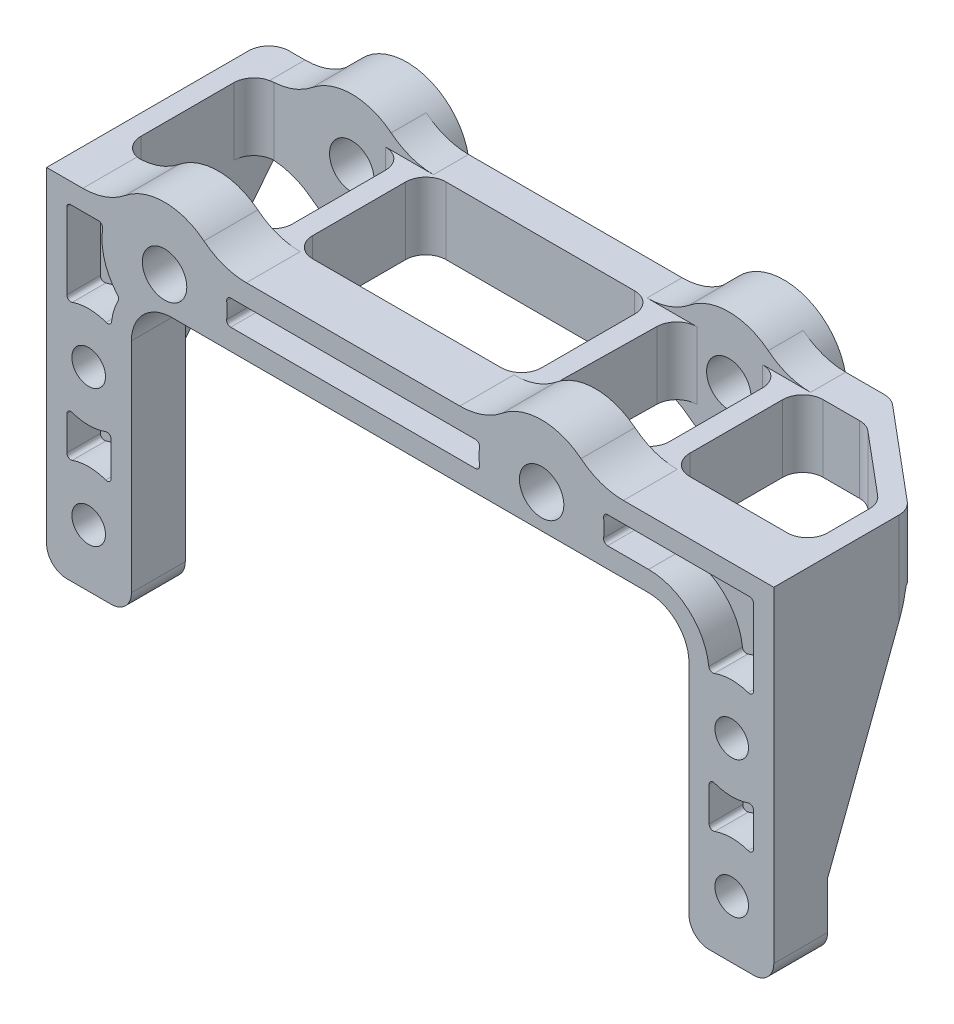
ISO-10303-21;
HEADER;
FILE_DESCRIPTION(('STEP AP214'),'2;1');
FILE_NAME('part.step','',(''),(''),'','','');
FILE_SCHEMA(('AUTOMOTIVE_DESIGN { 1 0 10303 214 1 1 1 1 }'));
ENDSEC;
DATA;
#1=APPLICATION_CONTEXT('core data for automotive mechanical design processes');
#2=APPLICATION_PROTOCOL_DEFINITION('international standard','automotive_design',2000,#1);
#3=PRODUCT_CONTEXT('',#1,'mechanical');
#4=PRODUCT('Part','Part','',(#3));
#5=PRODUCT_RELATED_PRODUCT_CATEGORY('part','',(#4));
#6=PRODUCT_DEFINITION_FORMATION('','',#4);
#7=PRODUCT_DEFINITION_CONTEXT('part definition',#1,'design');
#8=PRODUCT_DEFINITION('design','',#6,#7);
#9=PRODUCT_DEFINITION_SHAPE('','',#8);
#10=(LENGTH_UNIT() NAMED_UNIT(*) SI_UNIT(.MILLI.,.METRE.));
#11=(NAMED_UNIT(*) PLANE_ANGLE_UNIT() SI_UNIT($,.RADIAN.));
#12=(NAMED_UNIT(*) SI_UNIT($,.STERADIAN.) SOLID_ANGLE_UNIT());
#13=UNCERTAINTY_MEASURE_WITH_UNIT(LENGTH_MEASURE(1.E-05),#10,'distance_accuracy_value','');
#14=(GEOMETRIC_REPRESENTATION_CONTEXT(3) GLOBAL_UNCERTAINTY_ASSIGNED_CONTEXT((#13)) GLOBAL_UNIT_ASSIGNED_CONTEXT((#10,
#11,#12)) REPRESENTATION_CONTEXT('',''));
#15=CARTESIAN_POINT('',(0.,0.,0.));
#16=DIRECTION('',(0.,0.,1.));
#17=DIRECTION('',(1.,0.,0.));
#18=AXIS2_PLACEMENT_3D('',#15,#16,#17);
#19=CARTESIAN_POINT('',(-74.,11.35,-8.25));
#20=DIRECTION('',(0.,1.,0.));
#21=DIRECTION('',(0.,0.,1.));
#22=AXIS2_PLACEMENT_3D('',#19,#20,#21);
#23=PLANE('',#22);
#24=DIRECTION('',(0.,0.,1.));
#25=VECTOR('',#24,1.);
#26=CARTESIAN_POINT('',(-99.5,11.35,-8.25));
#27=LINE('',#26,#25);
#28=CARTESIAN_POINT('',(-99.5,11.35,-5.50000000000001));
#29=VERTEX_POINT('',#28);
#30=CARTESIAN_POINT('',(-99.5,11.35,-4.));
#31=VERTEX_POINT('',#30);
#32=EDGE_CURVE('E523',#29,#31,#27,.T.);
#33=ORIENTED_EDGE('',*,*,#32,.F.);
#34=CARTESIAN_POINT('',(-98.,11.35,-5.50000000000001));
#35=DIRECTION('',(0.,-1.,0.));
#36=DIRECTION('',(0.,0.,-1.));
#37=AXIS2_PLACEMENT_3D('',#34,#35,#36);
#38=CIRCLE('',#37,1.5);
#39=CARTESIAN_POINT('',(-98.,11.35,-4.));
#40=VERTEX_POINT('',#39);
#41=EDGE_CURVE('E2358',#29,#40,#38,.F.);
#42=ORIENTED_EDGE('',*,*,#41,.T.);
#43=DIRECTION('',(1.,0.,0.));
#44=VECTOR('',#43,1.);
#45=CARTESIAN_POINT('',(-74.,11.35,-4.));
#46=LINE('',#45,#44);
#47=EDGE_CURVE('E518',#31,#40,#46,.T.);
#48=ORIENTED_EDGE('',*,*,#47,.F.);
#49=EDGE_LOOP('',(#33,#42,#48));
#50=FACE_BOUND('',#49,.T.);
#51=ADVANCED_FACE('F17',(#50),#23,.F.);
#52=CARTESIAN_POINT('',(-74.,11.35,-8.25));
#53=DIRECTION('',(0.,1.,0.));
#54=DIRECTION('',(0.,0.,1.));
#55=AXIS2_PLACEMENT_3D('',#52,#53,#54);
#56=PLANE('',#55);
#57=DIRECTION('',(0.,0.,1.));
#58=VECTOR('',#57,1.);
#59=CARTESIAN_POINT('',(-48.5,11.35,-8.25));
#60=LINE('',#59,#58);
#61=CARTESIAN_POINT('',(-48.5,11.35,-4.));
#62=VERTEX_POINT('',#61);
#63=CARTESIAN_POINT('',(-48.5,11.35,-5.5));
#64=VERTEX_POINT('',#63);
#65=EDGE_CURVE('E494',#62,#64,#60,.F.);
#66=ORIENTED_EDGE('',*,*,#65,.F.);
#67=DIRECTION('',(1.,0.,0.));
#68=VECTOR('',#67,1.);
#69=CARTESIAN_POINT('',(-74.,11.35,-3.99999999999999));
#70=LINE('',#69,#68);
#71=CARTESIAN_POINT('',(-50.,11.35,-3.99999999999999));
#72=VERTEX_POINT('',#71);
#73=EDGE_CURVE('E513',#72,#62,#70,.T.);
#74=ORIENTED_EDGE('',*,*,#73,.F.);
#75=CARTESIAN_POINT('',(-50.,11.35,-5.5));
#76=DIRECTION('',(0.,-1.,0.));
#77=DIRECTION('',(0.,0.,-1.));
#78=AXIS2_PLACEMENT_3D('',#75,#76,#77);
#79=CIRCLE('',#78,1.5);
#80=EDGE_CURVE('E2355',#72,#64,#79,.F.);
#81=ORIENTED_EDGE('',*,*,#80,.T.);
#82=EDGE_LOOP('',(#66,#74,#81));
#83=FACE_BOUND('',#82,.T.);
#84=ADVANCED_FACE('F1107',(#83),#56,.F.);
#85=CARTESIAN_POINT('',(-64.24,13.85,-18.));
#86=DIRECTION('',(0.,0.,-1.));
#87=DIRECTION('',(-1.,0.,0.));
#88=AXIS2_PLACEMENT_3D('',#85,#86,#87);
#89=PLANE('',#88);
#90=CARTESIAN_POINT('',(-64.24,13.85,-18.));
#91=DIRECTION('',(0.,0.,-1.));
#92=DIRECTION('',(-1.,0.,0.));
#93=AXIS2_PLACEMENT_3D('',#90,#91,#92);
#94=CIRCLE('',#93,1.64999999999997);
#95=CARTESIAN_POINT('',(-65.89,13.85,-18.));
#96=VERTEX_POINT('',#95);
#97=EDGE_CURVE('E3412',#96,#96,#94,.F.);
#98=ORIENTED_EDGE('',*,*,#97,.T.);
#99=EDGE_LOOP('',(#98));
#100=FACE_BOUND('',#99,.T.);
#101=CARTESIAN_POINT('',(-64.24,13.85,-18.));
#102=DIRECTION('',(0.,0.,-1.));
#103=DIRECTION('',(-1.,0.,0.));
#104=AXIS2_PLACEMENT_3D('',#101,#102,#103);
#105=CIRCLE('',#104,4.64999999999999);
#106=CARTESIAN_POINT('',(-68.89,13.85,-18.));
#107=VERTEX_POINT('',#106);
#108=EDGE_CURVE('E1061',#107,#107,#105,.F.);
#109=ORIENTED_EDGE('',*,*,#108,.F.);
#110=EDGE_LOOP('',(#109));
#111=FACE_BOUND('',#110,.T.);
#112=ADVANCED_FACE('F1104',(#100,#111),#89,.T.);
#113=CARTESIAN_POINT('',(-92.24,13.85,-18.));
#114=DIRECTION('',(0.,0.,-1.));
#115=DIRECTION('',(-1.,0.,0.));
#116=AXIS2_PLACEMENT_3D('',#113,#114,#115);
#117=PLANE('',#116);
#118=CARTESIAN_POINT('',(-92.24,13.85,-18.));
#119=DIRECTION('',(0.,0.,1.));
#120=DIRECTION('',(1.,0.,0.));
#121=AXIS2_PLACEMENT_3D('',#118,#119,#120);
#122=CIRCLE('',#121,1.64999999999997);
#123=CARTESIAN_POINT('',(-90.5900000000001,13.85,-18.));
#124=VERTEX_POINT('',#123);
#125=EDGE_CURVE('E1051',#124,#124,#122,.T.);
#126=ORIENTED_EDGE('',*,*,#125,.T.);
#127=EDGE_LOOP('',(#126));
#128=FACE_BOUND('',#127,.T.);
#129=CARTESIAN_POINT('',(-92.24,13.85,-18.));
#130=DIRECTION('',(0.,0.,-1.));
#131=DIRECTION('',(-1.,0.,0.));
#132=AXIS2_PLACEMENT_3D('',#129,#130,#131);
#133=CIRCLE('',#132,4.64999999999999);
#134=CARTESIAN_POINT('',(-96.89,13.85,-18.));
#135=VERTEX_POINT('',#134);
#136=EDGE_CURVE('E1042',#135,#135,#133,.F.);
#137=ORIENTED_EDGE('',*,*,#136,.F.);
#138=EDGE_LOOP('',(#137));
#139=FACE_BOUND('',#138,.T.);
#140=ADVANCED_FACE('F1101',(#128,#139),#117,.T.);
#141=CARTESIAN_POINT('',(-64.24,13.85,-2.5));
#142=DIRECTION('',(0.,0.,1.));
#143=DIRECTION('',(1.,0.,0.));
#144=AXIS2_PLACEMENT_3D('',#141,#142,#143);
#145=CYLINDRICAL_SURFACE('',#144,4.64999999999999);
#146=CARTESIAN_POINT('',(-64.24,13.85,-2.5));
#147=DIRECTION('',(0.,0.,1.));
#148=DIRECTION('',(1.,0.,0.));
#149=AXIS2_PLACEMENT_3D('',#146,#147,#148);
#150=CIRCLE('',#149,4.64999999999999);
#151=CARTESIAN_POINT('',(-68.8515380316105,14.4468391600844,-2.5));
#152=VERTEX_POINT('',#151);
#153=CARTESIAN_POINT('',(-68.851088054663,13.2496942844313,-2.5));
#154=VERTEX_POINT('',#153);
#155=EDGE_CURVE('E493',#152,#154,#150,.T.);
#156=ORIENTED_EDGE('',*,*,#155,.T.);
#157=DIRECTION('',(0.,0.,1.));
#158=VECTOR('',#157,1.);
#159=CARTESIAN_POINT('',(-68.851088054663,13.2496942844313,-2.5));
#160=LINE('',#159,#158);
#161=CARTESIAN_POINT('',(-68.851088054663,13.2496942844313,0.));
#162=VERTEX_POINT('',#161);
#163=EDGE_CURVE('E492',#154,#162,#160,.T.);
#164=ORIENTED_EDGE('',*,*,#163,.T.);
#165=CARTESIAN_POINT('',(-64.24,13.85,0.));
#166=DIRECTION('',(0.,0.,1.));
#167=DIRECTION('',(1.,0.,0.));
#168=AXIS2_PLACEMENT_3D('',#165,#166,#167);
#169=CIRCLE('',#168,4.64999999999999);
#170=CARTESIAN_POINT('',(-68.8515380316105,14.4468391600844,0.));
#171=VERTEX_POINT('',#170);
#172=EDGE_CURVE('E20',#162,#171,#169,.F.);
#173=ORIENTED_EDGE('',*,*,#172,.T.);
#174=DIRECTION('',(0.,0.,1.));
#175=VECTOR('',#174,1.);
#176=CARTESIAN_POINT('',(-68.8515380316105,14.4468391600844,-2.5));
#177=LINE('',#176,#175);
#178=EDGE_CURVE('E491',#171,#152,#177,.F.);
#179=ORIENTED_EDGE('',*,*,#178,.T.);
#180=EDGE_LOOP('',(#156,#164,#173,#179));
#181=FACE_BOUND('',#180,.T.);
#182=ADVANCED_FACE('F490',(#181),#145,.T.);
#183=CARTESIAN_POINT('',(-64.24,13.85,-2.5));
#184=DIRECTION('',(0.,0.,1.));
#185=DIRECTION('',(1.,0.,0.));
#186=AXIS2_PLACEMENT_3D('',#183,#184,#185);
#187=CYLINDRICAL_SURFACE('',#186,4.64999999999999);
#188=CARTESIAN_POINT('',(-64.24,13.85,0.));
#189=DIRECTION('',(0.,0.,1.));
#190=DIRECTION('',(1.,0.,0.));
#191=AXIS2_PLACEMENT_3D('',#188,#189,#190);
#192=CIRCLE('',#191,4.64999999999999);
#193=CARTESIAN_POINT('',(-59.6367300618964,14.5075757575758,0.));
#194=VERTEX_POINT('',#193);
#195=CARTESIAN_POINT('',(-59.6367300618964,13.1924242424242,0.));
#196=VERTEX_POINT('',#195);
#197=EDGE_CURVE('E1591',#194,#196,#192,.F.);
#198=ORIENTED_EDGE('',*,*,#197,.T.);
#199=DIRECTION('',(0.,0.,1.));
#200=VECTOR('',#199,1.);
#201=CARTESIAN_POINT('',(-59.6367300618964,13.1924242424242,-2.5));
#202=LINE('',#201,#200);
#203=CARTESIAN_POINT('',(-59.6367300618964,13.1924242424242,-2.5));
#204=VERTEX_POINT('',#203);
#205=EDGE_CURVE('E1029',#196,#204,#202,.F.);
#206=ORIENTED_EDGE('',*,*,#205,.T.);
#207=CARTESIAN_POINT('',(-64.24,13.85,-2.5));
#208=DIRECTION('',(0.,0.,1.));
#209=DIRECTION('',(1.,0.,0.));
#210=AXIS2_PLACEMENT_3D('',#207,#208,#209);
#211=CIRCLE('',#210,4.64999999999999);
#212=CARTESIAN_POINT('',(-59.6367300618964,14.5075757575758,-2.5));
#213=VERTEX_POINT('',#212);
#214=EDGE_CURVE('E1589',#204,#213,#211,.T.);
#215=ORIENTED_EDGE('',*,*,#214,.T.);
#216=DIRECTION('',(0.,0.,1.));
#217=VECTOR('',#216,1.);
#218=CARTESIAN_POINT('',(-59.6367300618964,14.5075757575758,-2.5));
#219=LINE('',#218,#217);
#220=EDGE_CURVE('E499',#213,#194,#219,.T.);
#221=ORIENTED_EDGE('',*,*,#220,.T.);
#222=EDGE_LOOP('',(#198,#206,#215,#221));
#223=FACE_BOUND('',#222,.T.);
#224=ADVANCED_FACE('F1094',(#223),#187,.T.);
#225=CARTESIAN_POINT('',(-91.6999999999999,8.35000000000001,-2.5));
#226=DIRECTION('',(0.,0.,1.));
#227=DIRECTION('',(1.,0.,0.));
#228=AXIS2_PLACEMENT_3D('',#225,#226,#227);
#229=CYLINDRICAL_SURFACE('',#228,4.5);
#230=CARTESIAN_POINT('',(-91.6999999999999,8.35000000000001,-2.5));
#231=DIRECTION('',(0.,0.,1.));
#232=DIRECTION('',(1.,0.,0.));
#233=AXIS2_PLACEMENT_3D('',#230,#231,#232);
#234=CIRCLE('',#233,4.5);
#235=CARTESIAN_POINT('',(-95.6868356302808,10.4368976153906,-2.5));
#236=VERTEX_POINT('',#235);
#237=CARTESIAN_POINT('',(-96.1726117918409,8.84572548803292,-2.5));
#238=VERTEX_POINT('',#237);
#239=EDGE_CURVE('E2345',#236,#238,#234,.T.);
#240=ORIENTED_EDGE('',*,*,#239,.T.);
#241=DIRECTION('',(0.,0.,-1.));
#242=VECTOR('',#241,1.);
#243=CARTESIAN_POINT('',(-96.1726117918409,8.84572548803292,-2.5));
#244=LINE('',#243,#242);
#245=CARTESIAN_POINT('',(-96.1726117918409,8.84572548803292,0.));
#246=VERTEX_POINT('',#245);
#247=EDGE_CURVE('E1009',#238,#246,#244,.F.);
#248=ORIENTED_EDGE('',*,*,#247,.T.);
#249=CARTESIAN_POINT('',(-91.6999999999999,8.35000000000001,0.));
#250=DIRECTION('',(0.,0.,1.));
#251=DIRECTION('',(1.,0.,0.));
#252=AXIS2_PLACEMENT_3D('',#249,#250,#251);
#253=CIRCLE('',#252,4.5);
#254=CARTESIAN_POINT('',(-95.6868356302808,10.4368976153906,0.));
#255=VERTEX_POINT('',#254);
#256=EDGE_CURVE('E2204',#246,#255,#253,.F.);
#257=ORIENTED_EDGE('',*,*,#256,.T.);
#258=DIRECTION('',(0.,0.,-1.));
#259=VECTOR('',#258,1.);
#260=CARTESIAN_POINT('',(-95.6868356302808,10.4368976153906,-2.5));
#261=LINE('',#260,#259);
#262=EDGE_CURVE('E1012',#255,#236,#261,.T.);
#263=ORIENTED_EDGE('',*,*,#262,.T.);
#264=EDGE_LOOP('',(#240,#248,#257,#263));
#265=FACE_BOUND('',#264,.T.);
#266=ADVANCED_FACE('F1090',(#265),#229,.T.);
#267=CARTESIAN_POINT('',(-55.2923537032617,11.35,-15.));
#268=DIRECTION('',(0.,-1.,0.));
#269=DIRECTION('',(0.,0.,-1.));
#270=AXIS2_PLACEMENT_3D('',#267,#268,#269);
#271=CYLINDRICAL_SURFACE('',#270,1.5);
#272=CARTESIAN_POINT('',(-55.2923537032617,11.35,-15.));
#273=DIRECTION('',(0.,-1.,0.));
#274=DIRECTION('',(0.,0.,-1.));
#275=AXIS2_PLACEMENT_3D('',#272,#273,#274);
#276=CIRCLE('',#275,1.5);
#277=CARTESIAN_POINT('',(-54.3281722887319,11.35,-16.1490666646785));
#278=VERTEX_POINT('',#277);
#279=CARTESIAN_POINT('',(-55.2923537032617,11.35,-16.5));
#280=VERTEX_POINT('',#279);
#281=EDGE_CURVE('E2343',#278,#280,#276,.F.);
#282=ORIENTED_EDGE('',*,*,#281,.T.);
#283=DIRECTION('',(0.,1.,0.));
#284=VECTOR('',#283,1.);
#285=CARTESIAN_POINT('',(-55.2923537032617,11.35,-16.5));
#286=LINE('',#285,#284);
#287=CARTESIAN_POINT('',(-55.2923537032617,16.35,-16.5));
#288=VERTEX_POINT('',#287);
#289=EDGE_CURVE('E975',#288,#280,#286,.F.);
#290=ORIENTED_EDGE('',*,*,#289,.F.);
#291=CARTESIAN_POINT('',(-55.2923537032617,16.35,-15.));
#292=DIRECTION('',(0.,-1.,0.));
#293=DIRECTION('',(0.,0.,-1.));
#294=AXIS2_PLACEMENT_3D('',#291,#292,#293);
#295=CIRCLE('',#294,1.5);
#296=CARTESIAN_POINT('',(-54.3281722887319,16.35,-16.1490666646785));
#297=VERTEX_POINT('',#296);
#298=EDGE_CURVE('E2337',#288,#297,#295,.T.);
#299=ORIENTED_EDGE('',*,*,#298,.T.);
#300=DIRECTION('',(0.,1.,0.));
#301=VECTOR('',#300,1.);
#302=CARTESIAN_POINT('',(-54.3281722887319,11.35,-16.1490666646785));
#303=LINE('',#302,#301);
#304=EDGE_CURVE('E981',#278,#297,#303,.T.);
#305=ORIENTED_EDGE('',*,*,#304,.F.);
#306=EDGE_LOOP('',(#282,#290,#299,#305));
#307=FACE_BOUND('',#306,.T.);
#308=ADVANCED_FACE('F1086',(#307),#271,.T.);
#309=CARTESIAN_POINT('',(-54.5273801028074,11.35,-12.4));
#310=DIRECTION('',(0.,-1.,0.));
#311=DIRECTION('',(0.,0.,-1.));
#312=AXIS2_PLACEMENT_3D('',#309,#310,#311);
#313=CYLINDRICAL_SURFACE('',#312,1.5);
#314=DIRECTION('',(0.,1.,0.));
#315=VECTOR('',#314,1.);
#316=CARTESIAN_POINT('',(-53.5631986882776,11.35,-13.5490666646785));
#317=LINE('',#316,#315);
#318=CARTESIAN_POINT('',(-53.5631986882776,11.35,-13.5490666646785));
#319=VERTEX_POINT('',#318);
#320=CARTESIAN_POINT('',(-53.5631986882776,16.35,-13.5490666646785));
#321=VERTEX_POINT('',#320);
#322=EDGE_CURVE('E1402',#319,#321,#317,.T.);
#323=ORIENTED_EDGE('',*,*,#322,.T.);
#324=CARTESIAN_POINT('',(-54.5273801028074,16.35,-12.4));
#325=DIRECTION('',(0.,-1.,0.));
#326=DIRECTION('',(0.,0.,-1.));
#327=AXIS2_PLACEMENT_3D('',#324,#325,#326);
#328=CIRCLE('',#327,1.5);
#329=CARTESIAN_POINT('',(-54.5273801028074,16.35,-13.9));
#330=VERTEX_POINT('',#329);
#331=EDGE_CURVE('E2347',#330,#321,#328,.T.);
#332=ORIENTED_EDGE('',*,*,#331,.F.);
#333=DIRECTION('',(0.,1.,0.));
#334=VECTOR('',#333,1.);
#335=CARTESIAN_POINT('',(-54.5273801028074,11.35,-13.9));
#336=LINE('',#335,#334);
#337=CARTESIAN_POINT('',(-54.5273801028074,11.35,-13.9));
#338=VERTEX_POINT('',#337);
#339=EDGE_CURVE('E1411',#330,#338,#336,.F.);
#340=ORIENTED_EDGE('',*,*,#339,.T.);
#341=CARTESIAN_POINT('',(-54.5273801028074,11.35,-12.4));
#342=DIRECTION('',(0.,-1.,0.));
#343=DIRECTION('',(0.,0.,-1.));
#344=AXIS2_PLACEMENT_3D('',#341,#342,#343);
#345=CIRCLE('',#344,1.5);
#346=EDGE_CURVE('E3418',#319,#338,#345,.F.);
#347=ORIENTED_EDGE('',*,*,#346,.F.);
#348=EDGE_LOOP('',(#323,#332,#340,#347));
#349=FACE_BOUND('',#348,.T.);
#350=ADVANCED_FACE('F1082',(#349),#313,.F.);
#351=CARTESIAN_POINT('',(-50.,11.35,-8.601077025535));
#352=DIRECTION('',(0.,-1.,0.));
#353=DIRECTION('',(0.,0.,-1.));
#354=AXIS2_PLACEMENT_3D('',#351,#352,#353);
#355=CYLINDRICAL_SURFACE('',#354,1.5);
#356=DIRECTION('',(0.,1.,0.));
#357=VECTOR('',#356,1.);
#358=CARTESIAN_POINT('',(-48.5,11.35,-8.601077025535));
#359=LINE('',#358,#357);
#360=CARTESIAN_POINT('',(-48.5,11.35,-8.601077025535));
#361=VERTEX_POINT('',#360);
#362=CARTESIAN_POINT('',(-48.5,16.35,-8.601077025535));
#363=VERTEX_POINT('',#362);
#364=EDGE_CURVE('E1396',#361,#363,#359,.T.);
#365=ORIENTED_EDGE('',*,*,#364,.T.);
#366=CARTESIAN_POINT('',(-50.,16.35,-8.601077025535));
#367=DIRECTION('',(0.,-1.,0.));
#368=DIRECTION('',(0.,0.,-1.));
#369=AXIS2_PLACEMENT_3D('',#366,#367,#368);
#370=CIRCLE('',#369,1.5);
#371=CARTESIAN_POINT('',(-49.0358185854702,16.35,-9.75014369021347));
#372=VERTEX_POINT('',#371);
#373=EDGE_CURVE('E3408',#372,#363,#370,.T.);
#374=ORIENTED_EDGE('',*,*,#373,.F.);
#375=DIRECTION('',(0.,1.,0.));
#376=VECTOR('',#375,1.);
#377=CARTESIAN_POINT('',(-49.0358185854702,11.35,-9.75014369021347));
#378=LINE('',#377,#376);
#379=CARTESIAN_POINT('',(-49.0358185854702,11.35,-9.75014369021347));
#380=VERTEX_POINT('',#379);
#381=EDGE_CURVE('E1405',#372,#380,#378,.F.);
#382=ORIENTED_EDGE('',*,*,#381,.T.);
#383=CARTESIAN_POINT('',(-50.,11.35,-8.601077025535));
#384=DIRECTION('',(0.,-1.,0.));
#385=DIRECTION('',(0.,0.,-1.));
#386=AXIS2_PLACEMENT_3D('',#383,#384,#385);
#387=CIRCLE('',#386,1.5);
#388=EDGE_CURVE('E3410',#361,#380,#387,.F.);
#389=ORIENTED_EDGE('',*,*,#388,.F.);
#390=EDGE_LOOP('',(#365,#374,#382,#389));
#391=FACE_BOUND('',#390,.T.);
#392=ADVANCED_FACE('F1078',(#391),#355,.F.);
#393=CARTESIAN_POINT('',(-64.24,13.85,-16.5));
#394=DIRECTION('',(0.,0.,-1.));
#395=DIRECTION('',(-1.,0.,0.));
#396=AXIS2_PLACEMENT_3D('',#393,#394,#395);
#397=CYLINDRICAL_SURFACE('',#396,1.64999999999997);
#398=CARTESIAN_POINT('',(-64.24,13.85,-13.9));
#399=DIRECTION('',(0.,0.,-1.));
#400=DIRECTION('',(-1.,0.,0.));
#401=AXIS2_PLACEMENT_3D('',#398,#399,#400);
#402=CIRCLE('',#401,1.64999999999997);
#403=CARTESIAN_POINT('',(-65.89,13.85,-13.9));
#404=VERTEX_POINT('',#403);
#405=EDGE_CURVE('E968',#404,#404,#402,.F.);
#406=ORIENTED_EDGE('',*,*,#405,.T.);
#407=EDGE_LOOP('',(#406));
#408=FACE_BOUND('',#407,.T.);
#409=ORIENTED_EDGE('',*,*,#97,.F.);
#410=EDGE_LOOP('',(#409));
#411=FACE_BOUND('',#410,.T.);
#412=ADVANCED_FACE('F1074',(#408,#411),#397,.F.);
#413=CARTESIAN_POINT('',(-64.24,13.85,-0.747813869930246));
#414=DIRECTION('',(0.,0.,-1.));
#415=DIRECTION('',(-1.,0.,0.));
#416=AXIS2_PLACEMENT_3D('',#413,#414,#415);
#417=CYLINDRICAL_SURFACE('',#416,4.64999999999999);
#418=CARTESIAN_POINT('',(-64.24,13.85,-16.5));
#419=DIRECTION('',(0.,0.,-1.));
#420=DIRECTION('',(-1.,0.,0.));
#421=AXIS2_PLACEMENT_3D('',#418,#419,#420);
#422=CIRCLE('',#421,4.64999999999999);
#423=CARTESIAN_POINT('',(-61.3139824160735,10.2360103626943,-16.5));
#424=VERTEX_POINT('',#423);
#425=CARTESIAN_POINT('',(-61.3139824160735,17.4639896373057,-16.5));
#426=VERTEX_POINT('',#425);
#427=EDGE_CURVE('E976',#424,#426,#422,.F.);
#428=ORIENTED_EDGE('',*,*,#427,.F.);
#429=DIRECTION('',(0.,0.,-1.));
#430=VECTOR('',#429,1.);
#431=CARTESIAN_POINT('',(-61.3139824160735,10.2360103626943,-0.747813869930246));
#432=LINE('',#431,#430);
#433=CARTESIAN_POINT('',(-61.3139824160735,10.2360103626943,-13.9));
#434=VERTEX_POINT('',#433);
#435=EDGE_CURVE('E988',#424,#434,#432,.F.);
#436=ORIENTED_EDGE('',*,*,#435,.T.);
#437=CARTESIAN_POINT('',(-64.24,13.85,-13.9));
#438=DIRECTION('',(0.,0.,-1.));
#439=DIRECTION('',(-1.,0.,0.));
#440=AXIS2_PLACEMENT_3D('',#437,#438,#439);
#441=CIRCLE('',#440,4.64999999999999);
#442=CARTESIAN_POINT('',(-67.1660175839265,10.2360103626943,-13.9));
#443=VERTEX_POINT('',#442);
#444=EDGE_CURVE('E958',#434,#443,#441,.T.);
#445=ORIENTED_EDGE('',*,*,#444,.T.);
#446=DIRECTION('',(0.,0.,-1.));
#447=VECTOR('',#446,1.);
#448=CARTESIAN_POINT('',(-67.1660175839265,10.2360103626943,-0.747813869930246));
#449=LINE('',#448,#447);
#450=CARTESIAN_POINT('',(-67.1660175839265,10.2360103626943,-16.5));
#451=VERTEX_POINT('',#450);
#452=EDGE_CURVE('E1576',#443,#451,#449,.T.);
#453=ORIENTED_EDGE('',*,*,#452,.T.);
#454=CARTESIAN_POINT('',(-64.24,13.85,-16.5));
#455=DIRECTION('',(0.,0.,-1.));
#456=DIRECTION('',(-1.,0.,0.));
#457=AXIS2_PLACEMENT_3D('',#454,#455,#456);
#458=CIRCLE('',#457,4.64999999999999);
#459=CARTESIAN_POINT('',(-67.1660175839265,17.4639896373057,-16.5));
#460=VERTEX_POINT('',#459);
#461=EDGE_CURVE('E941',#460,#451,#458,.F.);
#462=ORIENTED_EDGE('',*,*,#461,.F.);
#463=DIRECTION('',(0.,0.,-1.));
#464=VECTOR('',#463,1.);
#465=CARTESIAN_POINT('',(-67.1660175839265,17.4639896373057,-0.747813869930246));
#466=LINE('',#465,#464);
#467=CARTESIAN_POINT('',(-67.1660175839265,17.4639896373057,-13.9));
#468=VERTEX_POINT('',#467);
#469=EDGE_CURVE('E954',#460,#468,#466,.F.);
#470=ORIENTED_EDGE('',*,*,#469,.T.);
#471=CARTESIAN_POINT('',(-64.24,13.85,-13.9));
#472=DIRECTION('',(0.,0.,-1.));
#473=DIRECTION('',(-1.,0.,0.));
#474=AXIS2_PLACEMENT_3D('',#471,#472,#473);
#475=CIRCLE('',#474,4.64999999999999);
#476=CARTESIAN_POINT('',(-61.3139824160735,17.4639896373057,-13.9));
#477=VERTEX_POINT('',#476);
#478=EDGE_CURVE('E966',#468,#477,#475,.T.);
#479=ORIENTED_EDGE('',*,*,#478,.T.);
#480=DIRECTION('',(0.,0.,-1.));
#481=VECTOR('',#480,1.);
#482=CARTESIAN_POINT('',(-61.3139824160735,17.4639896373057,-0.747813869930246));
#483=LINE('',#482,#481);
#484=EDGE_CURVE('E974',#477,#426,#483,.T.);
#485=ORIENTED_EDGE('',*,*,#484,.T.);
#486=EDGE_LOOP('',(#428,#436,#445,#453,#462,#470,#479,#485));
#487=FACE_BOUND('',#486,.T.);
#488=ORIENTED_EDGE('',*,*,#108,.T.);
#489=EDGE_LOOP('',(#488));
#490=FACE_BOUND('',#489,.T.);
#491=ADVANCED_FACE('F1069',(#487,#490),#417,.T.);
#492=CARTESIAN_POINT('',(-98.3122730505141,6.35000000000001,-0.747813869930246));
#493=DIRECTION('',(0.,0.,-1.));
#494=DIRECTION('',(-1.,0.,0.));
#495=AXIS2_PLACEMENT_3D('',#492,#493,#494);
#496=CYLINDRICAL_SURFACE('',#495,5.);
#497=CARTESIAN_POINT('',(-98.3122730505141,6.35000000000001,-13.9));
#498=DIRECTION('',(0.,0.,-1.));
#499=DIRECTION('',(-1.,0.,0.));
#500=AXIS2_PLACEMENT_3D('',#497,#498,#499);
#501=CIRCLE('',#500,5.);
#502=CARTESIAN_POINT('',(-95.1660175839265,10.2360103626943,-13.9));
#503=VERTEX_POINT('',#502);
#504=CARTESIAN_POINT('',(-98.,11.340239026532,-13.9));
#505=VERTEX_POINT('',#504);
#506=EDGE_CURVE('E928',#503,#505,#501,.F.);
#507=ORIENTED_EDGE('',*,*,#506,.T.);
#508=CARTESIAN_POINT('',(-98.3122730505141,11.35,-13.8671351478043));
#509=CARTESIAN_POINT('',(-98.2607515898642,11.3500175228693,-13.878080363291));
#510=CARTESIAN_POINT('',(-98.2089681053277,11.3492128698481,-13.8862917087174));
#511=CARTESIAN_POINT('',(-98.1048770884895,11.3459592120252,-13.8972466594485));
#512=CARTESIAN_POINT('',(-98.0525695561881,11.3435102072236,-13.899990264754));
#513=CARTESIAN_POINT('',(-98.,11.340239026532,-13.9));
#514=B_SPLINE_CURVE_WITH_KNOTS('',3,(#508,#509,#510,#511,#512,#513),.UNSPECIFIED.,.F.,.F.,(4,2,
4),(0.,0.157309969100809,0.314619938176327),.UNSPECIFIED.);
#515=CARTESIAN_POINT('',(-98.3122730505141,11.35,-13.8671351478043));
#516=VERTEX_POINT('',#515);
#517=EDGE_CURVE('E1055',#516,#505,#514,.T.);
#518=ORIENTED_EDGE('',*,*,#517,.F.);
#519=DIRECTION('',(0.,0.,-1.));
#520=VECTOR('',#519,1.);
#521=CARTESIAN_POINT('',(-98.3122730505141,11.35,16.4));
#522=LINE('',#521,#520);
#523=CARTESIAN_POINT('',(-98.3122730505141,11.35,-16.5));
#524=VERTEX_POINT('',#523);
#525=EDGE_CURVE('E1050',#524,#516,#522,.F.);
#526=ORIENTED_EDGE('',*,*,#525,.F.);
#527=CARTESIAN_POINT('',(-98.3122730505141,6.35000000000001,-16.5));
#528=DIRECTION('',(0.,0.,-1.));
#529=DIRECTION('',(-1.,0.,0.));
#530=AXIS2_PLACEMENT_3D('',#527,#528,#529);
#531=CIRCLE('',#530,5.);
#532=CARTESIAN_POINT('',(-95.1660175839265,10.2360103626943,-16.5));
#533=VERTEX_POINT('',#532);
#534=EDGE_CURVE('E1046',#533,#524,#531,.F.);
#535=ORIENTED_EDGE('',*,*,#534,.F.);
#536=DIRECTION('',(0.,0.,-1.));
#537=VECTOR('',#536,1.);
#538=CARTESIAN_POINT('',(-95.1660175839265,10.2360103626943,-0.747813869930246));
#539=LINE('',#538,#537);
#540=EDGE_CURVE('E1054',#503,#533,#539,.T.);
#541=ORIENTED_EDGE('',*,*,#540,.F.);
#542=EDGE_LOOP('',(#507,#518,#526,#535,#541));
#543=FACE_BOUND('',#542,.T.);
#544=ADVANCED_FACE('F1063',(#543),#496,.F.);
#545=CARTESIAN_POINT('',(-92.24,13.85,-13.9));
#546=DIRECTION('',(0.,0.,1.));
#547=DIRECTION('',(1.,0.,0.));
#548=AXIS2_PLACEMENT_3D('',#545,#546,#547);
#549=CYLINDRICAL_SURFACE('',#548,1.64999999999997);
#550=ORIENTED_EDGE('',*,*,#125,.F.);
#551=EDGE_LOOP('',(#550));
#552=FACE_BOUND('',#551,.T.);
#553=CARTESIAN_POINT('',(-92.24,13.85,-13.9));
#554=DIRECTION('',(0.,0.,1.));
#555=DIRECTION('',(1.,0.,0.));
#556=AXIS2_PLACEMENT_3D('',#553,#554,#555);
#557=CIRCLE('',#556,1.64999999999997);
#558=CARTESIAN_POINT('',(-90.5900000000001,13.85,-13.9));
#559=VERTEX_POINT('',#558);
#560=EDGE_CURVE('E920',#559,#559,#557,.T.);
#561=ORIENTED_EDGE('',*,*,#560,.T.);
#562=EDGE_LOOP('',(#561));
#563=FACE_BOUND('',#562,.T.);
#564=ADVANCED_FACE('F1068',(#552,#563),#549,.F.);
#565=CARTESIAN_POINT('',(-101.,11.35,16.4));
#566=DIRECTION('',(0.,-1.,0.));
#567=DIRECTION('',(0.,0.,-1.));
#568=AXIS2_PLACEMENT_3D('',#565,#566,#567);
#569=PLANE('',#568);
#570=DIRECTION('',(0.,0.,1.));
#571=VECTOR('',#570,1.);
#572=CARTESIAN_POINT('',(-99.5,11.35,-12.4));
#573=LINE('',#572,#571);
#574=CARTESIAN_POINT('',(-99.5,11.35,-12.4));
#575=VERTEX_POINT('',#574);
#576=CARTESIAN_POINT('',(-99.5,11.3500000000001,-16.5));
#577=VERTEX_POINT('',#576);
#578=EDGE_CURVE('E918',#575,#577,#573,.F.);
#579=ORIENTED_EDGE('',*,*,#578,.T.);
#580=DIRECTION('',(-1.,0.,0.));
#581=VECTOR('',#580,1.);
#582=CARTESIAN_POINT('',(-54.7463983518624,11.35,-16.5));
#583=LINE('',#582,#581);
#584=EDGE_CURVE('E1049',#524,#577,#583,.T.);
#585=ORIENTED_EDGE('',*,*,#584,.F.);
#586=ORIENTED_EDGE('',*,*,#525,.T.);
#587=CARTESIAN_POINT('',(-98.,11.35,-12.4));
#588=DIRECTION('',(0.,1.,0.));
#589=DIRECTION('',(0.,0.,1.));
#590=AXIS2_PLACEMENT_3D('',#587,#588,#589);
#591=CIRCLE('',#590,1.5);
#592=EDGE_CURVE('E912',#516,#575,#591,.T.);
#593=ORIENTED_EDGE('',*,*,#592,.T.);
#594=EDGE_LOOP('',(#579,#585,#586,#593));
#595=FACE_BOUND('',#594,.T.);
#596=ADVANCED_FACE('F2226',(#595),#569,.T.);
#597=CARTESIAN_POINT('',(-54.7463983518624,11.35,-16.5));
#598=DIRECTION('',(0.,0.,-1.));
#599=DIRECTION('',(-1.,0.,0.));
#600=AXIS2_PLACEMENT_3D('',#597,#598,#599);
#601=PLANE('',#600);
#602=DIRECTION('',(0.,1.,0.));
#603=VECTOR('',#602,1.);
#604=CARTESIAN_POINT('',(-99.5,-10.35,-16.5));
#605=LINE('',#604,#603);
#606=CARTESIAN_POINT('',(-99.5,16.35,-16.5));
#607=VERTEX_POINT('',#606);
#608=EDGE_CURVE('E919',#607,#577,#605,.F.);
#609=ORIENTED_EDGE('',*,*,#608,.F.);
#610=DIRECTION('',(-1.,0.,0.));
#611=VECTOR('',#610,1.);
#612=CARTESIAN_POINT('',(-54.7463983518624,16.35,-16.5));
#613=LINE('',#612,#611);
#614=CARTESIAN_POINT('',(-98.3122730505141,16.35,-16.5));
#615=VERTEX_POINT('',#614);
#616=EDGE_CURVE('E1045',#607,#615,#613,.F.);
#617=ORIENTED_EDGE('',*,*,#616,.T.);
#618=CARTESIAN_POINT('',(-98.3122730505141,21.35,-16.5));
#619=DIRECTION('',(0.,0.,-1.));
#620=DIRECTION('',(-1.,0.,0.));
#621=AXIS2_PLACEMENT_3D('',#618,#619,#620);
#622=CIRCLE('',#621,5.);
#623=CARTESIAN_POINT('',(-95.1660175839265,17.4639896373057,-16.5));
#624=VERTEX_POINT('',#623);
#625=EDGE_CURVE('E909',#615,#624,#622,.F.);
#626=ORIENTED_EDGE('',*,*,#625,.T.);
#627=CARTESIAN_POINT('',(-92.24,13.85,-16.5));
#628=DIRECTION('',(0.,0.,-1.));
#629=DIRECTION('',(-1.,0.,0.));
#630=AXIS2_PLACEMENT_3D('',#627,#628,#629);
#631=CIRCLE('',#630,4.64999999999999);
#632=EDGE_CURVE('E510',#533,#624,#631,.T.);
#633=ORIENTED_EDGE('',*,*,#632,.F.);
#634=ORIENTED_EDGE('',*,*,#534,.T.);
#635=ORIENTED_EDGE('',*,*,#584,.T.);
#636=EDGE_LOOP('',(#609,#617,#626,#633,#634,#635));
#637=FACE_BOUND('',#636,.T.);
#638=ADVANCED_FACE('F2223',(#637),#601,.T.);
#639=CARTESIAN_POINT('',(-92.24,13.85,-0.747813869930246));
#640=DIRECTION('',(0.,0.,-1.));
#641=DIRECTION('',(-1.,0.,0.));
#642=AXIS2_PLACEMENT_3D('',#639,#640,#641);
#643=CYLINDRICAL_SURFACE('',#642,4.64999999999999);
#644=ORIENTED_EDGE('',*,*,#136,.T.);
#645=EDGE_LOOP('',(#644));
#646=FACE_BOUND('',#645,.T.);
#647=CARTESIAN_POINT('',(-92.24,13.85,-13.9));
#648=DIRECTION('',(0.,0.,-1.));
#649=DIRECTION('',(-1.,0.,0.));
#650=AXIS2_PLACEMENT_3D('',#647,#648,#649);
#651=CIRCLE('',#650,4.64999999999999);
#652=CARTESIAN_POINT('',(-95.1660175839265,17.4639896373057,-13.9));
#653=VERTEX_POINT('',#652);
#654=CARTESIAN_POINT('',(-89.3139824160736,17.4639896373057,-13.9));
#655=VERTEX_POINT('',#654);
#656=EDGE_CURVE('E926',#653,#655,#651,.T.);
#657=ORIENTED_EDGE('',*,*,#656,.T.);
#658=DIRECTION('',(0.,0.,-1.));
#659=VECTOR('',#658,1.);
#660=CARTESIAN_POINT('',(-89.3139824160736,17.4639896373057,-0.747813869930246));
#661=LINE('',#660,#659);
#662=CARTESIAN_POINT('',(-89.3139824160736,17.4639896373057,-16.5));
#663=VERTEX_POINT('',#662);
#664=EDGE_CURVE('E936',#655,#663,#661,.T.);
#665=ORIENTED_EDGE('',*,*,#664,.T.);
#666=CARTESIAN_POINT('',(-92.24,13.85,-16.5));
#667=DIRECTION('',(0.,0.,-1.));
#668=DIRECTION('',(-1.,0.,0.));
#669=AXIS2_PLACEMENT_3D('',#666,#667,#668);
#670=CIRCLE('',#669,4.64999999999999);
#671=CARTESIAN_POINT('',(-89.3139824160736,10.2360103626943,-16.5));
#672=VERTEX_POINT('',#671);
#673=EDGE_CURVE('E947',#672,#663,#670,.F.);
#674=ORIENTED_EDGE('',*,*,#673,.F.);
#675=DIRECTION('',(0.,0.,-1.));
#676=VECTOR('',#675,1.);
#677=CARTESIAN_POINT('',(-89.3139824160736,10.2360103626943,-0.747813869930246));
#678=LINE('',#677,#676);
#679=CARTESIAN_POINT('',(-89.3139824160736,10.2360103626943,-13.9));
#680=VERTEX_POINT('',#679);
#681=EDGE_CURVE('E992',#672,#680,#678,.F.);
#682=ORIENTED_EDGE('',*,*,#681,.T.);
#683=CARTESIAN_POINT('',(-92.24,13.85,-13.9));
#684=DIRECTION('',(0.,0.,-1.));
#685=DIRECTION('',(-1.,0.,0.));
#686=AXIS2_PLACEMENT_3D('',#683,#684,#685);
#687=CIRCLE('',#686,4.64999999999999);
#688=EDGE_CURVE('E931',#680,#503,#687,.T.);
#689=ORIENTED_EDGE('',*,*,#688,.T.);
#690=ORIENTED_EDGE('',*,*,#540,.T.);
#691=ORIENTED_EDGE('',*,*,#632,.T.);
#692=DIRECTION('',(0.,0.,-1.));
#693=VECTOR('',#692,1.);
#694=CARTESIAN_POINT('',(-95.1660175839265,17.4639896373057,-0.747813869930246));
#695=LINE('',#694,#693);
#696=EDGE_CURVE('E908',#624,#653,#695,.F.);
#697=ORIENTED_EDGE('',*,*,#696,.T.);
#698=EDGE_LOOP('',(#657,#665,#674,#682,#689,#690,#691,#697));
#699=FACE_BOUND('',#698,.T.);
#700=ADVANCED_FACE('F2216',(#646,#699),#643,.T.);
#701=CARTESIAN_POINT('',(-92.24,13.85,-2.5));
#702=DIRECTION('',(0.,0.,1.));
#703=DIRECTION('',(1.,0.,0.));
#704=AXIS2_PLACEMENT_3D('',#701,#702,#703);
#705=CYLINDRICAL_SURFACE('',#704,4.64999999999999);
#706=DIRECTION('',(0.,0.,1.));
#707=VECTOR('',#706,1.);
#708=CARTESIAN_POINT('',(-87.6284619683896,14.4468391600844,-2.5));
#709=LINE('',#708,#707);
#710=CARTESIAN_POINT('',(-87.6284619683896,14.4468391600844,-2.5));
#711=VERTEX_POINT('',#710);
#712=CARTESIAN_POINT('',(-87.6284619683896,14.4468391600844,0.));
#713=VERTEX_POINT('',#712);
#714=EDGE_CURVE('E1560',#711,#713,#709,.T.);
#715=ORIENTED_EDGE('',*,*,#714,.T.);
#716=CARTESIAN_POINT('',(-92.24,13.85,0.));
#717=DIRECTION('',(0.,0.,1.));
#718=DIRECTION('',(1.,0.,0.));
#719=AXIS2_PLACEMENT_3D('',#716,#717,#718);
#720=CIRCLE('',#719,4.64999999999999);
#721=CARTESIAN_POINT('',(-87.6289119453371,13.2496942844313,0.));
#722=VERTEX_POINT('',#721);
#723=EDGE_CURVE('E500',#713,#722,#720,.F.);
#724=ORIENTED_EDGE('',*,*,#723,.T.);
#725=DIRECTION('',(0.,0.,1.));
#726=VECTOR('',#725,1.);
#727=CARTESIAN_POINT('',(-87.6289119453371,13.2496942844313,-2.5));
#728=LINE('',#727,#726);
#729=CARTESIAN_POINT('',(-87.6289119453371,13.2496942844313,-2.5));
#730=VERTEX_POINT('',#729);
#731=EDGE_CURVE('E1557',#722,#730,#728,.F.);
#732=ORIENTED_EDGE('',*,*,#731,.T.);
#733=CARTESIAN_POINT('',(-92.24,13.85,-2.5));
#734=DIRECTION('',(0.,0.,1.));
#735=DIRECTION('',(1.,0.,0.));
#736=AXIS2_PLACEMENT_3D('',#733,#734,#735);
#737=CIRCLE('',#736,4.64999999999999);
#738=EDGE_CURVE('E505',#730,#711,#737,.T.);
#739=ORIENTED_EDGE('',*,*,#738,.T.);
#740=EDGE_LOOP('',(#715,#724,#732,#739));
#741=FACE_BOUND('',#740,.T.);
#742=ADVANCED_FACE('F2209',(#741),#705,.T.);
#743=CARTESIAN_POINT('',(-59.3397449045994,14.55,-2.5));
#744=DIRECTION('',(0.,0.,1.));
#745=DIRECTION('',(1.,0.,0.));
#746=AXIS2_PLACEMENT_3D('',#743,#744,#745);
#747=CYLINDRICAL_SURFACE('',#746,0.299999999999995);
#748=DIRECTION('',(0.,0.,1.));
#749=VECTOR('',#748,1.);
#750=CARTESIAN_POINT('',(-59.3397449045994,14.85,-2.5));
#751=LINE('',#750,#749);
#752=CARTESIAN_POINT('',(-59.3397449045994,14.85,-2.5));
#753=VERTEX_POINT('',#752);
#754=CARTESIAN_POINT('',(-59.3397449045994,14.85,0.));
#755=VERTEX_POINT('',#754);
#756=EDGE_CURVE('E1275',#753,#755,#751,.T.);
#757=ORIENTED_EDGE('',*,*,#756,.T.);
#758=CARTESIAN_POINT('',(-59.3397449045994,14.55,0.));
#759=DIRECTION('',(0.,0.,1.));
#760=DIRECTION('',(1.,0.,0.));
#761=AXIS2_PLACEMENT_3D('',#758,#759,#760);
#762=CIRCLE('',#761,0.299999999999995);
#763=EDGE_CURVE('E503',#194,#755,#762,.F.);
#764=ORIENTED_EDGE('',*,*,#763,.F.);
#765=ORIENTED_EDGE('',*,*,#220,.F.);
#766=CARTESIAN_POINT('',(-59.3397449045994,14.55,-2.5));
#767=DIRECTION('',(0.,0.,1.));
#768=DIRECTION('',(1.,0.,0.));
#769=AXIS2_PLACEMENT_3D('',#766,#767,#768);
#770=CIRCLE('',#769,0.299999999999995);
#771=EDGE_CURVE('E1026',#753,#213,#770,.T.);
#772=ORIENTED_EDGE('',*,*,#771,.F.);
#773=EDGE_LOOP('',(#757,#764,#765,#772));
#774=FACE_BOUND('',#773,.T.);
#775=ADVANCED_FACE('F2207',(#774),#747,.F.);
#776=CARTESIAN_POINT('',(-48.8,14.55,-2.5));
#777=DIRECTION('',(0.,0.,-1.));
#778=DIRECTION('',(-1.,0.,0.));
#779=AXIS2_PLACEMENT_3D('',#776,#777,#778);
#780=CYLINDRICAL_SURFACE('',#779,0.299999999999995);
#781=DIRECTION('',(0.,0.,-1.));
#782=VECTOR('',#781,1.);
#783=CARTESIAN_POINT('',(-48.5,14.55,-2.5));
#784=LINE('',#783,#782);
#785=CARTESIAN_POINT('',(-48.5,14.55,-2.5));
#786=VERTEX_POINT('',#785);
#787=CARTESIAN_POINT('',(-48.5,14.55,0.));
#788=VERTEX_POINT('',#787);
#789=EDGE_CURVE('E1269',#786,#788,#784,.F.);
#790=ORIENTED_EDGE('',*,*,#789,.T.);
#791=CARTESIAN_POINT('',(-48.8,14.55,0.));
#792=DIRECTION('',(0.,0.,-1.));
#793=DIRECTION('',(-1.,0.,0.));
#794=AXIS2_PLACEMENT_3D('',#791,#792,#793);
#795=CIRCLE('',#794,0.299999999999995);
#796=CARTESIAN_POINT('',(-48.8,14.85,0.));
#797=VERTEX_POINT('',#796);
#798=EDGE_CURVE('E1036',#797,#788,#795,.T.);
#799=ORIENTED_EDGE('',*,*,#798,.F.);
#800=DIRECTION('',(0.,0.,1.));
#801=VECTOR('',#800,1.);
#802=CARTESIAN_POINT('',(-48.8,14.85,-2.5));
#803=LINE('',#802,#801);
#804=CARTESIAN_POINT('',(-48.8,14.85,-2.5));
#805=VERTEX_POINT('',#804);
#806=EDGE_CURVE('E1279',#797,#805,#803,.F.);
#807=ORIENTED_EDGE('',*,*,#806,.T.);
#808=CARTESIAN_POINT('',(-48.8,14.55,-2.5));
#809=DIRECTION('',(0.,0.,-1.));
#810=DIRECTION('',(-1.,0.,0.));
#811=AXIS2_PLACEMENT_3D('',#808,#809,#810);
#812=CIRCLE('',#811,0.299999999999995);
#813=EDGE_CURVE('E1015',#786,#805,#812,.F.);
#814=ORIENTED_EDGE('',*,*,#813,.F.);
#815=EDGE_LOOP('',(#790,#799,#807,#814));
#816=FACE_BOUND('',#815,.T.);
#817=ADVANCED_FACE('F2190',(#816),#780,.F.);
#818=CARTESIAN_POINT('',(-48.8,8.90712359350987,-2.5));
#819=DIRECTION('',(0.,0.,1.));
#820=DIRECTION('',(1.,0.,0.));
#821=AXIS2_PLACEMENT_3D('',#818,#819,#820);
#822=CYLINDRICAL_SURFACE('',#821,0.300000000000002);
#823=DIRECTION('',(0.,0.,-1.));
#824=VECTOR('',#823,1.);
#825=CARTESIAN_POINT('',(-48.5,8.90712359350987,-2.5));
#826=LINE('',#825,#824);
#827=CARTESIAN_POINT('',(-48.5,8.90712359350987,0.));
#828=VERTEX_POINT('',#827);
#829=CARTESIAN_POINT('',(-48.5,8.90712359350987,-2.5));
#830=VERTEX_POINT('',#829);
#831=EDGE_CURVE('E1273',#828,#830,#826,.T.);
#832=ORIENTED_EDGE('',*,*,#831,.T.);
#833=CARTESIAN_POINT('',(-48.8,8.90712359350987,-2.5));
#834=DIRECTION('',(0.,0.,1.));
#835=DIRECTION('',(1.,0.,0.));
#836=AXIS2_PLACEMENT_3D('',#833,#834,#835);
#837=CIRCLE('',#836,0.300000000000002);
#838=CARTESIAN_POINT('',(-48.8981481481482,8.62363295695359,-2.5));
#839=VERTEX_POINT('',#838);
#840=EDGE_CURVE('E1018',#839,#830,#837,.T.);
#841=ORIENTED_EDGE('',*,*,#840,.F.);
#842=DIRECTION('',(0.,0.,1.));
#843=VECTOR('',#842,1.);
#844=CARTESIAN_POINT('',(-48.8981481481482,8.62363295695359,-2.5));
#845=LINE('',#844,#843);
#846=CARTESIAN_POINT('',(-48.8981481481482,8.62363295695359,0.));
#847=VERTEX_POINT('',#846);
#848=EDGE_CURVE('E1262',#847,#839,#845,.F.);
#849=ORIENTED_EDGE('',*,*,#848,.F.);
#850=CARTESIAN_POINT('',(-48.8,8.90712359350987,0.));
#851=DIRECTION('',(0.,0.,1.));
#852=DIRECTION('',(1.,0.,0.));
#853=AXIS2_PLACEMENT_3D('',#850,#851,#852);
#854=CIRCLE('',#853,0.300000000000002);
#855=EDGE_CURVE('E1034',#828,#847,#854,.F.);
#856=ORIENTED_EDGE('',*,*,#855,.F.);
#857=EDGE_LOOP('',(#832,#841,#849,#856));
#858=FACE_BOUND('',#857,.T.);
#859=ADVANCED_FACE('F2199',(#858),#822,.F.);
#860=CARTESIAN_POINT('',(-51.529214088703,8.87877385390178,-2.5));
#861=DIRECTION('',(0.,0.,-1.));
#862=DIRECTION('',(-1.,0.,0.));
#863=AXIS2_PLACEMENT_3D('',#860,#861,#862);
#864=CYLINDRICAL_SURFACE('',#863,0.299999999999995);
#865=DIRECTION('',(0.,0.,1.));
#866=VECTOR('',#865,1.);
#867=CARTESIAN_POINT('',(-51.8273882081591,8.84572548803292,-2.5));
#868=LINE('',#867,#866);
#869=CARTESIAN_POINT('',(-51.8273882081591,8.84572548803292,0.));
#870=VERTEX_POINT('',#869);
#871=CARTESIAN_POINT('',(-51.8273882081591,8.84572548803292,-2.5));
#872=VERTEX_POINT('',#871);
#873=EDGE_CURVE('E1259',#870,#872,#868,.F.);
#874=ORIENTED_EDGE('',*,*,#873,.F.);
#875=CARTESIAN_POINT('',(-51.529214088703,8.87877385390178,0.));
#876=DIRECTION('',(0.,0.,-1.));
#877=DIRECTION('',(-1.,0.,0.));
#878=AXIS2_PLACEMENT_3D('',#875,#876,#877);
#879=CIRCLE('',#878,0.299999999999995);
#880=CARTESIAN_POINT('',(-51.4251982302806,8.59738319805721,0.));
#881=VERTEX_POINT('',#880);
#882=EDGE_CURVE('E1032',#881,#870,#879,.T.);
#883=ORIENTED_EDGE('',*,*,#882,.F.);
#884=DIRECTION('',(0.,0.,1.));
#885=VECTOR('',#884,1.);
#886=CARTESIAN_POINT('',(-51.4251982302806,8.59738319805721,-2.5));
#887=LINE('',#886,#885);
#888=CARTESIAN_POINT('',(-51.4251982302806,8.59738319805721,-2.5));
#889=VERTEX_POINT('',#888);
#890=EDGE_CURVE('E1263',#889,#881,#887,.T.);
#891=ORIENTED_EDGE('',*,*,#890,.F.);
#892=CARTESIAN_POINT('',(-51.529214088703,8.87877385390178,-2.5));
#893=DIRECTION('',(0.,0.,-1.));
#894=DIRECTION('',(-1.,0.,0.));
#895=AXIS2_PLACEMENT_3D('',#892,#893,#894);
#896=CIRCLE('',#895,0.299999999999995);
#897=EDGE_CURVE('E1021',#872,#889,#896,.F.);
#898=ORIENTED_EDGE('',*,*,#897,.F.);
#899=EDGE_LOOP('',(#874,#883,#891,#898));
#900=FACE_BOUND('',#899,.T.);
#901=ADVANCED_FACE('F2203',(#900),#864,.F.);
#902=CARTESIAN_POINT('',(-59.3397449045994,13.15,-2.5));
#903=DIRECTION('',(0.,0.,1.));
#904=DIRECTION('',(1.,0.,0.));
#905=AXIS2_PLACEMENT_3D('',#902,#903,#904);
#906=CYLINDRICAL_SURFACE('',#905,0.299999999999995);
#907=ORIENTED_EDGE('',*,*,#205,.F.);
#908=CARTESIAN_POINT('',(-59.3397449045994,13.15,0.));
#909=DIRECTION('',(0.,0.,1.));
#910=DIRECTION('',(1.,0.,0.));
#911=AXIS2_PLACEMENT_3D('',#908,#909,#910);
#912=CIRCLE('',#911,0.299999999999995);
#913=CARTESIAN_POINT('',(-59.3397449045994,12.85,0.));
#914=VERTEX_POINT('',#913);
#915=EDGE_CURVE('E1030',#914,#196,#912,.F.);
#916=ORIENTED_EDGE('',*,*,#915,.F.);
#917=DIRECTION('',(0.,0.,-1.));
#918=VECTOR('',#917,1.);
#919=CARTESIAN_POINT('',(-59.3397449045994,12.85,-2.5));
#920=LINE('',#919,#918);
#921=CARTESIAN_POINT('',(-59.3397449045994,12.85,-2.5));
#922=VERTEX_POINT('',#921);
#923=EDGE_CURVE('E1256',#914,#922,#920,.T.);
#924=ORIENTED_EDGE('',*,*,#923,.T.);
#925=CARTESIAN_POINT('',(-59.3397449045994,13.15,-2.5));
#926=DIRECTION('',(0.,0.,1.));
#927=DIRECTION('',(1.,0.,0.));
#928=AXIS2_PLACEMENT_3D('',#925,#926,#927);
#929=CIRCLE('',#928,0.299999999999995);
#930=EDGE_CURVE('E1023',#204,#922,#929,.T.);
#931=ORIENTED_EDGE('',*,*,#930,.F.);
#932=EDGE_LOOP('',(#907,#916,#924,#931));
#933=FACE_BOUND('',#932,.T.);
#934=ADVANCED_FACE('F1593',(#933),#906,.F.);
#935=CARTESIAN_POINT('',(-48.8,8.90712359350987,-2.5));
#936=DIRECTION('',(0.,0.,1.));
#937=DIRECTION('',(1.,0.,0.));
#938=AXIS2_PLACEMENT_3D('',#935,#936,#937);
#939=PLANE('',#938);
#940=DIRECTION('',(0.,1.,0.));
#941=VECTOR('',#940,1.);
#942=CARTESIAN_POINT('',(-48.5,8.90712359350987,-2.5));
#943=LINE('',#942,#941);
#944=EDGE_CURVE('E1272',#830,#786,#943,.T.);
#945=ORIENTED_EDGE('',*,*,#944,.T.);
#946=ORIENTED_EDGE('',*,*,#813,.T.);
#947=DIRECTION('',(1.,0.,0.));
#948=VECTOR('',#947,1.);
#949=CARTESIAN_POINT('',(-48.5,14.85,-2.5));
#950=LINE('',#949,#948);
#951=EDGE_CURVE('E1278',#805,#753,#950,.F.);
#952=ORIENTED_EDGE('',*,*,#951,.T.);
#953=ORIENTED_EDGE('',*,*,#771,.T.);
#954=ORIENTED_EDGE('',*,*,#214,.F.);
#955=ORIENTED_EDGE('',*,*,#930,.T.);
#956=DIRECTION('',(1.,0.,0.));
#957=VECTOR('',#956,1.);
#958=CARTESIAN_POINT('',(-59.6987997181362,12.85,-2.5));
#959=LINE('',#958,#957);
#960=CARTESIAN_POINT('',(-56.3,12.85,-2.5));
#961=VERTEX_POINT('',#960);
#962=EDGE_CURVE('E1250',#922,#961,#959,.T.);
#963=ORIENTED_EDGE('',*,*,#962,.T.);
#964=CARTESIAN_POINT('',(-56.3,8.35000000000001,-2.5));
#965=DIRECTION('',(0.,0.,1.));
#966=DIRECTION('',(1.,0.,0.));
#967=AXIS2_PLACEMENT_3D('',#964,#965,#966);
#968=CIRCLE('',#967,4.5);
#969=EDGE_CURVE('E1257',#872,#961,#968,.T.);
#970=ORIENTED_EDGE('',*,*,#969,.F.);
#971=ORIENTED_EDGE('',*,*,#897,.T.);
#972=CARTESIAN_POINT('',(-50.125,5.07999999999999,-2.5));
#973=DIRECTION('',(0.,0.,1.));
#974=DIRECTION('',(1.,0.,0.));
#975=AXIS2_PLACEMENT_3D('',#972,#973,#974);
#976=CIRCLE('',#975,3.75);
#977=EDGE_CURVE('E1266',#839,#889,#976,.T.);
#978=ORIENTED_EDGE('',*,*,#977,.F.);
#979=ORIENTED_EDGE('',*,*,#840,.T.);
#980=EDGE_LOOP('',(#945,#946,#952,#953,#954,#955,#963,#970,#971,#978,#979));
#981=FACE_BOUND('',#980,.T.);
#982=ADVANCED_FACE('F1597',(#981),#939,.T.);
#983=CARTESIAN_POINT('',(-95.9526246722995,10.5760241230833,-2.5));
#984=DIRECTION('',(0.,0.,-1.));
#985=DIRECTION('',(-1.,0.,0.));
#986=AXIS2_PLACEMENT_3D('',#983,#984,#985);
#987=CYLINDRICAL_SURFACE('',#986,0.299999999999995);
#988=ORIENTED_EDGE('',*,*,#262,.F.);
#989=CARTESIAN_POINT('',(-95.9526246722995,10.5760241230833,0.));
#990=DIRECTION('',(0.,0.,-1.));
#991=DIRECTION('',(-1.,0.,0.));
#992=AXIS2_PLACEMENT_3D('',#989,#990,#991);
#993=CIRCLE('',#992,0.299999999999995);
#994=CARTESIAN_POINT('',(-95.7276171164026,10.7744469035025,0.));
#995=VERTEX_POINT('',#994);
#996=EDGE_CURVE('E1013',#995,#255,#993,.T.);
#997=ORIENTED_EDGE('',*,*,#996,.F.);
#998=DIRECTION('',(0.,0.,1.));
#999=VECTOR('',#998,1.);
#1000=CARTESIAN_POINT('',(-95.7276171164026,10.7744469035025,-2.5));
#1001=LINE('',#1000,#999);
#1002=CARTESIAN_POINT('',(-95.7276171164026,10.7744469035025,-2.5));
#1003=VERTEX_POINT('',#1002);
#1004=EDGE_CURVE('E1240',#1003,#995,#1001,.T.);
#1005=ORIENTED_EDGE('',*,*,#1004,.F.);
#1006=CARTESIAN_POINT('',(-95.9526246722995,10.5760241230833,-2.5));
#1007=DIRECTION('',(0.,0.,-1.));
#1008=DIRECTION('',(-1.,0.,0.));
#1009=AXIS2_PLACEMENT_3D('',#1006,#1007,#1008);
#1010=CIRCLE('',#1009,0.299999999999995);
#1011=EDGE_CURVE('E1001',#236,#1003,#1010,.F.);
#1012=ORIENTED_EDGE('',*,*,#1011,.F.);
#1013=EDGE_LOOP('',(#988,#997,#1005,#1012));
#1014=FACE_BOUND('',#1013,.T.);
#1015=ADVANCED_FACE('F2628',(#1014),#987,.F.);
#1016=CARTESIAN_POINT('',(-97.1402550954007,14.55,-2.5));
#1017=DIRECTION('',(0.,0.,1.));
#1018=DIRECTION('',(1.,0.,0.));
#1019=AXIS2_PLACEMENT_3D('',#1016,#1017,#1018);
#1020=CYLINDRICAL_SURFACE('',#1019,0.299999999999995);
#1021=CARTESIAN_POINT('',(-97.1402550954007,14.55,-2.5));
#1022=DIRECTION('',(0.,0.,1.));
#1023=DIRECTION('',(1.,0.,0.));
#1024=AXIS2_PLACEMENT_3D('',#1021,#1022,#1023);
#1025=CIRCLE('',#1024,0.299999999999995);
#1026=CARTESIAN_POINT('',(-96.8432699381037,14.5075757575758,-2.5));
#1027=VERTEX_POINT('',#1026);
#1028=CARTESIAN_POINT('',(-97.1402550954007,14.85,-2.5));
#1029=VERTEX_POINT('',#1028);
#1030=EDGE_CURVE('E998',#1027,#1029,#1025,.T.);
#1031=ORIENTED_EDGE('',*,*,#1030,.F.);
#1032=DIRECTION('',(0.,0.,1.));
#1033=VECTOR('',#1032,1.);
#1034=CARTESIAN_POINT('',(-96.8432699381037,14.5075757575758,-2.5));
#1035=LINE('',#1034,#1033);
#1036=CARTESIAN_POINT('',(-96.8432699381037,14.5075757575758,0.));
#1037=VERTEX_POINT('',#1036);
#1038=EDGE_CURVE('E1239',#1037,#1027,#1035,.F.);
#1039=ORIENTED_EDGE('',*,*,#1038,.F.);
#1040=CARTESIAN_POINT('',(-97.1402550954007,14.55,0.));
#1041=DIRECTION('',(0.,0.,1.));
#1042=DIRECTION('',(1.,0.,0.));
#1043=AXIS2_PLACEMENT_3D('',#1040,#1041,#1042);
#1044=CIRCLE('',#1043,0.299999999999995);
#1045=CARTESIAN_POINT('',(-97.1402550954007,14.85,0.));
#1046=VERTEX_POINT('',#1045);
#1047=EDGE_CURVE('E1010',#1046,#1037,#1044,.F.);
#1048=ORIENTED_EDGE('',*,*,#1047,.F.);
#1049=DIRECTION('',(0.,0.,1.));
#1050=VECTOR('',#1049,1.);
#1051=CARTESIAN_POINT('',(-97.1402550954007,14.85,-2.5));
#1052=LINE('',#1051,#1050);
#1053=EDGE_CURVE('E1249',#1046,#1029,#1052,.F.);
#1054=ORIENTED_EDGE('',*,*,#1053,.T.);
#1055=EDGE_LOOP('',(#1031,#1039,#1048,#1054));
#1056=FACE_BOUND('',#1055,.T.);
#1057=ADVANCED_FACE('F2624',(#1056),#1020,.F.);
#1058=CARTESIAN_POINT('',(-96.4707859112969,8.87877385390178,-2.5));
#1059=DIRECTION('',(0.,0.,-1.));
#1060=DIRECTION('',(-1.,0.,0.));
#1061=AXIS2_PLACEMENT_3D('',#1058,#1059,#1060);
#1062=CYLINDRICAL_SURFACE('',#1061,0.299999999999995);
#1063=DIRECTION('',(0.,0.,1.));
#1064=VECTOR('',#1063,1.);
#1065=CARTESIAN_POINT('',(-96.5748017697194,8.59738319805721,-2.5));
#1066=LINE('',#1065,#1064);
#1067=CARTESIAN_POINT('',(-96.5748017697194,8.59738319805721,0.));
#1068=VERTEX_POINT('',#1067);
#1069=CARTESIAN_POINT('',(-96.5748017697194,8.59738319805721,-2.5));
#1070=VERTEX_POINT('',#1069);
#1071=EDGE_CURVE('E1236',#1068,#1070,#1066,.F.);
#1072=ORIENTED_EDGE('',*,*,#1071,.F.);
#1073=CARTESIAN_POINT('',(-96.4707859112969,8.87877385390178,0.));
#1074=DIRECTION('',(0.,0.,-1.));
#1075=DIRECTION('',(-1.,0.,0.));
#1076=AXIS2_PLACEMENT_3D('',#1073,#1074,#1075);
#1077=CIRCLE('',#1076,0.299999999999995);
#1078=EDGE_CURVE('E1007',#246,#1068,#1077,.T.);
#1079=ORIENTED_EDGE('',*,*,#1078,.F.);
#1080=ORIENTED_EDGE('',*,*,#247,.F.);
#1081=CARTESIAN_POINT('',(-96.4707859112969,8.87877385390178,-2.5));
#1082=DIRECTION('',(0.,0.,-1.));
#1083=DIRECTION('',(-1.,0.,0.));
#1084=AXIS2_PLACEMENT_3D('',#1081,#1082,#1083);
#1085=CIRCLE('',#1084,0.299999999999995);
#1086=EDGE_CURVE('E989',#1070,#238,#1085,.F.);
#1087=ORIENTED_EDGE('',*,*,#1086,.F.);
#1088=EDGE_LOOP('',(#1072,#1079,#1080,#1087));
#1089=FACE_BOUND('',#1088,.T.);
#1090=ADVANCED_FACE('F2620',(#1089),#1062,.F.);
#1091=CARTESIAN_POINT('',(-99.2,8.90712359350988,-2.5));
#1092=DIRECTION('',(0.,0.,1.));
#1093=DIRECTION('',(1.,0.,0.));
#1094=AXIS2_PLACEMENT_3D('',#1091,#1092,#1093);
#1095=CYLINDRICAL_SURFACE('',#1094,0.299999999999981);
#1096=DIRECTION('',(0.,0.,1.));
#1097=VECTOR('',#1096,1.);
#1098=CARTESIAN_POINT('',(-99.1018518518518,8.6236329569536,-2.5));
#1099=LINE('',#1098,#1097);
#1100=CARTESIAN_POINT('',(-99.1018518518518,8.6236329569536,-2.5));
#1101=VERTEX_POINT('',#1100);
#1102=CARTESIAN_POINT('',(-99.1018518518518,8.6236329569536,0.));
#1103=VERTEX_POINT('',#1102);
#1104=EDGE_CURVE('E1230',#1101,#1103,#1099,.T.);
#1105=ORIENTED_EDGE('',*,*,#1104,.F.);
#1106=CARTESIAN_POINT('',(-99.2,8.90712359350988,-2.5));
#1107=DIRECTION('',(0.,0.,1.));
#1108=DIRECTION('',(1.,0.,0.));
#1109=AXIS2_PLACEMENT_3D('',#1106,#1107,#1108);
#1110=CIRCLE('',#1109,0.299999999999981);
#1111=CARTESIAN_POINT('',(-99.5,8.90712359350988,-2.5));
#1112=VERTEX_POINT('',#1111);
#1113=EDGE_CURVE('E993',#1112,#1101,#1110,.T.);
#1114=ORIENTED_EDGE('',*,*,#1113,.F.);
#1115=DIRECTION('',(0.,0.,1.));
#1116=VECTOR('',#1115,1.);
#1117=CARTESIAN_POINT('',(-99.5,8.90712359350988,-2.5));
#1118=LINE('',#1117,#1116);
#1119=CARTESIAN_POINT('',(-99.4999999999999,8.90712359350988,0.));
#1120=VERTEX_POINT('',#1119);
#1121=EDGE_CURVE('E1226',#1112,#1120,#1118,.T.);
#1122=ORIENTED_EDGE('',*,*,#1121,.T.);
#1123=CARTESIAN_POINT('',(-99.2,8.90712359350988,0.));
#1124=DIRECTION('',(0.,0.,1.));
#1125=DIRECTION('',(1.,0.,0.));
#1126=AXIS2_PLACEMENT_3D('',#1123,#1124,#1125);
#1127=CIRCLE('',#1126,0.299999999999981);
#1128=EDGE_CURVE('E1005',#1103,#1120,#1127,.F.);
#1129=ORIENTED_EDGE('',*,*,#1128,.F.);
#1130=EDGE_LOOP('',(#1105,#1114,#1122,#1129));
#1131=FACE_BOUND('',#1130,.T.);
#1132=ADVANCED_FACE('F2616',(#1131),#1095,.F.);
#1133=CARTESIAN_POINT('',(-99.1999999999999,14.55,-2.5));
#1134=DIRECTION('',(0.,0.,-1.));
#1135=DIRECTION('',(-1.,0.,0.));
#1136=AXIS2_PLACEMENT_3D('',#1133,#1134,#1135);
#1137=CYLINDRICAL_SURFACE('',#1136,0.299999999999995);
#1138=DIRECTION('',(0.,0.,1.));
#1139=VECTOR('',#1138,1.);
#1140=CARTESIAN_POINT('',(-99.1999999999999,14.85,-2.5));
#1141=LINE('',#1140,#1139);
#1142=CARTESIAN_POINT('',(-99.1999999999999,14.85,-2.5));
#1143=VERTEX_POINT('',#1142);
#1144=CARTESIAN_POINT('',(-99.1999999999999,14.85,0.));
#1145=VERTEX_POINT('',#1144);
#1146=EDGE_CURVE('E1246',#1143,#1145,#1141,.T.);
#1147=ORIENTED_EDGE('',*,*,#1146,.T.);
#1148=CARTESIAN_POINT('',(-99.1999999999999,14.55,0.));
#1149=DIRECTION('',(0.,0.,-1.));
#1150=DIRECTION('',(-1.,0.,0.));
#1151=AXIS2_PLACEMENT_3D('',#1148,#1149,#1150);
#1152=CIRCLE('',#1151,0.299999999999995);
#1153=CARTESIAN_POINT('',(-99.4999999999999,14.55,0.));
#1154=VERTEX_POINT('',#1153);
#1155=EDGE_CURVE('E1003',#1154,#1145,#1152,.T.);
#1156=ORIENTED_EDGE('',*,*,#1155,.F.);
#1157=DIRECTION('',(0.,0.,1.));
#1158=VECTOR('',#1157,1.);
#1159=CARTESIAN_POINT('',(-99.4999999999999,14.55,-2.5));
#1160=LINE('',#1159,#1158);
#1161=CARTESIAN_POINT('',(-99.4999999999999,14.55,-2.5));
#1162=VERTEX_POINT('',#1161);
#1163=EDGE_CURVE('E1229',#1154,#1162,#1160,.F.);
#1164=ORIENTED_EDGE('',*,*,#1163,.T.);
#1165=CARTESIAN_POINT('',(-99.1999999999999,14.55,-2.5));
#1166=DIRECTION('',(0.,0.,-1.));
#1167=DIRECTION('',(-1.,0.,0.));
#1168=AXIS2_PLACEMENT_3D('',#1165,#1166,#1167);
#1169=CIRCLE('',#1168,0.299999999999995);
#1170=EDGE_CURVE('E995',#1143,#1162,#1169,.F.);
#1171=ORIENTED_EDGE('',*,*,#1170,.F.);
#1172=EDGE_LOOP('',(#1147,#1156,#1164,#1171));
#1173=FACE_BOUND('',#1172,.T.);
#1174=ADVANCED_FACE('F2612',(#1173),#1137,.F.);
#1175=CARTESIAN_POINT('',(-99.2,8.90712359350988,-2.5));
#1176=DIRECTION('',(0.,0.,1.));
#1177=DIRECTION('',(1.,0.,0.));
#1178=AXIS2_PLACEMENT_3D('',#1175,#1176,#1177);
#1179=PLANE('',#1178);
#1180=CARTESIAN_POINT('',(-97.875,5.07999999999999,-2.5));
#1181=DIRECTION('',(0.,0.,1.));
#1182=DIRECTION('',(1.,0.,0.));
#1183=AXIS2_PLACEMENT_3D('',#1180,#1181,#1182);
#1184=CIRCLE('',#1183,3.75);
#1185=EDGE_CURVE('E1235',#1070,#1101,#1184,.T.);
#1186=ORIENTED_EDGE('',*,*,#1185,.F.);
#1187=ORIENTED_EDGE('',*,*,#1086,.T.);
#1188=ORIENTED_EDGE('',*,*,#239,.F.);
#1189=ORIENTED_EDGE('',*,*,#1011,.T.);
#1190=CARTESIAN_POINT('',(-92.24,13.85,-2.5));
#1191=DIRECTION('',(0.,0.,1.));
#1192=DIRECTION('',(1.,0.,0.));
#1193=AXIS2_PLACEMENT_3D('',#1190,#1191,#1192);
#1194=CIRCLE('',#1193,4.64999999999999);
#1195=EDGE_CURVE('E1243',#1027,#1003,#1194,.T.);
#1196=ORIENTED_EDGE('',*,*,#1195,.F.);
#1197=ORIENTED_EDGE('',*,*,#1030,.T.);
#1198=DIRECTION('',(1.,0.,0.));
#1199=VECTOR('',#1198,1.);
#1200=CARTESIAN_POINT('',(-96.7812002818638,14.85,-2.5));
#1201=LINE('',#1200,#1199);
#1202=EDGE_CURVE('E1252',#1029,#1143,#1201,.F.);
#1203=ORIENTED_EDGE('',*,*,#1202,.T.);
#1204=ORIENTED_EDGE('',*,*,#1170,.T.);
#1205=DIRECTION('',(0.,-1.,0.));
#1206=VECTOR('',#1205,1.);
#1207=CARTESIAN_POINT('',(-99.4999999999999,14.85,-2.5));
#1208=LINE('',#1207,#1206);
#1209=EDGE_CURVE('E1232',#1162,#1112,#1208,.T.);
#1210=ORIENTED_EDGE('',*,*,#1209,.T.);
#1211=ORIENTED_EDGE('',*,*,#1113,.T.);
#1212=EDGE_LOOP('',(#1186,#1187,#1188,#1189,#1196,#1197,#1203,#1204,#1210,#1211));
#1213=FACE_BOUND('',#1212,.T.);
#1214=ADVANCED_FACE('F2609',(#1213),#1179,.T.);
#1215=CARTESIAN_POINT('',(-94.7,-4.34999999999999,-4.));
#1216=DIRECTION('',(0.,-0.622870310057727,-0.782325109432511));
#1217=DIRECTION('',(0.,0.782325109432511,-0.622870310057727));
#1218=AXIS2_PLACEMENT_3D('',#1215,#1216,#1217);
#1219=PLANE('',#1218);
#1220=DIRECTION('',(0.,-0.782325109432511,0.622870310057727));
#1221=VECTOR('',#1220,1.);
#1222=CARTESIAN_POINT('',(-99.5,11.3500000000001,-16.5));
#1223=LINE('',#1222,#1221);
#1224=CARTESIAN_POINT('',(-99.5,-4.34999999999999,-4.));
#1225=VERTEX_POINT('',#1224);
#1226=EDGE_CURVE('E1315',#577,#1225,#1223,.T.);
#1227=ORIENTED_EDGE('',*,*,#1226,.T.);
#1228=DIRECTION('',(1.,0.,0.));
#1229=VECTOR('',#1228,1.);
#1230=CARTESIAN_POINT('',(-98.3122730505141,-4.34999999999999,-4.));
#1231=LINE('',#1230,#1229);
#1232=CARTESIAN_POINT('',(-101.,-4.34999999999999,-4.));
#1233=VERTEX_POINT('',#1232);
#1234=EDGE_CURVE('E1522',#1225,#1233,#1231,.F.);
#1235=ORIENTED_EDGE('',*,*,#1234,.T.);
#1236=DIRECTION('',(0.,0.782325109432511,-0.622870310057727));
#1237=VECTOR('',#1236,1.);
#1238=CARTESIAN_POINT('',(-101.,-4.34999999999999,-4.00000000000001));
#1239=LINE('',#1238,#1237);
#1240=CARTESIAN_POINT('',(-101.,9.4660000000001,-15.));
#1241=VERTEX_POINT('',#1240);
#1242=EDGE_CURVE('E1320',#1233,#1241,#1239,.T.);
#1243=ORIENTED_EDGE('',*,*,#1242,.T.);
#1244=CARTESIAN_POINT('',(-99.5,9.4660000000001,-15.));
#1245=DIRECTION('',(0.,-0.622870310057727,-0.782325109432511));
#1246=DIRECTION('',(0.,0.782325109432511,-0.622870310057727));
#1247=AXIS2_PLACEMENT_3D('',#1244,#1245,#1246);
#1248=ELLIPSE('',#1247,2.40820597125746,1.5);
#1249=EDGE_CURVE('E915',#577,#1241,#1248,.F.);
#1250=ORIENTED_EDGE('',*,*,#1249,.F.);
#1251=EDGE_LOOP('',(#1227,#1235,#1243,#1250));
#1252=FACE_BOUND('',#1251,.T.);
#1253=ADVANCED_FACE('F2249',(#1252),#1219,.T.);
#1254=CARTESIAN_POINT('',(-86.1677269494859,6.35000000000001,-0.747813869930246));
#1255=DIRECTION('',(0.,0.,-1.));
#1256=DIRECTION('',(-1.,0.,0.));
#1257=AXIS2_PLACEMENT_3D('',#1254,#1255,#1256);
#1258=CYLINDRICAL_SURFACE('',#1257,5.);
#1259=CARTESIAN_POINT('',(-86.1677269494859,6.35000000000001,-13.9));
#1260=DIRECTION('',(0.,0.,-1.));
#1261=DIRECTION('',(-1.,0.,0.));
#1262=AXIS2_PLACEMENT_3D('',#1259,#1260,#1261);
#1263=CIRCLE('',#1262,5.);
#1264=CARTESIAN_POINT('',(-86.1677269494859,11.35,-13.9));
#1265=VERTEX_POINT('',#1264);
#1266=EDGE_CURVE('E933',#1265,#680,#1263,.F.);
#1267=ORIENTED_EDGE('',*,*,#1266,.T.);
#1268=ORIENTED_EDGE('',*,*,#681,.F.);
#1269=CARTESIAN_POINT('',(-86.1677269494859,6.35000000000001,-16.5));
#1270=DIRECTION('',(0.,0.,-1.));
#1271=DIRECTION('',(-1.,0.,0.));
#1272=AXIS2_PLACEMENT_3D('',#1269,#1270,#1271);
#1273=CIRCLE('',#1272,5.);
#1274=CARTESIAN_POINT('',(-86.1677269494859,11.35,-16.5));
#1275=VERTEX_POINT('',#1274);
#1276=EDGE_CURVE('E949',#1275,#672,#1273,.F.);
#1277=ORIENTED_EDGE('',*,*,#1276,.F.);
#1278=DIRECTION('',(0.,0.,-1.));
#1279=VECTOR('',#1278,1.);
#1280=CARTESIAN_POINT('',(-86.1677269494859,11.35,16.4));
#1281=LINE('',#1280,#1279);
#1282=EDGE_CURVE('E1506',#1265,#1275,#1281,.T.);
#1283=ORIENTED_EDGE('',*,*,#1282,.F.);
#1284=EDGE_LOOP('',(#1267,#1268,#1277,#1283));
#1285=FACE_BOUND('',#1284,.T.);
#1286=ADVANCED_FACE('F2515',(#1285),#1258,.F.);
#1287=CARTESIAN_POINT('',(-70.3122730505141,6.35000000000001,-0.747813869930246));
#1288=DIRECTION('',(0.,0.,-1.));
#1289=DIRECTION('',(-1.,0.,0.));
#1290=AXIS2_PLACEMENT_3D('',#1287,#1288,#1289);
#1291=CYLINDRICAL_SURFACE('',#1290,5.);
#1292=CARTESIAN_POINT('',(-70.3122730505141,6.35000000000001,-13.9));
#1293=DIRECTION('',(0.,0.,-1.));
#1294=DIRECTION('',(-1.,0.,0.));
#1295=AXIS2_PLACEMENT_3D('',#1292,#1293,#1294);
#1296=CIRCLE('',#1295,5.);
#1297=CARTESIAN_POINT('',(-70.3122730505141,11.35,-13.9));
#1298=VERTEX_POINT('',#1297);
#1299=EDGE_CURVE('E955',#443,#1298,#1296,.F.);
#1300=ORIENTED_EDGE('',*,*,#1299,.T.);
#1301=DIRECTION('',(0.,0.,-1.));
#1302=VECTOR('',#1301,1.);
#1303=CARTESIAN_POINT('',(-70.3122730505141,11.35,16.4));
#1304=LINE('',#1303,#1302);
#1305=CARTESIAN_POINT('',(-70.3122730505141,11.35,-16.5));
#1306=VERTEX_POINT('',#1305);
#1307=EDGE_CURVE('E1499',#1306,#1298,#1304,.F.);
#1308=ORIENTED_EDGE('',*,*,#1307,.F.);
#1309=CARTESIAN_POINT('',(-70.3122730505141,6.35000000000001,-16.5));
#1310=DIRECTION('',(0.,0.,-1.));
#1311=DIRECTION('',(-1.,0.,0.));
#1312=AXIS2_PLACEMENT_3D('',#1309,#1310,#1311);
#1313=CIRCLE('',#1312,5.);
#1314=EDGE_CURVE('E939',#451,#1306,#1313,.F.);
#1315=ORIENTED_EDGE('',*,*,#1314,.F.);
#1316=ORIENTED_EDGE('',*,*,#452,.F.);
#1317=EDGE_LOOP('',(#1300,#1308,#1315,#1316));
#1318=FACE_BOUND('',#1317,.T.);
#1319=ADVANCED_FACE('F2537',(#1318),#1291,.F.);
#1320=CARTESIAN_POINT('',(-58.1677269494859,6.35000000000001,-0.747813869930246));
#1321=DIRECTION('',(0.,0.,-1.));
#1322=DIRECTION('',(-1.,0.,0.));
#1323=AXIS2_PLACEMENT_3D('',#1320,#1321,#1322);
#1324=CYLINDRICAL_SURFACE('',#1323,4.99999999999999);
#1325=CARTESIAN_POINT('',(-58.1677269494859,6.35000000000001,-13.9));
#1326=DIRECTION('',(0.,0.,-1.));
#1327=DIRECTION('',(-1.,0.,0.));
#1328=AXIS2_PLACEMENT_3D('',#1325,#1326,#1327);
#1329=CIRCLE('',#1328,4.99999999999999);
#1330=CARTESIAN_POINT('',(-58.1677269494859,11.35,-13.9));
#1331=VERTEX_POINT('',#1330);
#1332=EDGE_CURVE('E960',#1331,#434,#1329,.F.);
#1333=ORIENTED_EDGE('',*,*,#1332,.T.);
#1334=ORIENTED_EDGE('',*,*,#435,.F.);
#1335=CARTESIAN_POINT('',(-58.1677269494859,6.35000000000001,-16.5));
#1336=DIRECTION('',(0.,0.,-1.));
#1337=DIRECTION('',(-1.,0.,0.));
#1338=AXIS2_PLACEMENT_3D('',#1335,#1336,#1337);
#1339=CIRCLE('',#1338,4.99999999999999);
#1340=CARTESIAN_POINT('',(-58.1677269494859,11.35,-16.5));
#1341=VERTEX_POINT('',#1340);
#1342=EDGE_CURVE('E978',#1341,#424,#1339,.F.);
#1343=ORIENTED_EDGE('',*,*,#1342,.F.);
#1344=DIRECTION('',(0.,0.,-1.));
#1345=VECTOR('',#1344,1.);
#1346=CARTESIAN_POINT('',(-58.1677269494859,11.35,16.4));
#1347=LINE('',#1346,#1345);
#1348=EDGE_CURVE('E1494',#1331,#1341,#1347,.T.);
#1349=ORIENTED_EDGE('',*,*,#1348,.F.);
#1350=EDGE_LOOP('',(#1333,#1334,#1343,#1349));
#1351=FACE_BOUND('',#1350,.T.);
#1352=ADVANCED_FACE('F2575',(#1351),#1324,.F.);
#1353=CARTESIAN_POINT('',(-48.5,11.35,-9.3005385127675));
#1354=DIRECTION('',(0.,1.,0.));
#1355=DIRECTION('',(0.,0.,1.));
#1356=AXIS2_PLACEMENT_3D('',#1353,#1354,#1355);
#1357=CYLINDRICAL_SURFACE('',#1356,1.5);
#1358=CARTESIAN_POINT('',(-48.5,11.35,-9.3005385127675));
#1359=DIRECTION('',(0.,1.,0.));
#1360=DIRECTION('',(0.,0.,1.));
#1361=AXIS2_PLACEMENT_3D('',#1358,#1359,#1360);
#1362=CIRCLE('',#1361,1.5);
#1363=CARTESIAN_POINT('',(-47.5358185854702,11.35,-10.449605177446));
#1364=VERTEX_POINT('',#1363);
#1365=CARTESIAN_POINT('',(-47.1730660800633,11.35,-10.));
#1366=VERTEX_POINT('',#1365);
#1367=EDGE_CURVE('E1980',#1364,#1366,#1362,.F.);
#1368=ORIENTED_EDGE('',*,*,#1367,.F.);
#1369=DIRECTION('',(0.,1.,0.));
#1370=VECTOR('',#1369,1.);
#1371=CARTESIAN_POINT('',(-47.5358185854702,11.35,-10.449605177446));
#1372=LINE('',#1371,#1370);
#1373=CARTESIAN_POINT('',(-47.5358185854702,16.35,-10.449605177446));
#1374=VERTEX_POINT('',#1373);
#1375=EDGE_CURVE('E985',#1374,#1364,#1372,.F.);
#1376=ORIENTED_EDGE('',*,*,#1375,.F.);
#1377=CARTESIAN_POINT('',(-48.5,16.35,-9.3005385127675));
#1378=DIRECTION('',(0.,1.,0.));
#1379=DIRECTION('',(0.,0.,1.));
#1380=AXIS2_PLACEMENT_3D('',#1377,#1378,#1379);
#1381=CIRCLE('',#1380,1.5);
#1382=CARTESIAN_POINT('',(-47.,16.35,-9.3005385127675));
#1383=VERTEX_POINT('',#1382);
#1384=EDGE_CURVE('E986',#1374,#1383,#1381,.F.);
#1385=ORIENTED_EDGE('',*,*,#1384,.T.);
#1386=DIRECTION('',(0.,1.,0.));
#1387=VECTOR('',#1386,1.);
#1388=CARTESIAN_POINT('',(-47.,-10.35,-9.3005385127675));
#1389=LINE('',#1388,#1387);
#1390=CARTESIAN_POINT('',(-47.,9.51974244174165,-9.3005385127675));
#1391=VERTEX_POINT('',#1390);
#1392=EDGE_CURVE('E1454',#1383,#1391,#1389,.F.);
#1393=ORIENTED_EDGE('',*,*,#1392,.T.);
#1394=CARTESIAN_POINT('',(-48.5,9.51974244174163,-9.3005385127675));
#1395=DIRECTION('',(0.,-0.356984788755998,-0.934110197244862));
#1396=DIRECTION('',(0.,0.934110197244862,-0.356984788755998));
#1397=AXIS2_PLACEMENT_3D('',#1394,#1395,#1396);
#1398=ELLIPSE('',#1397,4.20185970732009,1.5);
#1399=EDGE_CURVE('E982',#1366,#1391,#1398,.T.);
#1400=ORIENTED_EDGE('',*,*,#1399,.F.);
#1401=EDGE_LOOP('',(#1368,#1376,#1385,#1393,#1400));
#1402=FACE_BOUND('',#1401,.T.);
#1403=ADVANCED_FACE('F2334',(#1402),#1357,.T.);
#1404=CARTESIAN_POINT('',(-48.5,11.35,-10.));
#1405=DIRECTION('',(0.,-0.356984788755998,-0.934110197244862));
#1406=DIRECTION('',(0.,0.934110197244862,-0.356984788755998));
#1407=AXIS2_PLACEMENT_3D('',#1404,#1405,#1406);
#1408=PLANE('',#1407);
#1409=DIRECTION('',(1.,0.,0.));
#1410=VECTOR('',#1409,1.);
#1411=CARTESIAN_POINT('',(-98.3122730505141,-4.34999999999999,-4.));
#1412=LINE('',#1411,#1410);
#1413=CARTESIAN_POINT('',(-47.,-4.34999999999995,-4.00000000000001));
#1414=VERTEX_POINT('',#1413);
#1415=CARTESIAN_POINT('',(-48.5,-4.34999999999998,-4.00000000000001));
#1416=VERTEX_POINT('',#1415);
#1417=EDGE_CURVE('E1469',#1414,#1416,#1412,.F.);
#1418=ORIENTED_EDGE('',*,*,#1417,.T.);
#1419=DIRECTION('',(0.,0.934110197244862,-0.356984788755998));
#1420=VECTOR('',#1419,1.);
#1421=CARTESIAN_POINT('',(-48.5,-4.34999999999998,-4.));
#1422=LINE('',#1421,#1420);
#1423=CARTESIAN_POINT('',(-48.5,11.35,-10.));
#1424=VERTEX_POINT('',#1423);
#1425=EDGE_CURVE('E1401',#1416,#1424,#1422,.T.);
#1426=ORIENTED_EDGE('',*,*,#1425,.T.);
#1427=DIRECTION('',(1.,0.,0.));
#1428=VECTOR('',#1427,1.);
#1429=CARTESIAN_POINT('',(-101.,11.35,-10.));
#1430=LINE('',#1429,#1428);
#1431=EDGE_CURVE('E1975',#1366,#1424,#1430,.F.);
#1432=ORIENTED_EDGE('',*,*,#1431,.F.);
#1433=ORIENTED_EDGE('',*,*,#1399,.T.);
#1434=DIRECTION('',(0.,-0.934110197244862,0.356984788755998));
#1435=VECTOR('',#1434,1.);
#1436=CARTESIAN_POINT('',(-47.,9.51974244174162,-9.3005385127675));
#1437=LINE('',#1436,#1435);
#1438=EDGE_CURVE('E1456',#1391,#1414,#1437,.T.);
#1439=ORIENTED_EDGE('',*,*,#1438,.T.);
#1440=EDGE_LOOP('',(#1418,#1426,#1432,#1433,#1439));
#1441=FACE_BOUND('',#1440,.T.);
#1442=ADVANCED_FACE('F2329',(#1441),#1408,.T.);
#1443=CARTESIAN_POINT('',(-47.,11.35,-10.));
#1444=DIRECTION('',(0.642787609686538,0.,-0.766044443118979));
#1445=DIRECTION('',(-0.766044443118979,0.,-0.642787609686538));
#1446=AXIS2_PLACEMENT_3D('',#1443,#1444,#1445);
#1447=PLANE('',#1446);
#1448=DIRECTION('',(0.76604444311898,0.,0.642787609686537));
#1449=VECTOR('',#1448,1.);
#1450=CARTESIAN_POINT('',(-54.3281722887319,11.35,-16.1490666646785));
#1451=LINE('',#1450,#1449);
#1452=EDGE_CURVE('E1983',#278,#1364,#1451,.T.);
#1453=ORIENTED_EDGE('',*,*,#1452,.F.);
#1454=ORIENTED_EDGE('',*,*,#304,.T.);
#1455=DIRECTION('',(-0.76604444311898,0.,-0.642787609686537));
#1456=VECTOR('',#1455,1.);
#1457=CARTESIAN_POINT('',(-47.5358185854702,16.35,-10.449605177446));
#1458=LINE('',#1457,#1456);
#1459=EDGE_CURVE('E1936',#1374,#297,#1458,.T.);
#1460=ORIENTED_EDGE('',*,*,#1459,.F.);
#1461=ORIENTED_EDGE('',*,*,#1375,.T.);
#1462=EDGE_LOOP('',(#1453,#1454,#1460,#1461));
#1463=FACE_BOUND('',#1462,.T.);
#1464=ADVANCED_FACE('F2341',(#1463),#1447,.T.);
#1465=CARTESIAN_POINT('',(-54.7463983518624,11.35,-16.5));
#1466=DIRECTION('',(0.,0.,-1.));
#1467=DIRECTION('',(-1.,0.,0.));
#1468=AXIS2_PLACEMENT_3D('',#1465,#1466,#1467);
#1469=PLANE('',#1468);
#1470=ORIENTED_EDGE('',*,*,#289,.T.);
#1471=DIRECTION('',(1.,0.,0.));
#1472=VECTOR('',#1471,1.);
#1473=CARTESIAN_POINT('',(-101.,11.35,-16.5));
#1474=LINE('',#1473,#1472);
#1475=EDGE_CURVE('E1497',#1341,#280,#1474,.T.);
#1476=ORIENTED_EDGE('',*,*,#1475,.F.);
#1477=ORIENTED_EDGE('',*,*,#1342,.T.);
#1478=ORIENTED_EDGE('',*,*,#427,.T.);
#1479=CARTESIAN_POINT('',(-58.1677269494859,21.35,-16.5));
#1480=DIRECTION('',(0.,0.,-1.));
#1481=DIRECTION('',(-1.,0.,0.));
#1482=AXIS2_PLACEMENT_3D('',#1479,#1480,#1481);
#1483=CIRCLE('',#1482,5.);
#1484=CARTESIAN_POINT('',(-58.1677269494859,16.35,-16.5));
#1485=VERTEX_POINT('',#1484);
#1486=EDGE_CURVE('E972',#426,#1485,#1483,.F.);
#1487=ORIENTED_EDGE('',*,*,#1486,.T.);
#1488=DIRECTION('',(1.,0.,0.));
#1489=VECTOR('',#1488,1.);
#1490=CARTESIAN_POINT('',(-101.,16.35,-16.5));
#1491=LINE('',#1490,#1489);
#1492=EDGE_CURVE('E1445',#288,#1485,#1491,.F.);
#1493=ORIENTED_EDGE('',*,*,#1492,.F.);
#1494=EDGE_LOOP('',(#1470,#1476,#1477,#1478,#1487,#1493));
#1495=FACE_BOUND('',#1494,.T.);
#1496=ADVANCED_FACE('F2578',(#1495),#1469,.T.);
#1497=CARTESIAN_POINT('',(-58.1677269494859,21.35,-0.747813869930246));
#1498=DIRECTION('',(0.,0.,-1.));
#1499=DIRECTION('',(-1.,0.,0.));
#1500=AXIS2_PLACEMENT_3D('',#1497,#1498,#1499);
#1501=CYLINDRICAL_SURFACE('',#1500,5.);
#1502=CARTESIAN_POINT('',(-58.1677269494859,21.35,-13.9));
#1503=DIRECTION('',(0.,0.,-1.));
#1504=DIRECTION('',(-1.,0.,0.));
#1505=AXIS2_PLACEMENT_3D('',#1502,#1503,#1504);
#1506=CIRCLE('',#1505,5.);
#1507=CARTESIAN_POINT('',(-58.1677269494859,16.35,-13.9));
#1508=VERTEX_POINT('',#1507);
#1509=EDGE_CURVE('E964',#477,#1508,#1506,.F.);
#1510=ORIENTED_EDGE('',*,*,#1509,.T.);
#1511=DIRECTION('',(0.,0.,1.));
#1512=VECTOR('',#1511,1.);
#1513=CARTESIAN_POINT('',(-58.1677269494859,16.35,16.4));
#1514=LINE('',#1513,#1512);
#1515=EDGE_CURVE('E1441',#1485,#1508,#1514,.T.);
#1516=ORIENTED_EDGE('',*,*,#1515,.F.);
#1517=ORIENTED_EDGE('',*,*,#1486,.F.);
#1518=ORIENTED_EDGE('',*,*,#484,.F.);
#1519=EDGE_LOOP('',(#1510,#1516,#1517,#1518));
#1520=FACE_BOUND('',#1519,.T.);
#1521=ADVANCED_FACE('F2582',(#1520),#1501,.F.);
#1522=CARTESIAN_POINT('',(-61.74,6.35000000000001,-12.4));
#1523=DIRECTION('',(0.,-1.,0.));
#1524=DIRECTION('',(0.,0.,-1.));
#1525=AXIS2_PLACEMENT_3D('',#1522,#1523,#1524);
#1526=CYLINDRICAL_SURFACE('',#1525,1.5);
#1527=DIRECTION('',(0.,1.,0.));
#1528=VECTOR('',#1527,1.);
#1529=CARTESIAN_POINT('',(-60.24,11.35,-12.4));
#1530=LINE('',#1529,#1528);
#1531=CARTESIAN_POINT('',(-60.24,11.35,-12.4));
#1532=VERTEX_POINT('',#1531);
#1533=CARTESIAN_POINT('',(-60.24,16.35,-12.4));
#1534=VERTEX_POINT('',#1533);
#1535=EDGE_CURVE('E1438',#1532,#1534,#1530,.T.);
#1536=ORIENTED_EDGE('',*,*,#1535,.T.);
#1537=CARTESIAN_POINT('',(-61.74,16.35,-12.4));
#1538=DIRECTION('',(0.,-1.,0.));
#1539=DIRECTION('',(0.,0.,-1.));
#1540=AXIS2_PLACEMENT_3D('',#1537,#1538,#1539);
#1541=CIRCLE('',#1540,1.5);
#1542=CARTESIAN_POINT('',(-61.74,16.35,-13.9));
#1543=VERTEX_POINT('',#1542);
#1544=EDGE_CURVE('E1931',#1543,#1534,#1541,.T.);
#1545=ORIENTED_EDGE('',*,*,#1544,.F.);
#1546=DIRECTION('',(0.,1.,0.));
#1547=VECTOR('',#1546,1.);
#1548=CARTESIAN_POINT('',(-61.74,6.35000000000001,-13.9));
#1549=LINE('',#1548,#1547);
#1550=CARTESIAN_POINT('',(-61.74,11.35,-13.9));
#1551=VERTEX_POINT('',#1550);
#1552=EDGE_CURVE('E963',#1543,#1551,#1549,.F.);
#1553=ORIENTED_EDGE('',*,*,#1552,.T.);
#1554=CARTESIAN_POINT('',(-61.74,11.35,-12.4));
#1555=DIRECTION('',(0.,-1.,0.));
#1556=DIRECTION('',(0.,0.,-1.));
#1557=AXIS2_PLACEMENT_3D('',#1554,#1555,#1556);
#1558=CIRCLE('',#1557,1.5);
#1559=EDGE_CURVE('E1990',#1532,#1551,#1558,.F.);
#1560=ORIENTED_EDGE('',*,*,#1559,.F.);
#1561=EDGE_LOOP('',(#1536,#1545,#1553,#1560));
#1562=FACE_BOUND('',#1561,.T.);
#1563=ADVANCED_FACE('F2569',(#1562),#1526,.F.);
#1564=CARTESIAN_POINT('',(-60.24,11.35,-5.5));
#1565=DIRECTION('',(1.,0.,0.));
#1566=DIRECTION('',(0.,0.,-1.));
#1567=AXIS2_PLACEMENT_3D('',#1564,#1565,#1566);
#1568=PLANE('',#1567);
#1569=ORIENTED_EDGE('',*,*,#1535,.F.);
#1570=DIRECTION('',(0.,0.,-1.));
#1571=VECTOR('',#1570,1.);
#1572=CARTESIAN_POINT('',(-60.24,11.35,16.4));
#1573=LINE('',#1572,#1571);
#1574=CARTESIAN_POINT('',(-60.24,11.35,-5.50000000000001));
#1575=VERTEX_POINT('',#1574);
#1576=EDGE_CURVE('E1991',#1575,#1532,#1573,.T.);
#1577=ORIENTED_EDGE('',*,*,#1576,.F.);
#1578=DIRECTION('',(0.,-1.,0.));
#1579=VECTOR('',#1578,1.);
#1580=CARTESIAN_POINT('',(-60.24,11.35,-5.50000000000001));
#1581=LINE('',#1580,#1579);
#1582=CARTESIAN_POINT('',(-60.24,16.35,-5.50000000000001));
#1583=VERTEX_POINT('',#1582);
#1584=EDGE_CURVE('E1424',#1575,#1583,#1581,.F.);
#1585=ORIENTED_EDGE('',*,*,#1584,.T.);
#1586=DIRECTION('',(0.,0.,1.));
#1587=VECTOR('',#1586,1.);
#1588=CARTESIAN_POINT('',(-60.24,16.35,16.4));
#1589=LINE('',#1588,#1587);
#1590=EDGE_CURVE('E1928',#1534,#1583,#1589,.T.);
#1591=ORIENTED_EDGE('',*,*,#1590,.F.);
#1592=EDGE_LOOP('',(#1569,#1577,#1585,#1591));
#1593=FACE_BOUND('',#1592,.T.);
#1594=ADVANCED_FACE('F2565',(#1593),#1568,.F.);
#1595=CARTESIAN_POINT('',(-61.74,11.35,-5.50000000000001));
#1596=DIRECTION('',(0.,-1.,0.));
#1597=DIRECTION('',(0.,0.,-1.));
#1598=AXIS2_PLACEMENT_3D('',#1595,#1596,#1597);
#1599=CYLINDRICAL_SURFACE('',#1598,1.5);
#1600=DIRECTION('',(0.,1.,0.));
#1601=VECTOR('',#1600,1.);
#1602=CARTESIAN_POINT('',(-61.74,21.35,-4.));
#1603=LINE('',#1602,#1601);
#1604=CARTESIAN_POINT('',(-61.74,11.35,-4.));
#1605=VERTEX_POINT('',#1604);
#1606=CARTESIAN_POINT('',(-61.74,16.35,-4.));
#1607=VERTEX_POINT('',#1606);
#1608=EDGE_CURVE('E904',#1605,#1607,#1603,.T.);
#1609=ORIENTED_EDGE('',*,*,#1608,.T.);
#1610=CARTESIAN_POINT('',(-61.74,16.35,-5.50000000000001));
#1611=DIRECTION('',(0.,-1.,0.));
#1612=DIRECTION('',(0.,0.,-1.));
#1613=AXIS2_PLACEMENT_3D('',#1610,#1611,#1612);
#1614=CIRCLE('',#1613,1.5);
#1615=EDGE_CURVE('E1927',#1583,#1607,#1614,.T.);
#1616=ORIENTED_EDGE('',*,*,#1615,.F.);
#1617=ORIENTED_EDGE('',*,*,#1584,.F.);
#1618=CARTESIAN_POINT('',(-61.74,11.35,-5.50000000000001));
#1619=DIRECTION('',(0.,-1.,0.));
#1620=DIRECTION('',(0.,0.,-1.));
#1621=AXIS2_PLACEMENT_3D('',#1618,#1619,#1620);
#1622=CIRCLE('',#1621,1.5);
#1623=EDGE_CURVE('E1994',#1605,#1575,#1622,.F.);
#1624=ORIENTED_EDGE('',*,*,#1623,.F.);
#1625=EDGE_LOOP('',(#1609,#1616,#1617,#1624));
#1626=FACE_BOUND('',#1625,.T.);
#1627=ADVANCED_FACE('F2561',(#1626),#1599,.F.);
#1628=CARTESIAN_POINT('',(-57.24,11.35,-5.5));
#1629=DIRECTION('',(0.,1.,0.));
#1630=DIRECTION('',(0.,0.,1.));
#1631=AXIS2_PLACEMENT_3D('',#1628,#1629,#1630);
#1632=CYLINDRICAL_SURFACE('',#1631,1.5);
#1633=CARTESIAN_POINT('',(-57.24,16.35,-5.5));
#1634=DIRECTION('',(0.,1.,0.));
#1635=DIRECTION('',(0.,0.,1.));
#1636=AXIS2_PLACEMENT_3D('',#1633,#1634,#1635);
#1637=CIRCLE('',#1636,1.5);
#1638=CARTESIAN_POINT('',(-57.24,16.35,-4.));
#1639=VERTEX_POINT('',#1638);
#1640=CARTESIAN_POINT('',(-58.74,16.35,-5.5));
#1641=VERTEX_POINT('',#1640);
#1642=EDGE_CURVE('E1921',#1639,#1641,#1637,.F.);
#1643=ORIENTED_EDGE('',*,*,#1642,.F.);
#1644=DIRECTION('',(0.,1.,0.));
#1645=VECTOR('',#1644,1.);
#1646=CARTESIAN_POINT('',(-57.24,21.35,-4.));
#1647=LINE('',#1646,#1645);
#1648=CARTESIAN_POINT('',(-57.24,11.35,-4.));
#1649=VERTEX_POINT('',#1648);
#1650=EDGE_CURVE('E1430',#1639,#1649,#1647,.F.);
#1651=ORIENTED_EDGE('',*,*,#1650,.T.);
#1652=CARTESIAN_POINT('',(-57.24,11.35,-5.5));
#1653=DIRECTION('',(0.,1.,0.));
#1654=DIRECTION('',(0.,0.,1.));
#1655=AXIS2_PLACEMENT_3D('',#1652,#1653,#1654);
#1656=CIRCLE('',#1655,1.5);
#1657=CARTESIAN_POINT('',(-58.74,11.35,-5.5));
#1658=VERTEX_POINT('',#1657);
#1659=EDGE_CURVE('E1961',#1658,#1649,#1656,.T.);
#1660=ORIENTED_EDGE('',*,*,#1659,.F.);
#1661=DIRECTION('',(0.,1.,0.));
#1662=VECTOR('',#1661,1.);
#1663=CARTESIAN_POINT('',(-58.74,11.35,-5.50000000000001));
#1664=LINE('',#1663,#1662);
#1665=EDGE_CURVE('E1419',#1658,#1641,#1664,.T.);
#1666=ORIENTED_EDGE('',*,*,#1665,.T.);
#1667=EDGE_LOOP('',(#1643,#1651,#1660,#1666));
#1668=FACE_BOUND('',#1667,.T.);
#1669=ADVANCED_FACE('F2742',(#1668),#1632,.F.);
#1670=CARTESIAN_POINT('',(-58.74,11.35,-5.50000000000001));
#1671=DIRECTION('',(-1.,0.,0.));
#1672=DIRECTION('',(0.,0.,1.));
#1673=AXIS2_PLACEMENT_3D('',#1670,#1671,#1672);
#1674=PLANE('',#1673);
#1675=ORIENTED_EDGE('',*,*,#1665,.F.);
#1676=DIRECTION('',(0.,0.,-1.));
#1677=VECTOR('',#1676,1.);
#1678=CARTESIAN_POINT('',(-58.74,11.35,16.4));
#1679=LINE('',#1678,#1677);
#1680=CARTESIAN_POINT('',(-58.74,11.35,-12.4));
#1681=VERTEX_POINT('',#1680);
#1682=EDGE_CURVE('E1962',#1681,#1658,#1679,.F.);
#1683=ORIENTED_EDGE('',*,*,#1682,.F.);
#1684=DIRECTION('',(0.,1.,0.));
#1685=VECTOR('',#1684,1.);
#1686=CARTESIAN_POINT('',(-58.74,11.35,-12.4));
#1687=LINE('',#1686,#1685);
#1688=CARTESIAN_POINT('',(-58.74,16.35,-12.4));
#1689=VERTEX_POINT('',#1688);
#1690=EDGE_CURVE('E1416',#1681,#1689,#1687,.T.);
#1691=ORIENTED_EDGE('',*,*,#1690,.T.);
#1692=DIRECTION('',(0.,0.,1.));
#1693=VECTOR('',#1692,1.);
#1694=CARTESIAN_POINT('',(-58.74,16.35,16.4));
#1695=LINE('',#1694,#1693);
#1696=EDGE_CURVE('E1918',#1641,#1689,#1695,.F.);
#1697=ORIENTED_EDGE('',*,*,#1696,.F.);
#1698=EDGE_LOOP('',(#1675,#1683,#1691,#1697));
#1699=FACE_BOUND('',#1698,.T.);
#1700=ADVANCED_FACE('F2751',(#1699),#1674,.F.);
#1701=CARTESIAN_POINT('',(-57.24,11.35,-12.4));
#1702=DIRECTION('',(0.,1.,0.));
#1703=DIRECTION('',(0.,0.,1.));
#1704=AXIS2_PLACEMENT_3D('',#1701,#1702,#1703);
#1705=CYLINDRICAL_SURFACE('',#1704,1.5);
#1706=ORIENTED_EDGE('',*,*,#1690,.F.);
#1707=CARTESIAN_POINT('',(-57.24,11.35,-12.4));
#1708=DIRECTION('',(0.,1.,0.));
#1709=DIRECTION('',(0.,0.,1.));
#1710=AXIS2_PLACEMENT_3D('',#1707,#1708,#1709);
#1711=CIRCLE('',#1710,1.5);
#1712=CARTESIAN_POINT('',(-57.24,11.35,-13.9));
#1713=VERTEX_POINT('',#1712);
#1714=EDGE_CURVE('E1965',#1713,#1681,#1711,.T.);
#1715=ORIENTED_EDGE('',*,*,#1714,.F.);
#1716=DIRECTION('',(0.,1.,0.));
#1717=VECTOR('',#1716,1.);
#1718=CARTESIAN_POINT('',(-57.24,11.35,-13.9));
#1719=LINE('',#1718,#1717);
#1720=CARTESIAN_POINT('',(-57.24,16.35,-13.9));
#1721=VERTEX_POINT('',#1720);
#1722=EDGE_CURVE('E1406',#1713,#1721,#1719,.T.);
#1723=ORIENTED_EDGE('',*,*,#1722,.T.);
#1724=CARTESIAN_POINT('',(-57.24,16.35,-12.4));
#1725=DIRECTION('',(0.,1.,0.));
#1726=DIRECTION('',(0.,0.,1.));
#1727=AXIS2_PLACEMENT_3D('',#1724,#1725,#1726);
#1728=CIRCLE('',#1727,1.5);
#1729=EDGE_CURVE('E1917',#1689,#1721,#1728,.F.);
#1730=ORIENTED_EDGE('',*,*,#1729,.F.);
#1731=EDGE_LOOP('',(#1706,#1715,#1723,#1730));
#1732=FACE_BOUND('',#1731,.T.);
#1733=ADVANCED_FACE('F2761',(#1732),#1705,.F.);
#1734=CARTESIAN_POINT('',(-57.24,11.35,-13.9));
#1735=DIRECTION('',(0.,0.,-1.));
#1736=DIRECTION('',(-1.,0.,0.));
#1737=AXIS2_PLACEMENT_3D('',#1734,#1735,#1736);
#1738=PLANE('',#1737);
#1739=ORIENTED_EDGE('',*,*,#1722,.F.);
#1740=DIRECTION('',(1.,0.,0.));
#1741=VECTOR('',#1740,1.);
#1742=CARTESIAN_POINT('',(-101.,11.35,-13.9));
#1743=LINE('',#1742,#1741);
#1744=EDGE_CURVE('E1966',#338,#1713,#1743,.F.);
#1745=ORIENTED_EDGE('',*,*,#1744,.F.);
#1746=ORIENTED_EDGE('',*,*,#339,.F.);
#1747=DIRECTION('',(1.,0.,0.));
#1748=VECTOR('',#1747,1.);
#1749=CARTESIAN_POINT('',(-101.,16.35,-13.9));
#1750=LINE('',#1749,#1748);
#1751=EDGE_CURVE('E1914',#1721,#330,#1750,.T.);
#1752=ORIENTED_EDGE('',*,*,#1751,.F.);
#1753=EDGE_LOOP('',(#1739,#1745,#1746,#1752));
#1754=FACE_BOUND('',#1753,.T.);
#1755=ADVANCED_FACE('F2771',(#1754),#1738,.F.);
#1756=CARTESIAN_POINT('',(-49.0358185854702,11.35,-9.75014369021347));
#1757=DIRECTION('',(0.642787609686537,0.,-0.76604444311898));
#1758=DIRECTION('',(-0.76604444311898,0.,-0.642787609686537));
#1759=AXIS2_PLACEMENT_3D('',#1756,#1757,#1758);
#1760=PLANE('',#1759);
#1761=ORIENTED_EDGE('',*,*,#381,.F.);
#1762=DIRECTION('',(0.76604444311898,0.,0.642787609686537));
#1763=VECTOR('',#1762,1.);
#1764=CARTESIAN_POINT('',(-53.5631986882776,16.35,-13.5490666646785));
#1765=LINE('',#1764,#1763);
#1766=EDGE_CURVE('E1911',#321,#372,#1765,.T.);
#1767=ORIENTED_EDGE('',*,*,#1766,.F.);
#1768=ORIENTED_EDGE('',*,*,#322,.F.);
#1769=DIRECTION('',(-0.76604444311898,0.,-0.642787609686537));
#1770=VECTOR('',#1769,1.);
#1771=CARTESIAN_POINT('',(-49.0358185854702,11.35,-9.75014369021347));
#1772=LINE('',#1771,#1770);
#1773=EDGE_CURVE('E1969',#380,#319,#1772,.T.);
#1774=ORIENTED_EDGE('',*,*,#1773,.F.);
#1775=EDGE_LOOP('',(#1761,#1767,#1768,#1774));
#1776=FACE_BOUND('',#1775,.T.);
#1777=ADVANCED_FACE('F2781',(#1776),#1760,.F.);
#1778=CARTESIAN_POINT('',(-48.5,11.35,-5.5));
#1779=DIRECTION('',(1.,0.,0.));
#1780=DIRECTION('',(0.,0.,-1.));
#1781=AXIS2_PLACEMENT_3D('',#1778,#1779,#1780);
#1782=PLANE('',#1781);
#1783=ORIENTED_EDGE('',*,*,#364,.F.);
#1784=DIRECTION('',(0.,0.,-1.));
#1785=VECTOR('',#1784,1.);
#1786=CARTESIAN_POINT('',(-48.5,11.35,16.4));
#1787=LINE('',#1786,#1785);
#1788=EDGE_CURVE('E1972',#1424,#361,#1787,.F.);
#1789=ORIENTED_EDGE('',*,*,#1788,.F.);
#1790=ORIENTED_EDGE('',*,*,#1425,.F.);
#1791=DIRECTION('',(0.,1.,0.));
#1792=VECTOR('',#1791,1.);
#1793=CARTESIAN_POINT('',(-48.5,21.35,-4.));
#1794=LINE('',#1793,#1792);
#1795=EDGE_CURVE('E1431',#1416,#62,#1794,.T.);
#1796=ORIENTED_EDGE('',*,*,#1795,.T.);
#1797=ORIENTED_EDGE('',*,*,#65,.T.);
#1798=DIRECTION('',(0.,1.,0.));
#1799=VECTOR('',#1798,1.);
#1800=CARTESIAN_POINT('',(-48.5,11.35,-5.5));
#1801=LINE('',#1800,#1799);
#1802=CARTESIAN_POINT('',(-48.5,16.35,-5.5));
#1803=VERTEX_POINT('',#1802);
#1804=EDGE_CURVE('E1390',#64,#1803,#1801,.T.);
#1805=ORIENTED_EDGE('',*,*,#1804,.T.);
#1806=DIRECTION('',(0.,0.,1.));
#1807=VECTOR('',#1806,1.);
#1808=CARTESIAN_POINT('',(-48.5,16.35,16.4));
#1809=LINE('',#1808,#1807);
#1810=EDGE_CURVE('E1908',#363,#1803,#1809,.T.);
#1811=ORIENTED_EDGE('',*,*,#1810,.F.);
#1812=EDGE_LOOP('',(#1783,#1789,#1790,#1796,#1797,#1805,#1811));
#1813=FACE_BOUND('',#1812,.T.);
#1814=ADVANCED_FACE('F2791',(#1813),#1782,.F.);
#1815=CARTESIAN_POINT('',(-50.,11.35,-5.5));
#1816=DIRECTION('',(0.,1.,0.));
#1817=DIRECTION('',(0.,0.,1.));
#1818=AXIS2_PLACEMENT_3D('',#1815,#1816,#1817);
#1819=CYLINDRICAL_SURFACE('',#1818,1.5);
#1820=ORIENTED_EDGE('',*,*,#1804,.F.);
#1821=ORIENTED_EDGE('',*,*,#80,.F.);
#1822=DIRECTION('',(0.,1.,0.));
#1823=VECTOR('',#1822,1.);
#1824=CARTESIAN_POINT('',(-50.,21.35,-4.));
#1825=LINE('',#1824,#1823);
#1826=CARTESIAN_POINT('',(-50.,16.35,-4.));
#1827=VERTEX_POINT('',#1826);
#1828=EDGE_CURVE('E1427',#72,#1827,#1825,.T.);
#1829=ORIENTED_EDGE('',*,*,#1828,.T.);
#1830=CARTESIAN_POINT('',(-50.,16.35,-5.5));
#1831=DIRECTION('',(0.,1.,0.));
#1832=DIRECTION('',(0.,0.,1.));
#1833=AXIS2_PLACEMENT_3D('',#1830,#1831,#1832);
#1834=CIRCLE('',#1833,1.5);
#1835=EDGE_CURVE('E1907',#1803,#1827,#1834,.F.);
#1836=ORIENTED_EDGE('',*,*,#1835,.F.);
#1837=EDGE_LOOP('',(#1820,#1821,#1829,#1836));
#1838=FACE_BOUND('',#1837,.T.);
#1839=ADVANCED_FACE('F2801',(#1838),#1819,.F.);
#1840=CARTESIAN_POINT('',(-66.7170887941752,16.35,-5.50000000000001));
#1841=DIRECTION('',(0.,-1.,0.));
#1842=DIRECTION('',(0.,0.,-1.));
#1843=AXIS2_PLACEMENT_3D('',#1840,#1841,#1842);
#1844=CYLINDRICAL_SURFACE('',#1843,1.5);
#1845=DIRECTION('',(0.,1.,0.));
#1846=VECTOR('',#1845,1.);
#1847=CARTESIAN_POINT('',(-66.7170887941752,21.35,-4.));
#1848=LINE('',#1847,#1846);
#1849=CARTESIAN_POINT('',(-66.7170887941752,16.35,-4.));
#1850=VERTEX_POINT('',#1849);
#1851=CARTESIAN_POINT('',(-66.7170887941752,11.35,-4.));
#1852=VERTEX_POINT('',#1851);
#1853=EDGE_CURVE('E1391',#1850,#1852,#1848,.F.);
#1854=ORIENTED_EDGE('',*,*,#1853,.T.);
#1855=CARTESIAN_POINT('',(-66.7170887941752,11.35,-5.50000000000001));
#1856=DIRECTION('',(0.,-1.,0.));
#1857=DIRECTION('',(0.,0.,-1.));
#1858=AXIS2_PLACEMENT_3D('',#1855,#1856,#1857);
#1859=CIRCLE('',#1858,1.5);
#1860=CARTESIAN_POINT('',(-68.216904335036,11.35,-5.52352325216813));
#1861=VERTEX_POINT('',#1860);
#1862=EDGE_CURVE('E1998',#1861,#1852,#1859,.F.);
#1863=ORIENTED_EDGE('',*,*,#1862,.F.);
#1864=DIRECTION('',(0.,1.,0.));
#1865=VECTOR('',#1864,1.);
#1866=CARTESIAN_POINT('',(-68.216904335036,16.35,-5.52352325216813));
#1867=LINE('',#1866,#1865);
#1868=CARTESIAN_POINT('',(-68.216904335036,16.35,-5.52352325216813));
#1869=VERTEX_POINT('',#1868);
#1870=EDGE_CURVE('E1387',#1869,#1861,#1867,.F.);
#1871=ORIENTED_EDGE('',*,*,#1870,.F.);
#1872=CARTESIAN_POINT('',(-66.7170887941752,16.35,-5.50000000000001));
#1873=DIRECTION('',(0.,-1.,0.));
#1874=DIRECTION('',(0.,0.,-1.));
#1875=AXIS2_PLACEMENT_3D('',#1872,#1873,#1874);
#1876=CIRCLE('',#1875,1.5);
#1877=EDGE_CURVE('E1888',#1850,#1869,#1876,.T.);
#1878=ORIENTED_EDGE('',*,*,#1877,.F.);
#1879=EDGE_LOOP('',(#1854,#1863,#1871,#1878));
#1880=FACE_BOUND('',#1879,.T.);
#1881=ADVANCED_FACE('F2553',(#1880),#1844,.F.);
#1882=CARTESIAN_POINT('',(-68.0855268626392,16.35,-13.9));
#1883=DIRECTION('',(0.999877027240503,0.,0.01568216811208));
#1884=DIRECTION('',(0.01568216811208,0.,-0.999877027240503));
#1885=AXIS2_PLACEMENT_3D('',#1882,#1883,#1884);
#1886=PLANE('',#1885);
#1887=DIRECTION('',(-0.0156821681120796,0.,0.999877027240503));
#1888=VECTOR('',#1887,1.);
#1889=CARTESIAN_POINT('',(-68.1086840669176,11.35,-12.4235232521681));
#1890=LINE('',#1889,#1888);
#1891=CARTESIAN_POINT('',(-68.1086840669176,11.35,-12.4235232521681));
#1892=VERTEX_POINT('',#1891);
#1893=EDGE_CURVE('E1999',#1892,#1861,#1890,.T.);
#1894=ORIENTED_EDGE('',*,*,#1893,.F.);
#1895=DIRECTION('',(0.,-1.,0.));
#1896=VECTOR('',#1895,1.);
#1897=CARTESIAN_POINT('',(-68.1086840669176,6.35000000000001,-12.4235232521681));
#1898=LINE('',#1897,#1896);
#1899=CARTESIAN_POINT('',(-68.1086840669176,16.35,-12.4235232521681));
#1900=VERTEX_POINT('',#1899);
#1901=EDGE_CURVE('E971',#1892,#1900,#1898,.F.);
#1902=ORIENTED_EDGE('',*,*,#1901,.T.);
#1903=DIRECTION('',(0.0156821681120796,0.,-0.999877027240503));
#1904=VECTOR('',#1903,1.);
#1905=CARTESIAN_POINT('',(-68.2169043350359,16.35,-5.52352325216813));
#1906=LINE('',#1905,#1904);
#1907=EDGE_CURVE('E1885',#1869,#1900,#1906,.T.);
#1908=ORIENTED_EDGE('',*,*,#1907,.F.);
#1909=ORIENTED_EDGE('',*,*,#1870,.T.);
#1910=EDGE_LOOP('',(#1894,#1902,#1908,#1909));
#1911=FACE_BOUND('',#1910,.T.);
#1912=ADVANCED_FACE('F2549',(#1911),#1886,.T.);
#1913=CARTESIAN_POINT('',(-66.6088685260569,6.35000000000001,-12.4));
#1914=DIRECTION('',(0.,-1.,0.));
#1915=DIRECTION('',(0.,0.,-1.));
#1916=AXIS2_PLACEMENT_3D('',#1913,#1914,#1915);
#1917=CYLINDRICAL_SURFACE('',#1916,1.5);
#1918=ORIENTED_EDGE('',*,*,#1901,.F.);
#1919=CARTESIAN_POINT('',(-66.6088685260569,11.35,-12.4));
#1920=DIRECTION('',(0.,-1.,0.));
#1921=DIRECTION('',(0.,0.,-1.));
#1922=AXIS2_PLACEMENT_3D('',#1919,#1920,#1921);
#1923=CIRCLE('',#1922,1.5);
#1924=CARTESIAN_POINT('',(-66.6088685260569,11.35,-13.9));
#1925=VERTEX_POINT('',#1924);
#1926=EDGE_CURVE('E2002',#1925,#1892,#1923,.F.);
#1927=ORIENTED_EDGE('',*,*,#1926,.F.);
#1928=DIRECTION('',(0.,1.,0.));
#1929=VECTOR('',#1928,1.);
#1930=CARTESIAN_POINT('',(-66.6088685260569,6.35000000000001,-13.9));
#1931=LINE('',#1930,#1929);
#1932=CARTESIAN_POINT('',(-66.6088685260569,16.35,-13.9));
#1933=VERTEX_POINT('',#1932);
#1934=EDGE_CURVE('E957',#1925,#1933,#1931,.T.);
#1935=ORIENTED_EDGE('',*,*,#1934,.T.);
#1936=CARTESIAN_POINT('',(-66.6088685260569,16.35,-12.4));
#1937=DIRECTION('',(0.,-1.,0.));
#1938=DIRECTION('',(0.,0.,-1.));
#1939=AXIS2_PLACEMENT_3D('',#1936,#1937,#1938);
#1940=CIRCLE('',#1939,1.5);
#1941=EDGE_CURVE('E1884',#1900,#1933,#1940,.T.);
#1942=ORIENTED_EDGE('',*,*,#1941,.F.);
#1943=EDGE_LOOP('',(#1918,#1927,#1935,#1942));
#1944=FACE_BOUND('',#1943,.T.);
#1945=ADVANCED_FACE('F2545',(#1944),#1917,.F.);
#1946=CARTESIAN_POINT('',(-70.3122730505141,6.35000000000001,-13.9));
#1947=DIRECTION('',(0.,0.,-1.));
#1948=DIRECTION('',(-1.,0.,0.));
#1949=AXIS2_PLACEMENT_3D('',#1946,#1947,#1948);
#1950=PLANE('',#1949);
#1951=DIRECTION('',(1.,0.,0.));
#1952=VECTOR('',#1951,1.);
#1953=CARTESIAN_POINT('',(-101.,11.35,-13.9));
#1954=LINE('',#1953,#1952);
#1955=EDGE_CURVE('E1502',#1298,#1925,#1954,.T.);
#1956=ORIENTED_EDGE('',*,*,#1955,.F.);
#1957=ORIENTED_EDGE('',*,*,#1299,.F.);
#1958=ORIENTED_EDGE('',*,*,#444,.F.);
#1959=ORIENTED_EDGE('',*,*,#1332,.F.);
#1960=DIRECTION('',(1.,0.,0.));
#1961=VECTOR('',#1960,1.);
#1962=CARTESIAN_POINT('',(-101.,11.35,-13.9));
#1963=LINE('',#1962,#1961);
#1964=EDGE_CURVE('E1498',#1551,#1331,#1963,.T.);
#1965=ORIENTED_EDGE('',*,*,#1964,.F.);
#1966=ORIENTED_EDGE('',*,*,#1552,.F.);
#1967=DIRECTION('',(1.,0.,0.));
#1968=VECTOR('',#1967,1.);
#1969=CARTESIAN_POINT('',(-101.,16.35,-13.9));
#1970=LINE('',#1969,#1968);
#1971=EDGE_CURVE('E1444',#1508,#1543,#1970,.F.);
#1972=ORIENTED_EDGE('',*,*,#1971,.F.);
#1973=ORIENTED_EDGE('',*,*,#1509,.F.);
#1974=ORIENTED_EDGE('',*,*,#478,.F.);
#1975=CARTESIAN_POINT('',(-70.3122730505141,21.35,-13.9));
#1976=DIRECTION('',(0.,0.,-1.));
#1977=DIRECTION('',(-1.,0.,0.));
#1978=AXIS2_PLACEMENT_3D('',#1975,#1976,#1977);
#1979=CIRCLE('',#1978,5.);
#1980=CARTESIAN_POINT('',(-70.3122730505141,16.35,-13.9));
#1981=VERTEX_POINT('',#1980);
#1982=EDGE_CURVE('E952',#468,#1981,#1979,.T.);
#1983=ORIENTED_EDGE('',*,*,#1982,.T.);
#1984=DIRECTION('',(1.,0.,0.));
#1985=VECTOR('',#1984,1.);
#1986=CARTESIAN_POINT('',(-101.,16.35,-13.9));
#1987=LINE('',#1986,#1985);
#1988=EDGE_CURVE('E1382',#1933,#1981,#1987,.F.);
#1989=ORIENTED_EDGE('',*,*,#1988,.F.);
#1990=ORIENTED_EDGE('',*,*,#1934,.F.);
#1991=EDGE_LOOP('',(#1956,#1957,#1958,#1959,#1965,#1966,#1972,#1973,#1974,#1983,#1989,#1990));
#1992=FACE_BOUND('',#1991,.T.);
#1993=ORIENTED_EDGE('',*,*,#405,.F.);
#1994=EDGE_LOOP('',(#1993));
#1995=FACE_BOUND('',#1994,.T.);
#1996=ADVANCED_FACE('F2541',(#1992,#1995),#1950,.F.);
#1997=CARTESIAN_POINT('',(-70.3122730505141,21.35,-0.747813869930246));
#1998=DIRECTION('',(0.,0.,-1.));
#1999=DIRECTION('',(-1.,0.,0.));
#2000=AXIS2_PLACEMENT_3D('',#1997,#1998,#1999);
#2001=CYLINDRICAL_SURFACE('',#2000,5.);
#2002=ORIENTED_EDGE('',*,*,#1982,.F.);
#2003=ORIENTED_EDGE('',*,*,#469,.F.);
#2004=CARTESIAN_POINT('',(-70.3122730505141,21.35,-16.5));
#2005=DIRECTION('',(0.,0.,-1.));
#2006=DIRECTION('',(-1.,0.,0.));
#2007=AXIS2_PLACEMENT_3D('',#2004,#2005,#2006);
#2008=CIRCLE('',#2007,5.);
#2009=CARTESIAN_POINT('',(-70.3122730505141,16.35,-16.5));
#2010=VERTEX_POINT('',#2009);
#2011=EDGE_CURVE('E944',#2010,#460,#2008,.F.);
#2012=ORIENTED_EDGE('',*,*,#2011,.F.);
#2013=DIRECTION('',(0.,0.,1.));
#2014=VECTOR('',#2013,1.);
#2015=CARTESIAN_POINT('',(-70.3122730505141,16.35,16.4));
#2016=LINE('',#2015,#2014);
#2017=EDGE_CURVE('E1379',#1981,#2010,#2016,.F.);
#2018=ORIENTED_EDGE('',*,*,#2017,.F.);
#2019=EDGE_LOOP('',(#2002,#2003,#2012,#2018));
#2020=FACE_BOUND('',#2019,.T.);
#2021=ADVANCED_FACE('F2527',(#2020),#2001,.F.);
#2022=CARTESIAN_POINT('',(-54.7463983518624,11.35,-16.5));
#2023=DIRECTION('',(0.,0.,-1.));
#2024=DIRECTION('',(-1.,0.,0.));
#2025=AXIS2_PLACEMENT_3D('',#2022,#2023,#2024);
#2026=PLANE('',#2025);
#2027=ORIENTED_EDGE('',*,*,#1314,.T.);
#2028=DIRECTION('',(1.,0.,0.));
#2029=VECTOR('',#2028,1.);
#2030=CARTESIAN_POINT('',(-101.,11.35,-16.5));
#2031=LINE('',#2030,#2029);
#2032=EDGE_CURVE('E1503',#1275,#1306,#2031,.T.);
#2033=ORIENTED_EDGE('',*,*,#2032,.F.);
#2034=ORIENTED_EDGE('',*,*,#1276,.T.);
#2035=ORIENTED_EDGE('',*,*,#673,.T.);
#2036=CARTESIAN_POINT('',(-86.1677269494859,21.35,-16.5));
#2037=DIRECTION('',(0.,0.,-1.));
#2038=DIRECTION('',(-1.,0.,0.));
#2039=AXIS2_PLACEMENT_3D('',#2036,#2037,#2038);
#2040=CIRCLE('',#2039,5.);
#2041=CARTESIAN_POINT('',(-86.1677269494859,16.35,-16.5));
#2042=VERTEX_POINT('',#2041);
#2043=EDGE_CURVE('E937',#663,#2042,#2040,.F.);
#2044=ORIENTED_EDGE('',*,*,#2043,.T.);
#2045=DIRECTION('',(1.,0.,0.));
#2046=VECTOR('',#2045,1.);
#2047=CARTESIAN_POINT('',(-101.,16.35,-16.5));
#2048=LINE('',#2047,#2046);
#2049=EDGE_CURVE('E1376',#2010,#2042,#2048,.F.);
#2050=ORIENTED_EDGE('',*,*,#2049,.F.);
#2051=ORIENTED_EDGE('',*,*,#2011,.T.);
#2052=ORIENTED_EDGE('',*,*,#461,.T.);
#2053=EDGE_LOOP('',(#2027,#2033,#2034,#2035,#2044,#2050,#2051,#2052));
#2054=FACE_BOUND('',#2053,.T.);
#2055=ADVANCED_FACE('F2511',(#2054),#2026,.T.);
#2056=CARTESIAN_POINT('',(-86.1677269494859,21.35,-0.747813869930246));
#2057=DIRECTION('',(0.,0.,-1.));
#2058=DIRECTION('',(-1.,0.,0.));
#2059=AXIS2_PLACEMENT_3D('',#2056,#2057,#2058);
#2060=CYLINDRICAL_SURFACE('',#2059,5.);
#2061=CARTESIAN_POINT('',(-86.1677269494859,21.35,-13.9));
#2062=DIRECTION('',(0.,0.,-1.));
#2063=DIRECTION('',(-1.,0.,0.));
#2064=AXIS2_PLACEMENT_3D('',#2061,#2062,#2063);
#2065=CIRCLE('',#2064,5.);
#2066=CARTESIAN_POINT('',(-86.1677269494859,16.35,-13.9));
#2067=VERTEX_POINT('',#2066);
#2068=EDGE_CURVE('E924',#655,#2067,#2065,.F.);
#2069=ORIENTED_EDGE('',*,*,#2068,.T.);
#2070=DIRECTION('',(0.,0.,1.));
#2071=VECTOR('',#2070,1.);
#2072=CARTESIAN_POINT('',(-86.1677269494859,16.35,16.4));
#2073=LINE('',#2072,#2071);
#2074=EDGE_CURVE('E1372',#2042,#2067,#2073,.T.);
#2075=ORIENTED_EDGE('',*,*,#2074,.F.);
#2076=ORIENTED_EDGE('',*,*,#2043,.F.);
#2077=ORIENTED_EDGE('',*,*,#664,.F.);
#2078=EDGE_LOOP('',(#2069,#2075,#2076,#2077));
#2079=FACE_BOUND('',#2078,.T.);
#2080=ADVANCED_FACE('F2507',(#2079),#2060,.F.);
#2081=CARTESIAN_POINT('',(-98.3122730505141,6.35000000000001,-13.9));
#2082=DIRECTION('',(0.,0.,-1.));
#2083=DIRECTION('',(-1.,0.,0.));
#2084=AXIS2_PLACEMENT_3D('',#2081,#2082,#2083);
#2085=PLANE('',#2084);
#2086=ORIENTED_EDGE('',*,*,#560,.F.);
#2087=EDGE_LOOP('',(#2086));
#2088=FACE_BOUND('',#2087,.T.);
#2089=DIRECTION('',(1.,0.,0.));
#2090=VECTOR('',#2089,1.);
#2091=CARTESIAN_POINT('',(-101.,16.35,-13.9));
#2092=LINE('',#2091,#2090);
#2093=CARTESIAN_POINT('',(-89.7371101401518,16.35,-13.9));
#2094=VERTEX_POINT('',#2093);
#2095=EDGE_CURVE('E1375',#2067,#2094,#2092,.F.);
#2096=ORIENTED_EDGE('',*,*,#2095,.F.);
#2097=ORIENTED_EDGE('',*,*,#2068,.F.);
#2098=ORIENTED_EDGE('',*,*,#656,.F.);
#2099=CARTESIAN_POINT('',(-98.3122730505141,21.35,-13.9));
#2100=DIRECTION('',(0.,0.,-1.));
#2101=DIRECTION('',(-1.,0.,0.));
#2102=AXIS2_PLACEMENT_3D('',#2099,#2100,#2101);
#2103=CIRCLE('',#2102,5.);
#2104=CARTESIAN_POINT('',(-98.,16.359760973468,-13.9));
#2105=VERTEX_POINT('',#2104);
#2106=EDGE_CURVE('E905',#653,#2105,#2103,.T.);
#2107=ORIENTED_EDGE('',*,*,#2106,.T.);
#2108=DIRECTION('',(0.,1.,0.));
#2109=VECTOR('',#2108,1.);
#2110=CARTESIAN_POINT('',(-98.,6.35000000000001,-13.9));
#2111=LINE('',#2110,#2109);
#2112=EDGE_CURVE('E914',#2105,#505,#2111,.F.);
#2113=ORIENTED_EDGE('',*,*,#2112,.T.);
#2114=ORIENTED_EDGE('',*,*,#506,.F.);
#2115=ORIENTED_EDGE('',*,*,#688,.F.);
#2116=ORIENTED_EDGE('',*,*,#1266,.F.);
#2117=DIRECTION('',(1.,0.,0.));
#2118=VECTOR('',#2117,1.);
#2119=CARTESIAN_POINT('',(-101.,11.35,-13.9));
#2120=LINE('',#2119,#2118);
#2121=CARTESIAN_POINT('',(-89.7371101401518,11.35,-13.9));
#2122=VERTEX_POINT('',#2121);
#2123=EDGE_CURVE('E1509',#2122,#1265,#2120,.T.);
#2124=ORIENTED_EDGE('',*,*,#2123,.F.);
#2125=DIRECTION('',(0.,-1.,0.));
#2126=VECTOR('',#2125,1.);
#2127=CARTESIAN_POINT('',(-89.7371101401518,6.35000000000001,-13.9));
#2128=LINE('',#2127,#2126);
#2129=EDGE_CURVE('E923',#2122,#2094,#2128,.F.);
#2130=ORIENTED_EDGE('',*,*,#2129,.T.);
#2131=EDGE_LOOP('',(#2096,#2097,#2098,#2107,#2113,#2114,#2115,#2116,#2124,#2130));
#2132=FACE_BOUND('',#2131,.T.);
#2133=ADVANCED_FACE('F2502',(#2088,#2132),#2085,.F.);
#2134=CARTESIAN_POINT('',(-89.7371101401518,6.35000000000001,-12.4));
#2135=DIRECTION('',(0.,-1.,0.));
#2136=DIRECTION('',(0.,0.,-1.));
#2137=AXIS2_PLACEMENT_3D('',#2134,#2135,#2136);
#2138=CYLINDRICAL_SURFACE('',#2137,1.5);
#2139=DIRECTION('',(0.,1.,0.));
#2140=VECTOR('',#2139,1.);
#2141=CARTESIAN_POINT('',(-88.2371101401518,11.35,-12.4));
#2142=LINE('',#2141,#2140);
#2143=CARTESIAN_POINT('',(-88.2371101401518,11.35,-12.4));
#2144=VERTEX_POINT('',#2143);
#2145=CARTESIAN_POINT('',(-88.2371101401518,16.35,-12.4));
#2146=VERTEX_POINT('',#2145);
#2147=EDGE_CURVE('E1367',#2144,#2146,#2142,.T.);
#2148=ORIENTED_EDGE('',*,*,#2147,.T.);
#2149=CARTESIAN_POINT('',(-89.7371101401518,16.35,-12.4));
#2150=DIRECTION('',(0.,-1.,0.));
#2151=DIRECTION('',(0.,0.,-1.));
#2152=AXIS2_PLACEMENT_3D('',#2149,#2150,#2151);
#2153=CIRCLE('',#2152,1.5);
#2154=EDGE_CURVE('E1879',#2094,#2146,#2153,.T.);
#2155=ORIENTED_EDGE('',*,*,#2154,.F.);
#2156=ORIENTED_EDGE('',*,*,#2129,.F.);
#2157=CARTESIAN_POINT('',(-89.7371101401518,11.35,-12.4));
#2158=DIRECTION('',(0.,-1.,0.));
#2159=DIRECTION('',(0.,0.,-1.));
#2160=AXIS2_PLACEMENT_3D('',#2157,#2158,#2159);
#2161=CIRCLE('',#2160,1.5);
#2162=EDGE_CURVE('E2007',#2144,#2122,#2161,.F.);
#2163=ORIENTED_EDGE('',*,*,#2162,.F.);
#2164=EDGE_LOOP('',(#2148,#2155,#2156,#2163));
#2165=FACE_BOUND('',#2164,.T.);
#2166=ADVANCED_FACE('F2521',(#2165),#2138,.F.);
#2167=CARTESIAN_POINT('',(-88.2371101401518,11.35,-5.50000000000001));
#2168=DIRECTION('',(1.,0.,0.));
#2169=DIRECTION('',(0.,0.,-1.));
#2170=AXIS2_PLACEMENT_3D('',#2167,#2168,#2169);
#2171=PLANE('',#2170);
#2172=ORIENTED_EDGE('',*,*,#2147,.F.);
#2173=DIRECTION('',(0.,0.,-1.));
#2174=VECTOR('',#2173,1.);
#2175=CARTESIAN_POINT('',(-88.2371101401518,11.35,16.4));
#2176=LINE('',#2175,#2174);
#2177=CARTESIAN_POINT('',(-88.2371101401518,11.35,-5.50000000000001));
#2178=VERTEX_POINT('',#2177);
#2179=EDGE_CURVE('E2008',#2178,#2144,#2176,.T.);
#2180=ORIENTED_EDGE('',*,*,#2179,.F.);
#2181=DIRECTION('',(0.,-1.,0.));
#2182=VECTOR('',#2181,1.);
#2183=CARTESIAN_POINT('',(-88.2371101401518,11.35,-5.50000000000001));
#2184=LINE('',#2183,#2182);
#2185=CARTESIAN_POINT('',(-88.2371101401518,16.35,-5.50000000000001));
#2186=VERTEX_POINT('',#2185);
#2187=EDGE_CURVE('E1357',#2178,#2186,#2184,.F.);
#2188=ORIENTED_EDGE('',*,*,#2187,.T.);
#2189=DIRECTION('',(0.,0.,1.));
#2190=VECTOR('',#2189,1.);
#2191=CARTESIAN_POINT('',(-88.2371101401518,16.35,16.4));
#2192=LINE('',#2191,#2190);
#2193=EDGE_CURVE('E1876',#2146,#2186,#2192,.T.);
#2194=ORIENTED_EDGE('',*,*,#2193,.F.);
#2195=EDGE_LOOP('',(#2172,#2180,#2188,#2194));
#2196=FACE_BOUND('',#2195,.T.);
#2197=ADVANCED_FACE('F2885',(#2196),#2171,.F.);
#2198=CARTESIAN_POINT('',(-89.7371101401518,11.35,-5.50000000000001));
#2199=DIRECTION('',(0.,-1.,0.));
#2200=DIRECTION('',(0.,0.,-1.));
#2201=AXIS2_PLACEMENT_3D('',#2198,#2199,#2200);
#2202=CYLINDRICAL_SURFACE('',#2201,1.5);
#2203=DIRECTION('',(0.,1.,0.));
#2204=VECTOR('',#2203,1.);
#2205=CARTESIAN_POINT('',(-89.7371101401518,21.35,-4.));
#2206=LINE('',#2205,#2204);
#2207=CARTESIAN_POINT('',(-89.7371101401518,11.35,-4.));
#2208=VERTEX_POINT('',#2207);
#2209=CARTESIAN_POINT('',(-89.7371101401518,16.35,-4.));
#2210=VERTEX_POINT('',#2209);
#2211=EDGE_CURVE('E1360',#2208,#2210,#2206,.T.);
#2212=ORIENTED_EDGE('',*,*,#2211,.T.);
#2213=CARTESIAN_POINT('',(-89.7371101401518,16.35,-5.50000000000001));
#2214=DIRECTION('',(0.,-1.,0.));
#2215=DIRECTION('',(0.,0.,-1.));
#2216=AXIS2_PLACEMENT_3D('',#2213,#2214,#2215);
#2217=CIRCLE('',#2216,1.5);
#2218=EDGE_CURVE('E1875',#2186,#2210,#2217,.T.);
#2219=ORIENTED_EDGE('',*,*,#2218,.F.);
#2220=ORIENTED_EDGE('',*,*,#2187,.F.);
#2221=CARTESIAN_POINT('',(-89.7371101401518,11.35,-5.50000000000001));
#2222=DIRECTION('',(0.,-1.,0.));
#2223=DIRECTION('',(0.,0.,-1.));
#2224=AXIS2_PLACEMENT_3D('',#2221,#2222,#2223);
#2225=CIRCLE('',#2224,1.5);
#2226=EDGE_CURVE('E2011',#2208,#2178,#2225,.F.);
#2227=ORIENTED_EDGE('',*,*,#2226,.F.);
#2228=EDGE_LOOP('',(#2212,#2219,#2220,#2227));
#2229=FACE_BOUND('',#2228,.T.);
#2230=ADVANCED_FACE('F2479',(#2229),#2202,.F.);
#2231=CARTESIAN_POINT('',(-85.2371101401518,11.35,-5.50000000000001));
#2232=DIRECTION('',(0.,1.,0.));
#2233=DIRECTION('',(0.,0.,1.));
#2234=AXIS2_PLACEMENT_3D('',#2231,#2232,#2233);
#2235=CYLINDRICAL_SURFACE('',#2234,1.5);
#2236=CARTESIAN_POINT('',(-85.2371101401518,16.35,-5.50000000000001));
#2237=DIRECTION('',(0.,1.,0.));
#2238=DIRECTION('',(0.,0.,1.));
#2239=AXIS2_PLACEMENT_3D('',#2236,#2237,#2238);
#2240=CIRCLE('',#2239,1.5);
#2241=CARTESIAN_POINT('',(-85.2371101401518,16.35,-4.));
#2242=VERTEX_POINT('',#2241);
#2243=CARTESIAN_POINT('',(-86.7371101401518,16.35,-5.50000000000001));
#2244=VERTEX_POINT('',#2243);
#2245=EDGE_CURVE('E1872',#2242,#2244,#2240,.F.);
#2246=ORIENTED_EDGE('',*,*,#2245,.F.);
#2247=DIRECTION('',(0.,1.,0.));
#2248=VECTOR('',#2247,1.);
#2249=CARTESIAN_POINT('',(-85.2371101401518,21.35,-4.));
#2250=LINE('',#2249,#2248);
#2251=CARTESIAN_POINT('',(-85.2371101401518,11.35,-4.));
#2252=VERTEX_POINT('',#2251);
#2253=EDGE_CURVE('E1326',#2242,#2252,#2250,.F.);
#2254=ORIENTED_EDGE('',*,*,#2253,.T.);
#2255=CARTESIAN_POINT('',(-85.2371101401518,11.35,-5.50000000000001));
#2256=DIRECTION('',(0.,1.,0.));
#2257=DIRECTION('',(0.,0.,1.));
#2258=AXIS2_PLACEMENT_3D('',#2255,#2256,#2257);
#2259=CIRCLE('',#2258,1.5);
#2260=CARTESIAN_POINT('',(-86.7371101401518,11.35,-5.50000000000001));
#2261=VERTEX_POINT('',#2260);
#2262=EDGE_CURVE('E2019',#2261,#2252,#2259,.T.);
#2263=ORIENTED_EDGE('',*,*,#2262,.F.);
#2264=DIRECTION('',(0.,1.,0.));
#2265=VECTOR('',#2264,1.);
#2266=CARTESIAN_POINT('',(-86.7371101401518,11.35,-5.50000000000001));
#2267=LINE('',#2266,#2265);
#2268=EDGE_CURVE('E1352',#2261,#2244,#2267,.T.);
#2269=ORIENTED_EDGE('',*,*,#2268,.T.);
#2270=EDGE_LOOP('',(#2246,#2254,#2263,#2269));
#2271=FACE_BOUND('',#2270,.T.);
#2272=ADVANCED_FACE('F2471',(#2271),#2235,.F.);
#2273=CARTESIAN_POINT('',(-86.7371101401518,11.35,-12.4));
#2274=DIRECTION('',(-1.,0.,0.));
#2275=DIRECTION('',(0.,0.,1.));
#2276=AXIS2_PLACEMENT_3D('',#2273,#2274,#2275);
#2277=PLANE('',#2276);
#2278=DIRECTION('',(0.,0.,-1.));
#2279=VECTOR('',#2278,1.);
#2280=CARTESIAN_POINT('',(-86.7371101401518,11.35,16.4));
#2281=LINE('',#2280,#2279);
#2282=CARTESIAN_POINT('',(-86.7371101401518,11.35,-12.4));
#2283=VERTEX_POINT('',#2282);
#2284=EDGE_CURVE('E2016',#2283,#2261,#2281,.F.);
#2285=ORIENTED_EDGE('',*,*,#2284,.F.);
#2286=DIRECTION('',(0.,1.,0.));
#2287=VECTOR('',#2286,1.);
#2288=CARTESIAN_POINT('',(-86.7371101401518,11.35,-12.4));
#2289=LINE('',#2288,#2287);
#2290=CARTESIAN_POINT('',(-86.7371101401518,16.35,-12.4));
#2291=VERTEX_POINT('',#2290);
#2292=EDGE_CURVE('E1347',#2283,#2291,#2289,.T.);
#2293=ORIENTED_EDGE('',*,*,#2292,.T.);
#2294=DIRECTION('',(0.,0.,1.));
#2295=VECTOR('',#2294,1.);
#2296=CARTESIAN_POINT('',(-86.7371101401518,16.35,16.4));
#2297=LINE('',#2296,#2295);
#2298=EDGE_CURVE('E1869',#2244,#2291,#2297,.F.);
#2299=ORIENTED_EDGE('',*,*,#2298,.F.);
#2300=ORIENTED_EDGE('',*,*,#2268,.F.);
#2301=EDGE_LOOP('',(#2285,#2293,#2299,#2300));
#2302=FACE_BOUND('',#2301,.T.);
#2303=ADVANCED_FACE('F2467',(#2302),#2277,.F.);
#2304=CARTESIAN_POINT('',(-85.2371101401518,11.35,-12.4));
#2305=DIRECTION('',(0.,1.,0.));
#2306=DIRECTION('',(0.,0.,1.));
#2307=AXIS2_PLACEMENT_3D('',#2304,#2305,#2306);
#2308=CYLINDRICAL_SURFACE('',#2307,1.5);
#2309=ORIENTED_EDGE('',*,*,#2292,.F.);
#2310=CARTESIAN_POINT('',(-85.2371101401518,11.35,-12.4));
#2311=DIRECTION('',(0.,1.,0.));
#2312=DIRECTION('',(0.,0.,1.));
#2313=AXIS2_PLACEMENT_3D('',#2310,#2311,#2312);
#2314=CIRCLE('',#2313,1.5);
#2315=CARTESIAN_POINT('',(-85.2371101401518,11.35,-13.9));
#2316=VERTEX_POINT('',#2315);
#2317=EDGE_CURVE('E2020',#2316,#2283,#2314,.T.);
#2318=ORIENTED_EDGE('',*,*,#2317,.F.);
#2319=DIRECTION('',(0.,1.,0.));
#2320=VECTOR('',#2319,1.);
#2321=CARTESIAN_POINT('',(-85.2371101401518,11.35,-13.9));
#2322=LINE('',#2321,#2320);
#2323=CARTESIAN_POINT('',(-85.2371101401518,16.35,-13.9));
#2324=VERTEX_POINT('',#2323);
#2325=EDGE_CURVE('E1342',#2316,#2324,#2322,.T.);
#2326=ORIENTED_EDGE('',*,*,#2325,.T.);
#2327=CARTESIAN_POINT('',(-85.2371101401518,16.35,-12.4));
#2328=DIRECTION('',(0.,1.,0.));
#2329=DIRECTION('',(0.,0.,1.));
#2330=AXIS2_PLACEMENT_3D('',#2327,#2328,#2329);
#2331=CIRCLE('',#2330,1.5);
#2332=EDGE_CURVE('E1868',#2291,#2324,#2331,.F.);
#2333=ORIENTED_EDGE('',*,*,#2332,.F.);
#2334=EDGE_LOOP('',(#2309,#2318,#2326,#2333));
#2335=FACE_BOUND('',#2334,.T.);
#2336=ADVANCED_FACE('F2463',(#2335),#2308,.F.);
#2337=CARTESIAN_POINT('',(-71.2371101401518,11.35,-13.9));
#2338=DIRECTION('',(0.,0.,-1.));
#2339=DIRECTION('',(-1.,0.,0.));
#2340=AXIS2_PLACEMENT_3D('',#2337,#2338,#2339);
#2341=PLANE('',#2340);
#2342=ORIENTED_EDGE('',*,*,#2325,.F.);
#2343=DIRECTION('',(1.,0.,0.));
#2344=VECTOR('',#2343,1.);
#2345=CARTESIAN_POINT('',(-101.,11.35,-13.9));
#2346=LINE('',#2345,#2344);
#2347=CARTESIAN_POINT('',(-71.2371101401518,11.35,-13.9));
#2348=VERTEX_POINT('',#2347);
#2349=EDGE_CURVE('E2021',#2348,#2316,#2346,.F.);
#2350=ORIENTED_EDGE('',*,*,#2349,.F.);
#2351=DIRECTION('',(0.,1.,0.));
#2352=VECTOR('',#2351,1.);
#2353=CARTESIAN_POINT('',(-71.2371101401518,11.35,-13.9));
#2354=LINE('',#2353,#2352);
#2355=CARTESIAN_POINT('',(-71.2371101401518,16.35,-13.9));
#2356=VERTEX_POINT('',#2355);
#2357=EDGE_CURVE('E1337',#2348,#2356,#2354,.T.);
#2358=ORIENTED_EDGE('',*,*,#2357,.T.);
#2359=DIRECTION('',(1.,0.,0.));
#2360=VECTOR('',#2359,1.);
#2361=CARTESIAN_POINT('',(-101.,16.35,-13.9));
#2362=LINE('',#2361,#2360);
#2363=EDGE_CURVE('E1865',#2324,#2356,#2362,.T.);
#2364=ORIENTED_EDGE('',*,*,#2363,.F.);
#2365=EDGE_LOOP('',(#2342,#2350,#2358,#2364));
#2366=FACE_BOUND('',#2365,.T.);
#2367=ADVANCED_FACE('F2459',(#2366),#2341,.F.);
#2368=CARTESIAN_POINT('',(-71.2371101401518,11.35,-12.4));
#2369=DIRECTION('',(0.,1.,0.));
#2370=DIRECTION('',(0.,0.,1.));
#2371=AXIS2_PLACEMENT_3D('',#2368,#2369,#2370);
#2372=CYLINDRICAL_SURFACE('',#2371,1.5);
#2373=ORIENTED_EDGE('',*,*,#2357,.F.);
#2374=CARTESIAN_POINT('',(-71.2371101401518,11.35,-12.4));
#2375=DIRECTION('',(0.,1.,0.));
#2376=DIRECTION('',(0.,0.,1.));
#2377=AXIS2_PLACEMENT_3D('',#2374,#2375,#2376);
#2378=CIRCLE('',#2377,1.5);
#2379=CARTESIAN_POINT('',(-69.7371101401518,11.35,-12.4));
#2380=VERTEX_POINT('',#2379);
#2381=EDGE_CURVE('E2024',#2380,#2348,#2378,.T.);
#2382=ORIENTED_EDGE('',*,*,#2381,.F.);
#2383=DIRECTION('',(0.,1.,0.));
#2384=VECTOR('',#2383,1.);
#2385=CARTESIAN_POINT('',(-69.7371101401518,11.35,-12.4));
#2386=LINE('',#2385,#2384);
#2387=CARTESIAN_POINT('',(-69.7371101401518,16.35,-12.4));
#2388=VERTEX_POINT('',#2387);
#2389=EDGE_CURVE('E1332',#2380,#2388,#2386,.T.);
#2390=ORIENTED_EDGE('',*,*,#2389,.T.);
#2391=CARTESIAN_POINT('',(-71.2371101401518,16.35,-12.4));
#2392=DIRECTION('',(0.,1.,0.));
#2393=DIRECTION('',(0.,0.,1.));
#2394=AXIS2_PLACEMENT_3D('',#2391,#2392,#2393);
#2395=CIRCLE('',#2394,1.5);
#2396=EDGE_CURVE('E1864',#2356,#2388,#2395,.F.);
#2397=ORIENTED_EDGE('',*,*,#2396,.F.);
#2398=EDGE_LOOP('',(#2373,#2382,#2390,#2397));
#2399=FACE_BOUND('',#2398,.T.);
#2400=ADVANCED_FACE('F2455',(#2399),#2372,.F.);
#2401=CARTESIAN_POINT('',(-69.7371101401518,11.35,-5.5));
#2402=DIRECTION('',(1.,0.,0.));
#2403=DIRECTION('',(0.,0.,-1.));
#2404=AXIS2_PLACEMENT_3D('',#2401,#2402,#2403);
#2405=PLANE('',#2404);
#2406=DIRECTION('',(0.,0.,-1.));
#2407=VECTOR('',#2406,1.);
#2408=CARTESIAN_POINT('',(-69.7371101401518,11.35,16.4));
#2409=LINE('',#2408,#2407);
#2410=CARTESIAN_POINT('',(-69.7371101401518,11.35,-5.5));
#2411=VERTEX_POINT('',#2410);
#2412=EDGE_CURVE('E2025',#2411,#2380,#2409,.T.);
#2413=ORIENTED_EDGE('',*,*,#2412,.F.);
#2414=DIRECTION('',(0.,1.,0.));
#2415=VECTOR('',#2414,1.);
#2416=CARTESIAN_POINT('',(-69.7371101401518,11.35,-5.5));
#2417=LINE('',#2416,#2415);
#2418=CARTESIAN_POINT('',(-69.7371101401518,16.35,-5.5));
#2419=VERTEX_POINT('',#2418);
#2420=EDGE_CURVE('E1329',#2411,#2419,#2417,.T.);
#2421=ORIENTED_EDGE('',*,*,#2420,.T.);
#2422=DIRECTION('',(0.,0.,1.));
#2423=VECTOR('',#2422,1.);
#2424=CARTESIAN_POINT('',(-69.7371101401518,16.35,16.4));
#2425=LINE('',#2424,#2423);
#2426=EDGE_CURVE('E1861',#2388,#2419,#2425,.T.);
#2427=ORIENTED_EDGE('',*,*,#2426,.F.);
#2428=ORIENTED_EDGE('',*,*,#2389,.F.);
#2429=EDGE_LOOP('',(#2413,#2421,#2427,#2428));
#2430=FACE_BOUND('',#2429,.T.);
#2431=ADVANCED_FACE('F2451',(#2430),#2405,.F.);
#2432=CARTESIAN_POINT('',(-71.2371101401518,11.35,-5.5));
#2433=DIRECTION('',(0.,1.,0.));
#2434=DIRECTION('',(0.,0.,1.));
#2435=AXIS2_PLACEMENT_3D('',#2432,#2433,#2434);
#2436=CYLINDRICAL_SURFACE('',#2435,1.5);
#2437=ORIENTED_EDGE('',*,*,#2420,.F.);
#2438=CARTESIAN_POINT('',(-71.2371101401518,11.35,-5.5));
#2439=DIRECTION('',(0.,1.,0.));
#2440=DIRECTION('',(0.,0.,1.));
#2441=AXIS2_PLACEMENT_3D('',#2438,#2439,#2440);
#2442=CIRCLE('',#2441,1.5);
#2443=CARTESIAN_POINT('',(-71.2371101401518,11.35,-4.));
#2444=VERTEX_POINT('',#2443);
#2445=EDGE_CURVE('E2028',#2444,#2411,#2442,.T.);
#2446=ORIENTED_EDGE('',*,*,#2445,.F.);
#2447=DIRECTION('',(0.,1.,0.));
#2448=VECTOR('',#2447,1.);
#2449=CARTESIAN_POINT('',(-71.2371101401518,21.35,-4.));
#2450=LINE('',#2449,#2448);
#2451=CARTESIAN_POINT('',(-71.2371101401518,16.35,-4.));
#2452=VERTEX_POINT('',#2451);
#2453=EDGE_CURVE('E1323',#2444,#2452,#2450,.T.);
#2454=ORIENTED_EDGE('',*,*,#2453,.T.);
#2455=CARTESIAN_POINT('',(-71.2371101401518,16.35,-5.5));
#2456=DIRECTION('',(0.,1.,0.));
#2457=DIRECTION('',(0.,0.,1.));
#2458=AXIS2_PLACEMENT_3D('',#2455,#2456,#2457);
#2459=CIRCLE('',#2458,1.5);
#2460=EDGE_CURVE('E1860',#2419,#2452,#2459,.F.);
#2461=ORIENTED_EDGE('',*,*,#2460,.F.);
#2462=EDGE_LOOP('',(#2437,#2446,#2454,#2461));
#2463=FACE_BOUND('',#2462,.T.);
#2464=ADVANCED_FACE('F2446',(#2463),#2436,.F.);
#2465=CARTESIAN_POINT('',(-98.3122730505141,21.35,-4.));
#2466=DIRECTION('',(0.,0.,1.));
#2467=DIRECTION('',(1.,0.,0.));
#2468=AXIS2_PLACEMENT_3D('',#2465,#2466,#2467);
#2469=PLANE('',#2468);
#2470=ORIENTED_EDGE('',*,*,#2453,.F.);
#2471=DIRECTION('',(1.,0.,0.));
#2472=VECTOR('',#2471,1.);
#2473=CARTESIAN_POINT('',(-101.,11.35,-4.));
#2474=LINE('',#2473,#2472);
#2475=EDGE_CURVE('E2029',#2252,#2444,#2474,.T.);
#2476=ORIENTED_EDGE('',*,*,#2475,.F.);
#2477=ORIENTED_EDGE('',*,*,#2253,.F.);
#2478=DIRECTION('',(1.,0.,0.));
#2479=VECTOR('',#2478,1.);
#2480=CARTESIAN_POINT('',(-101.,16.35,-4.));
#2481=LINE('',#2480,#2479);
#2482=EDGE_CURVE('E1857',#2452,#2242,#2481,.F.);
#2483=ORIENTED_EDGE('',*,*,#2482,.F.);
#2484=EDGE_LOOP('',(#2470,#2476,#2477,#2483));
#2485=FACE_BOUND('',#2484,.T.);
#2486=ADVANCED_FACE('F2473',(#2485),#2469,.F.);
#2487=CARTESIAN_POINT('',(-99.5,-10.35,-15.));
#2488=DIRECTION('',(0.,1.,0.));
#2489=DIRECTION('',(0.,0.,1.));
#2490=AXIS2_PLACEMENT_3D('',#2487,#2488,#2489);
#2491=CYLINDRICAL_SURFACE('',#2490,1.5);
#2492=ORIENTED_EDGE('',*,*,#1249,.T.);
#2493=DIRECTION('',(0.,1.,0.));
#2494=VECTOR('',#2493,1.);
#2495=CARTESIAN_POINT('',(-101.,-10.35,-15.));
#2496=LINE('',#2495,#2494);
#2497=CARTESIAN_POINT('',(-101.,16.35,-15.));
#2498=VERTEX_POINT('',#2497);
#2499=EDGE_CURVE('E1220',#1241,#2498,#2496,.T.);
#2500=ORIENTED_EDGE('',*,*,#2499,.T.);
#2501=CARTESIAN_POINT('',(-99.5,16.35,-15.));
#2502=DIRECTION('',(0.,1.,0.));
#2503=DIRECTION('',(0.,0.,1.));
#2504=AXIS2_PLACEMENT_3D('',#2501,#2502,#2503);
#2505=CIRCLE('',#2504,1.5);
#2506=EDGE_CURVE('E675',#607,#2498,#2505,.T.);
#2507=ORIENTED_EDGE('',*,*,#2506,.F.);
#2508=ORIENTED_EDGE('',*,*,#608,.T.);
#2509=EDGE_LOOP('',(#2492,#2500,#2507,#2508));
#2510=FACE_BOUND('',#2509,.T.);
#2511=ADVANCED_FACE('F2243',(#2510),#2491,.T.);
#2512=CARTESIAN_POINT('',(-98.,11.35,-5.50000000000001));
#2513=DIRECTION('',(0.,1.,0.));
#2514=DIRECTION('',(0.,0.,1.));
#2515=AXIS2_PLACEMENT_3D('',#2512,#2513,#2514);
#2516=CYLINDRICAL_SURFACE('',#2515,1.5);
#2517=CARTESIAN_POINT('',(-98.3122730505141,16.35,-4.03286485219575));
#2518=CARTESIAN_POINT('',(-98.2607515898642,16.3499824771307,-4.02191963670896));
#2519=CARTESIAN_POINT('',(-98.2089681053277,16.3507871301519,-4.01370829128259));
#2520=CARTESIAN_POINT('',(-98.1048770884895,16.3540407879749,-4.00275334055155));
#2521=CARTESIAN_POINT('',(-98.0525695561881,16.3564897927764,-4.00000973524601));
#2522=CARTESIAN_POINT('',(-98.,16.359760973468,-4.00000000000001));
#2523=B_SPLINE_CURVE_WITH_KNOTS('',3,(#2517,#2518,#2519,#2520,#2521,#2522),.UNSPECIFIED.,.F.,
.F.,(4,2,4),(0.,0.157309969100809,0.314619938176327),.UNSPECIFIED.);
#2524=CARTESIAN_POINT('',(-98.3122730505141,16.35,-4.03286485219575));
#2525=VERTEX_POINT('',#2524);
#2526=CARTESIAN_POINT('',(-98.,16.359760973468,-4.));
#2527=VERTEX_POINT('',#2526);
#2528=EDGE_CURVE('E683',#2525,#2527,#2523,.T.);
#2529=ORIENTED_EDGE('',*,*,#2528,.T.);
#2530=DIRECTION('',(0.,1.,0.));
#2531=VECTOR('',#2530,1.);
#2532=CARTESIAN_POINT('',(-98.,21.35,-4.));
#2533=LINE('',#2532,#2531);
#2534=EDGE_CURVE('E1363',#2527,#40,#2533,.F.);
#2535=ORIENTED_EDGE('',*,*,#2534,.T.);
#2536=ORIENTED_EDGE('',*,*,#41,.F.);
#2537=DIRECTION('',(0.,1.,0.));
#2538=VECTOR('',#2537,1.);
#2539=CARTESIAN_POINT('',(-99.5,16.35,-5.50000000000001));
#2540=LINE('',#2539,#2538);
#2541=CARTESIAN_POINT('',(-99.5,16.35,-5.50000000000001));
#2542=VERTEX_POINT('',#2541);
#2543=EDGE_CURVE('E1310',#29,#2542,#2540,.T.);
#2544=ORIENTED_EDGE('',*,*,#2543,.T.);
#2545=CARTESIAN_POINT('',(-98.,16.35,-5.50000000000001));
#2546=DIRECTION('',(0.,1.,0.));
#2547=DIRECTION('',(0.,0.,1.));
#2548=AXIS2_PLACEMENT_3D('',#2545,#2546,#2547);
#2549=CIRCLE('',#2548,1.5);
#2550=EDGE_CURVE('E671',#2525,#2542,#2549,.F.);
#2551=ORIENTED_EDGE('',*,*,#2550,.F.);
#2552=EDGE_LOOP('',(#2529,#2535,#2536,#2544,#2551));
#2553=FACE_BOUND('',#2552,.T.);
#2554=ADVANCED_FACE('F694',(#2553),#2516,.F.);
#2555=CARTESIAN_POINT('',(-99.5,16.35,-12.4));
#2556=DIRECTION('',(-1.,0.,0.));
#2557=DIRECTION('',(0.,0.,1.));
#2558=AXIS2_PLACEMENT_3D('',#2555,#2556,#2557);
#2559=PLANE('',#2558);
#2560=ORIENTED_EDGE('',*,*,#2543,.F.);
#2561=ORIENTED_EDGE('',*,*,#32,.T.);
#2562=DIRECTION('',(0.,1.,0.));
#2563=VECTOR('',#2562,1.);
#2564=CARTESIAN_POINT('',(-99.5,21.35,-4.));
#2565=LINE('',#2564,#2563);
#2566=EDGE_CURVE('E1526',#31,#1225,#2565,.F.);
#2567=ORIENTED_EDGE('',*,*,#2566,.T.);
#2568=ORIENTED_EDGE('',*,*,#1226,.F.);
#2569=ORIENTED_EDGE('',*,*,#578,.F.);
#2570=DIRECTION('',(0.,1.,0.));
#2571=VECTOR('',#2570,1.);
#2572=CARTESIAN_POINT('',(-99.5,6.35000000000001,-12.4));
#2573=LINE('',#2572,#2571);
#2574=CARTESIAN_POINT('',(-99.5,16.35,-12.4));
#2575=VERTEX_POINT('',#2574);
#2576=EDGE_CURVE('E911',#575,#2575,#2573,.T.);
#2577=ORIENTED_EDGE('',*,*,#2576,.T.);
#2578=DIRECTION('',(0.,0.,1.));
#2579=VECTOR('',#2578,1.);
#2580=CARTESIAN_POINT('',(-99.5,16.35,16.4));
#2581=LINE('',#2580,#2579);
#2582=EDGE_CURVE('E670',#2542,#2575,#2581,.F.);
#2583=ORIENTED_EDGE('',*,*,#2582,.F.);
#2584=EDGE_LOOP('',(#2560,#2561,#2567,#2568,#2569,#2577,#2583));
#2585=FACE_BOUND('',#2584,.T.);
#2586=ADVANCED_FACE('F2250',(#2585),#2559,.F.);
#2587=CARTESIAN_POINT('',(-98.,6.35000000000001,-12.4));
#2588=DIRECTION('',(0.,1.,0.));
#2589=DIRECTION('',(0.,0.,1.));
#2590=AXIS2_PLACEMENT_3D('',#2587,#2588,#2589);
#2591=CYLINDRICAL_SURFACE('',#2590,1.5);
#2592=ORIENTED_EDGE('',*,*,#2576,.F.);
#2593=ORIENTED_EDGE('',*,*,#592,.F.);
#2594=ORIENTED_EDGE('',*,*,#517,.T.);
#2595=ORIENTED_EDGE('',*,*,#2112,.F.);
#2596=CARTESIAN_POINT('',(-98.,16.359760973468,-13.9));
#2597=CARTESIAN_POINT('',(-98.0525695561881,16.3564897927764,-13.899990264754));
#2598=CARTESIAN_POINT('',(-98.1048770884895,16.3540407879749,-13.8972466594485));
#2599=CARTESIAN_POINT('',(-98.2089681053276,16.3507871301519,-13.8862917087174));
#2600=CARTESIAN_POINT('',(-98.2607515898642,16.3499824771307,-13.878080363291));
#2601=CARTESIAN_POINT('',(-98.3122730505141,16.35,-13.8671351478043));
#2602=B_SPLINE_CURVE_WITH_KNOTS('',3,(#2596,#2597,#2598,#2599,#2600,#2601),.UNSPECIFIED.,.F.,
.F.,(4,2,4),(0.,0.157309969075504,0.314619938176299),.UNSPECIFIED.);
#2603=CARTESIAN_POINT('',(-98.3122730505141,16.35,-13.8671351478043));
#2604=VERTEX_POINT('',#2603);
#2605=EDGE_CURVE('E898',#2105,#2604,#2602,.T.);
#2606=ORIENTED_EDGE('',*,*,#2605,.T.);
#2607=CARTESIAN_POINT('',(-98.,16.35,-12.4));
#2608=DIRECTION('',(0.,1.,0.));
#2609=DIRECTION('',(0.,0.,1.));
#2610=AXIS2_PLACEMENT_3D('',#2607,#2608,#2609);
#2611=CIRCLE('',#2610,1.5);
#2612=EDGE_CURVE('E667',#2575,#2604,#2611,.F.);
#2613=ORIENTED_EDGE('',*,*,#2612,.F.);
#2614=EDGE_LOOP('',(#2592,#2593,#2594,#2595,#2606,#2613));
#2615=FACE_BOUND('',#2614,.T.);
#2616=ADVANCED_FACE('F894',(#2615),#2591,.F.);
#2617=CARTESIAN_POINT('',(-98.3122730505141,21.35,-0.747813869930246));
#2618=DIRECTION('',(0.,0.,-1.));
#2619=DIRECTION('',(-1.,0.,0.));
#2620=AXIS2_PLACEMENT_3D('',#2617,#2618,#2619);
#2621=CYLINDRICAL_SURFACE('',#2620,5.);
#2622=ORIENTED_EDGE('',*,*,#2605,.F.);
#2623=ORIENTED_EDGE('',*,*,#2106,.F.);
#2624=ORIENTED_EDGE('',*,*,#696,.F.);
#2625=ORIENTED_EDGE('',*,*,#625,.F.);
#2626=DIRECTION('',(0.,0.,1.));
#2627=VECTOR('',#2626,1.);
#2628=CARTESIAN_POINT('',(-98.3122730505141,16.35,16.4));
#2629=LINE('',#2628,#2627);
#2630=EDGE_CURVE('E666',#2604,#615,#2629,.F.);
#2631=ORIENTED_EDGE('',*,*,#2630,.F.);
#2632=EDGE_LOOP('',(#2622,#2623,#2624,#2625,#2631));
#2633=FACE_BOUND('',#2632,.T.);
#2634=ADVANCED_FACE('F889',(#2633),#2621,.F.);
#2635=CARTESIAN_POINT('',(-98.3122730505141,21.35,-4.));
#2636=DIRECTION('',(0.,0.,1.));
#2637=DIRECTION('',(1.,0.,0.));
#2638=AXIS2_PLACEMENT_3D('',#2635,#2636,#2637);
#2639=PLANE('',#2638);
#2640=ORIENTED_EDGE('',*,*,#1853,.F.);
#2641=DIRECTION('',(1.,0.,0.));
#2642=VECTOR('',#2641,1.);
#2643=CARTESIAN_POINT('',(-101.,16.35,-4.));
#2644=LINE('',#2643,#2642);
#2645=CARTESIAN_POINT('',(-70.3122730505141,16.35,-4.));
#2646=VERTEX_POINT('',#2645);
#2647=EDGE_CURVE('E1889',#2646,#1850,#2644,.T.);
#2648=ORIENTED_EDGE('',*,*,#2647,.F.);
#2649=CARTESIAN_POINT('',(-70.3122730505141,21.35,-4.));
#2650=DIRECTION('',(0.,0.,-1.));
#2651=DIRECTION('',(-1.,0.,0.));
#2652=AXIS2_PLACEMENT_3D('',#2649,#2650,#2651);
#2653=CIRCLE('',#2652,5.);
#2654=CARTESIAN_POINT('',(-67.1660175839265,17.4639896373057,-4.));
#2655=VERTEX_POINT('',#2654);
#2656=EDGE_CURVE('E1895',#2646,#2655,#2653,.F.);
#2657=ORIENTED_EDGE('',*,*,#2656,.T.);
#2658=CARTESIAN_POINT('',(-64.24,13.85,-4.));
#2659=DIRECTION('',(0.,0.,-1.));
#2660=DIRECTION('',(-1.,0.,0.));
#2661=AXIS2_PLACEMENT_3D('',#2658,#2659,#2660);
#2662=CIRCLE('',#2661,4.65);
#2663=CARTESIAN_POINT('',(-61.3139824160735,17.4639896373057,-4.));
#2664=VERTEX_POINT('',#2663);
#2665=EDGE_CURVE('E1902',#2664,#2655,#2662,.F.);
#2666=ORIENTED_EDGE('',*,*,#2665,.F.);
#2667=CARTESIAN_POINT('',(-58.1677269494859,21.35,-4.));
#2668=DIRECTION('',(0.,0.,-1.));
#2669=DIRECTION('',(-1.,0.,0.));
#2670=AXIS2_PLACEMENT_3D('',#2667,#2668,#2669);
#2671=CIRCLE('',#2670,5.);
#2672=CARTESIAN_POINT('',(-58.1677269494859,16.35,-4.));
#2673=VERTEX_POINT('',#2672);
#2674=EDGE_CURVE('E1906',#2664,#2673,#2671,.F.);
#2675=ORIENTED_EDGE('',*,*,#2674,.T.);
#2676=DIRECTION('',(1.,0.,0.));
#2677=VECTOR('',#2676,1.);
#2678=CARTESIAN_POINT('',(-101.,16.35,-4.));
#2679=LINE('',#2678,#2677);
#2680=EDGE_CURVE('E1925',#1607,#2673,#2679,.T.);
#2681=ORIENTED_EDGE('',*,*,#2680,.F.);
#2682=ORIENTED_EDGE('',*,*,#1608,.F.);
#2683=DIRECTION('',(1.,0.,0.));
#2684=VECTOR('',#2683,1.);
#2685=CARTESIAN_POINT('',(-101.,11.35,-4.));
#2686=LINE('',#2685,#2684);
#2687=EDGE_CURVE('E1995',#1852,#1605,#2686,.T.);
#2688=ORIENTED_EDGE('',*,*,#2687,.F.);
#2689=EDGE_LOOP('',(#2640,#2648,#2657,#2666,#2675,#2681,#2682,#2688));
#2690=FACE_BOUND('',#2689,.T.);
#2691=CARTESIAN_POINT('',(-64.24,13.85,-4.));
#2692=DIRECTION('',(0.,0.,1.));
#2693=DIRECTION('',(1.,0.,0.));
#2694=AXIS2_PLACEMENT_3D('',#2691,#2692,#2693);
#2695=CIRCLE('',#2694,1.64999999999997);
#2696=CARTESIAN_POINT('',(-62.59,13.85,-4.));
#2697=VERTEX_POINT('',#2696);
#2698=EDGE_CURVE('E659',#2697,#2697,#2695,.T.);
#2699=ORIENTED_EDGE('',*,*,#2698,.T.);
#2700=EDGE_LOOP('',(#2699));
#2701=FACE_BOUND('',#2700,.T.);
#2702=ADVANCED_FACE('F886',(#2690,#2701),#2639,.F.);
#2703=CARTESIAN_POINT('',(-69.1485776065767,13.2109648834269,-2.5));
#2704=DIRECTION('',(0.,0.,1.));
#2705=DIRECTION('',(1.,0.,0.));
#2706=AXIS2_PLACEMENT_3D('',#2703,#2704,#2705);
#2707=CYLINDRICAL_SURFACE('',#2706,0.299999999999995);
#2708=CARTESIAN_POINT('',(-69.1485776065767,13.2109648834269,-2.5));
#2709=DIRECTION('',(0.,0.,1.));
#2710=DIRECTION('',(1.,0.,0.));
#2711=AXIS2_PLACEMENT_3D('',#2708,#2709,#2710);
#2712=CIRCLE('',#2711,0.299999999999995);
#2713=CARTESIAN_POINT('',(-69.1485776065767,12.9109648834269,-2.5));
#2714=VERTEX_POINT('',#2713);
#2715=EDGE_CURVE('E2080',#154,#2714,#2712,.F.);
#2716=ORIENTED_EDGE('',*,*,#2715,.T.);
#2717=DIRECTION('',(0.,0.,-1.));
#2718=VECTOR('',#2717,1.);
#2719=CARTESIAN_POINT('',(-69.1485776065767,12.9109648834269,-2.5));
#2720=LINE('',#2719,#2718);
#2721=CARTESIAN_POINT('',(-69.1485776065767,12.9109648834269,0.));
#2722=VERTEX_POINT('',#2721);
#2723=EDGE_CURVE('E662',#2714,#2722,#2720,.F.);
#2724=ORIENTED_EDGE('',*,*,#2723,.T.);
#2725=CARTESIAN_POINT('',(-69.1485776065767,13.2109648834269,0.));
#2726=DIRECTION('',(0.,0.,1.));
#2727=DIRECTION('',(1.,0.,0.));
#2728=AXIS2_PLACEMENT_3D('',#2725,#2726,#2727);
#2729=CIRCLE('',#2728,0.299999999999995);
#2730=EDGE_CURVE('E469',#162,#2722,#2729,.F.);
#2731=ORIENTED_EDGE('',*,*,#2730,.F.);
#2732=ORIENTED_EDGE('',*,*,#163,.F.);
#2733=EDGE_LOOP('',(#2716,#2724,#2731,#2732));
#2734=FACE_BOUND('',#2733,.T.);
#2735=ADVANCED_FACE('F882',(#2734),#2707,.F.);
#2736=CARTESIAN_POINT('',(-87.3314223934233,13.2109648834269,-2.5));
#2737=DIRECTION('',(0.,0.,1.));
#2738=DIRECTION('',(1.,0.,0.));
#2739=AXIS2_PLACEMENT_3D('',#2736,#2737,#2738);
#2740=CYLINDRICAL_SURFACE('',#2739,0.299999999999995);
#2741=ORIENTED_EDGE('',*,*,#731,.F.);
#2742=CARTESIAN_POINT('',(-87.3314223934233,13.2109648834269,0.));
#2743=DIRECTION('',(0.,0.,1.));
#2744=DIRECTION('',(1.,0.,0.));
#2745=AXIS2_PLACEMENT_3D('',#2742,#2743,#2744);
#2746=CIRCLE('',#2745,0.299999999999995);
#2747=CARTESIAN_POINT('',(-87.3314223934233,12.9109648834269,0.));
#2748=VERTEX_POINT('',#2747);
#2749=EDGE_CURVE('E1561',#2748,#722,#2746,.F.);
#2750=ORIENTED_EDGE('',*,*,#2749,.F.);
#2751=DIRECTION('',(0.,0.,-1.));
#2752=VECTOR('',#2751,1.);
#2753=CARTESIAN_POINT('',(-87.3314223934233,12.9109648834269,-2.5));
#2754=LINE('',#2753,#2752);
#2755=CARTESIAN_POINT('',(-87.3314223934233,12.9109648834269,-2.5));
#2756=VERTEX_POINT('',#2755);
#2757=EDGE_CURVE('E1307',#2748,#2756,#2754,.T.);
#2758=ORIENTED_EDGE('',*,*,#2757,.T.);
#2759=CARTESIAN_POINT('',(-87.3314223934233,13.2109648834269,-2.5));
#2760=DIRECTION('',(0.,0.,1.));
#2761=DIRECTION('',(1.,0.,0.));
#2762=AXIS2_PLACEMENT_3D('',#2759,#2760,#2761);
#2763=CIRCLE('',#2762,0.299999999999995);
#2764=EDGE_CURVE('E1364',#2756,#730,#2763,.F.);
#2765=ORIENTED_EDGE('',*,*,#2764,.T.);
#2766=EDGE_LOOP('',(#2741,#2750,#2758,#2765));
#2767=FACE_BOUND('',#2766,.T.);
#2768=ADVANCED_FACE('F878',(#2767),#2740,.F.);
#2769=CARTESIAN_POINT('',(-87.330943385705,14.4853449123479,-2.5));
#2770=DIRECTION('',(0.,0.,1.));
#2771=DIRECTION('',(1.,0.,0.));
#2772=AXIS2_PLACEMENT_3D('',#2769,#2770,#2771);
#2773=CYLINDRICAL_SURFACE('',#2772,0.299999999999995);
#2774=DIRECTION('',(0.,0.,1.));
#2775=VECTOR('',#2774,1.);
#2776=CARTESIAN_POINT('',(-87.330943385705,14.7853449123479,-2.5));
#2777=LINE('',#2776,#2775);
#2778=CARTESIAN_POINT('',(-87.330943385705,14.7853449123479,-2.5));
#2779=VERTEX_POINT('',#2778);
#2780=CARTESIAN_POINT('',(-87.330943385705,14.7853449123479,0.));
#2781=VERTEX_POINT('',#2780);
#2782=EDGE_CURVE('E1306',#2779,#2781,#2777,.T.);
#2783=ORIENTED_EDGE('',*,*,#2782,.T.);
#2784=CARTESIAN_POINT('',(-87.330943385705,14.4853449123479,0.));
#2785=DIRECTION('',(0.,0.,1.));
#2786=DIRECTION('',(1.,0.,0.));
#2787=AXIS2_PLACEMENT_3D('',#2784,#2785,#2786);
#2788=CIRCLE('',#2787,0.299999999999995);
#2789=EDGE_CURVE('E485',#713,#2781,#2788,.F.);
#2790=ORIENTED_EDGE('',*,*,#2789,.F.);
#2791=ORIENTED_EDGE('',*,*,#714,.F.);
#2792=CARTESIAN_POINT('',(-87.330943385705,14.4853449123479,-2.5));
#2793=DIRECTION('',(0.,0.,1.));
#2794=DIRECTION('',(1.,0.,0.));
#2795=AXIS2_PLACEMENT_3D('',#2792,#2793,#2794);
#2796=CIRCLE('',#2795,0.299999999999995);
#2797=EDGE_CURVE('E484',#711,#2779,#2796,.F.);
#2798=ORIENTED_EDGE('',*,*,#2797,.T.);
#2799=EDGE_LOOP('',(#2783,#2790,#2791,#2798));
#2800=FACE_BOUND('',#2799,.T.);
#2801=ADVANCED_FACE('F875',(#2800),#2773,.F.);
#2802=CARTESIAN_POINT('',(-69.149056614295,14.4853449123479,-2.5));
#2803=DIRECTION('',(0.,0.,1.));
#2804=DIRECTION('',(1.,0.,0.));
#2805=AXIS2_PLACEMENT_3D('',#2802,#2803,#2804);
#2806=CYLINDRICAL_SURFACE('',#2805,0.299999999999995);
#2807=CARTESIAN_POINT('',(-69.149056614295,14.4853449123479,-2.5));
#2808=DIRECTION('',(0.,0.,1.));
#2809=DIRECTION('',(1.,0.,0.));
#2810=AXIS2_PLACEMENT_3D('',#2807,#2808,#2809);
#2811=CIRCLE('',#2810,0.299999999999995);
#2812=CARTESIAN_POINT('',(-69.149056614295,14.7853449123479,-2.5));
#2813=VERTEX_POINT('',#2812);
#2814=EDGE_CURVE('E497',#2813,#152,#2811,.F.);
#2815=ORIENTED_EDGE('',*,*,#2814,.T.);
#2816=ORIENTED_EDGE('',*,*,#178,.F.);
#2817=CARTESIAN_POINT('',(-69.149056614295,14.4853449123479,0.));
#2818=DIRECTION('',(0.,0.,1.));
#2819=DIRECTION('',(1.,0.,0.));
#2820=AXIS2_PLACEMENT_3D('',#2817,#2818,#2819);
#2821=CIRCLE('',#2820,0.299999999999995);
#2822=CARTESIAN_POINT('',(-69.149056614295,14.7853449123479,0.));
#2823=VERTEX_POINT('',#2822);
#2824=EDGE_CURVE('E474',#2823,#171,#2821,.F.);
#2825=ORIENTED_EDGE('',*,*,#2824,.F.);
#2826=DIRECTION('',(0.,0.,1.));
#2827=VECTOR('',#2826,1.);
#2828=CARTESIAN_POINT('',(-69.149056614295,14.7853449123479,-2.5));
#2829=LINE('',#2828,#2827);
#2830=EDGE_CURVE('E1302',#2823,#2813,#2829,.F.);
#2831=ORIENTED_EDGE('',*,*,#2830,.T.);
#2832=EDGE_LOOP('',(#2815,#2816,#2825,#2831));
#2833=FACE_BOUND('',#2832,.T.);
#2834=ADVANCED_FACE('F495',(#2833),#2806,.F.);
#2835=CARTESIAN_POINT('',(-64.24,13.85,-2.5));
#2836=DIRECTION('',(0.,0.,-1.));
#2837=DIRECTION('',(-1.,0.,0.));
#2838=AXIS2_PLACEMENT_3D('',#2835,#2836,#2837);
#2839=PLANE('',#2838);
#2840=ORIENTED_EDGE('',*,*,#738,.F.);
#2841=ORIENTED_EDGE('',*,*,#2764,.F.);
#2842=DIRECTION('',(1.,0.,0.));
#2843=VECTOR('',#2842,1.);
#2844=CARTESIAN_POINT('',(-87.6858026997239,12.9109648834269,-2.5));
#2845=LINE('',#2844,#2843);
#2846=EDGE_CURVE('E1303',#2756,#2714,#2845,.T.);
#2847=ORIENTED_EDGE('',*,*,#2846,.T.);
#2848=ORIENTED_EDGE('',*,*,#2715,.F.);
#2849=ORIENTED_EDGE('',*,*,#155,.F.);
#2850=ORIENTED_EDGE('',*,*,#2814,.F.);
#2851=DIRECTION('',(1.,0.,0.));
#2852=VECTOR('',#2851,1.);
#2853=CARTESIAN_POINT('',(-68.7949566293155,14.7853449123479,-2.5));
#2854=LINE('',#2853,#2852);
#2855=EDGE_CURVE('E658',#2813,#2779,#2854,.F.);
#2856=ORIENTED_EDGE('',*,*,#2855,.T.);
#2857=ORIENTED_EDGE('',*,*,#2797,.F.);
#2858=EDGE_LOOP('',(#2840,#2841,#2847,#2848,#2849,#2850,#2856,#2857));
#2859=FACE_BOUND('',#2858,.T.);
#2860=ADVANCED_FACE('F868',(#2859),#2839,.F.);
#2861=CARTESIAN_POINT('',(-98.3122730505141,21.35,-4.));
#2862=DIRECTION('',(0.,0.,1.));
#2863=DIRECTION('',(1.,0.,0.));
#2864=AXIS2_PLACEMENT_3D('',#2861,#2862,#2863);
#2865=PLANE('',#2864);
#2866=CARTESIAN_POINT('',(-97.875,-5.07999999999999,-4.));
#2867=DIRECTION('',(0.,0.,1.));
#2868=DIRECTION('',(1.,0.,0.));
#2869=AXIS2_PLACEMENT_3D('',#2866,#2867,#2868);
#2870=CIRCLE('',#2869,1.24999999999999);
#2871=CARTESIAN_POINT('',(-96.625,-5.07999999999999,-4.));
#2872=VERTEX_POINT('',#2871);
#2873=EDGE_CURVE('E652',#2872,#2872,#2870,.T.);
#2874=ORIENTED_EDGE('',*,*,#2873,.T.);
#2875=EDGE_LOOP('',(#2874));
#2876=FACE_BOUND('',#2875,.T.);
#2877=CARTESIAN_POINT('',(-97.875,5.07999999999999,-4.));
#2878=DIRECTION('',(0.,0.,1.));
#2879=DIRECTION('',(1.,0.,0.));
#2880=AXIS2_PLACEMENT_3D('',#2877,#2878,#2879);
#2881=CIRCLE('',#2880,1.24999999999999);
#2882=CARTESIAN_POINT('',(-96.625,5.07999999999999,-4.));
#2883=VERTEX_POINT('',#2882);
#2884=EDGE_CURVE('E655',#2883,#2883,#2881,.T.);
#2885=ORIENTED_EDGE('',*,*,#2884,.T.);
#2886=EDGE_LOOP('',(#2885));
#2887=FACE_BOUND('',#2886,.T.);
#2888=CARTESIAN_POINT('',(-92.24,13.85,-4.));
#2889=DIRECTION('',(0.,0.,1.));
#2890=DIRECTION('',(1.,0.,0.));
#2891=AXIS2_PLACEMENT_3D('',#2888,#2889,#2890);
#2892=CIRCLE('',#2891,1.64999999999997);
#2893=CARTESIAN_POINT('',(-90.5900000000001,13.85,-4.));
#2894=VERTEX_POINT('',#2893);
#2895=EDGE_CURVE('E663',#2894,#2894,#2892,.T.);
#2896=ORIENTED_EDGE('',*,*,#2895,.T.);
#2897=EDGE_LOOP('',(#2896));
#2898=FACE_BOUND('',#2897,.T.);
#2899=CARTESIAN_POINT('',(-99.5,-7.84999999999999,-4.00000000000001));
#2900=DIRECTION('',(0.,0.,-1.));
#2901=DIRECTION('',(-1.,0.,0.));
#2902=AXIS2_PLACEMENT_3D('',#2899,#2900,#2901);
#2903=CIRCLE('',#2902,1.5);
#2904=CARTESIAN_POINT('',(-101.,-7.84999999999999,-4.00000000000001));
#2905=VERTEX_POINT('',#2904);
#2906=CARTESIAN_POINT('',(-99.5,-9.34999999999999,-4.));
#2907=VERTEX_POINT('',#2906);
#2908=EDGE_CURVE('E1199',#2905,#2907,#2903,.F.);
#2909=ORIENTED_EDGE('',*,*,#2908,.F.);
#2910=DIRECTION('',(0.,1.,0.));
#2911=VECTOR('',#2910,1.);
#2912=CARTESIAN_POINT('',(-101.,-10.35,-4.00000000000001));
#2913=LINE('',#2912,#2911);
#2914=EDGE_CURVE('E1203',#2905,#1233,#2913,.T.);
#2915=ORIENTED_EDGE('',*,*,#2914,.T.);
#2916=ORIENTED_EDGE('',*,*,#1234,.F.);
#2917=ORIENTED_EDGE('',*,*,#2566,.F.);
#2918=ORIENTED_EDGE('',*,*,#47,.T.);
#2919=ORIENTED_EDGE('',*,*,#2534,.F.);
#2920=CARTESIAN_POINT('',(-98.3122730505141,21.35,-4.));
#2921=DIRECTION('',(0.,0.,1.));
#2922=DIRECTION('',(1.,0.,0.));
#2923=AXIS2_PLACEMENT_3D('',#2920,#2921,#2922);
#2924=CIRCLE('',#2923,5.);
#2925=CARTESIAN_POINT('',(-95.1660175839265,17.4639896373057,-4.));
#2926=VERTEX_POINT('',#2925);
#2927=EDGE_CURVE('E680',#2527,#2926,#2924,.T.);
#2928=ORIENTED_EDGE('',*,*,#2927,.T.);
#2929=CARTESIAN_POINT('',(-92.24,13.85,-4.));
#2930=DIRECTION('',(0.,0.,-1.));
#2931=DIRECTION('',(-1.,0.,0.));
#2932=AXIS2_PLACEMENT_3D('',#2929,#2930,#2931);
#2933=CIRCLE('',#2932,4.64999999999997);
#2934=CARTESIAN_POINT('',(-89.3139824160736,17.4639896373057,-4.));
#2935=VERTEX_POINT('',#2934);
#2936=EDGE_CURVE('E692',#2935,#2926,#2933,.F.);
#2937=ORIENTED_EDGE('',*,*,#2936,.F.);
#2938=CARTESIAN_POINT('',(-86.1677269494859,21.35,-4.));
#2939=DIRECTION('',(0.,0.,-1.));
#2940=DIRECTION('',(-1.,0.,0.));
#2941=AXIS2_PLACEMENT_3D('',#2938,#2939,#2940);
#2942=CIRCLE('',#2941,5.);
#2943=CARTESIAN_POINT('',(-86.1677269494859,16.35,-4.));
#2944=VERTEX_POINT('',#2943);
#2945=EDGE_CURVE('E1856',#2935,#2944,#2942,.F.);
#2946=ORIENTED_EDGE('',*,*,#2945,.T.);
#2947=DIRECTION('',(1.,0.,0.));
#2948=VECTOR('',#2947,1.);
#2949=CARTESIAN_POINT('',(-101.,16.35,-4.));
#2950=LINE('',#2949,#2948);
#2951=EDGE_CURVE('E1873',#2210,#2944,#2950,.T.);
#2952=ORIENTED_EDGE('',*,*,#2951,.F.);
#2953=ORIENTED_EDGE('',*,*,#2211,.F.);
#2954=DIRECTION('',(1.,0.,0.));
#2955=VECTOR('',#2954,1.);
#2956=CARTESIAN_POINT('',(-101.,11.35,-4.));
#2957=LINE('',#2956,#2955);
#2958=CARTESIAN_POINT('',(-91.7,11.35,-4.));
#2959=VERTEX_POINT('',#2958);
#2960=EDGE_CURVE('E2012',#2959,#2208,#2957,.T.);
#2961=ORIENTED_EDGE('',*,*,#2960,.F.);
#2962=CARTESIAN_POINT('',(-91.7,8.35000000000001,-4.));
#2963=DIRECTION('',(0.,0.,-1.));
#2964=DIRECTION('',(-1.,0.,0.));
#2965=AXIS2_PLACEMENT_3D('',#2962,#2963,#2964);
#2966=CIRCLE('',#2965,3.);
#2967=CARTESIAN_POINT('',(-94.7,8.35000000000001,-4.));
#2968=VERTEX_POINT('',#2967);
#2969=EDGE_CURVE('E1517',#2959,#2968,#2966,.F.);
#2970=ORIENTED_EDGE('',*,*,#2969,.T.);
#2971=DIRECTION('',(0.,1.,0.));
#2972=VECTOR('',#2971,1.);
#2973=CARTESIAN_POINT('',(-94.7,11.35,-4.));
#2974=LINE('',#2973,#2972);
#2975=CARTESIAN_POINT('',(-94.7,-7.84999999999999,-4.));
#2976=VERTEX_POINT('',#2975);
#2977=EDGE_CURVE('E1514',#2968,#2976,#2974,.F.);
#2978=ORIENTED_EDGE('',*,*,#2977,.T.);
#2979=CARTESIAN_POINT('',(-96.2,-7.84999999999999,-4.));
#2980=DIRECTION('',(0.,0.,1.));
#2981=DIRECTION('',(1.,0.,0.));
#2982=AXIS2_PLACEMENT_3D('',#2979,#2980,#2981);
#2983=CIRCLE('',#2982,1.5);
#2984=CARTESIAN_POINT('',(-96.2,-9.34999999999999,-4.));
#2985=VERTEX_POINT('',#2984);
#2986=EDGE_CURVE('E2040',#2985,#2976,#2983,.T.);
#2987=ORIENTED_EDGE('',*,*,#2986,.F.);
#2988=DIRECTION('',(1.,0.,0.));
#2989=VECTOR('',#2988,1.);
#2990=CARTESIAN_POINT('',(0.,-9.34999999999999,-4.));
#2991=LINE('',#2990,#2989);
#2992=EDGE_CURVE('E1208',#2985,#2907,#2991,.F.);
#2993=ORIENTED_EDGE('',*,*,#2992,.T.);
#2994=EDGE_LOOP('',(#2909,#2915,#2916,#2917,#2918,#2919,#2928,#2937,#2946,#2952,#2953,#2961,
#2970,#2978,#2987,#2993));
#2995=FACE_BOUND('',#2994,.T.);
#2996=ADVANCED_FACE('F864',(#2876,#2887,#2898,#2995),#2865,.F.);
#2997=CARTESIAN_POINT('',(-96.5,1.270554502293,-2.5));
#2998=DIRECTION('',(0.,0.,1.));
#2999=DIRECTION('',(1.,0.,0.));
#3000=AXIS2_PLACEMENT_3D('',#2997,#2998,#2999);
#3001=CYLINDRICAL_SURFACE('',#3000,0.299999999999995);
#3002=DIRECTION('',(0.,0.,1.));
#3003=VECTOR('',#3002,1.);
#3004=CARTESIAN_POINT('',(-96.6018518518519,1.55273565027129,-2.5));
#3005=LINE('',#3004,#3003);
#3006=CARTESIAN_POINT('',(-96.6018518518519,1.55273565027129,-2.5));
#3007=VERTEX_POINT('',#3006);
#3008=CARTESIAN_POINT('',(-96.6018518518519,1.55273565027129,0.));
#3009=VERTEX_POINT('',#3008);
#3010=EDGE_CURVE('E650',#3007,#3009,#3005,.T.);
#3011=ORIENTED_EDGE('',*,*,#3010,.F.);
#3012=CARTESIAN_POINT('',(-96.5,1.270554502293,-2.5));
#3013=DIRECTION('',(0.,0.,1.));
#3014=DIRECTION('',(1.,0.,0.));
#3015=AXIS2_PLACEMENT_3D('',#3012,#3013,#3014);
#3016=CIRCLE('',#3015,0.299999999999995);
#3017=CARTESIAN_POINT('',(-96.2,1.270554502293,-2.5));
#3018=VERTEX_POINT('',#3017);
#3019=EDGE_CURVE('E2071',#3007,#3018,#3016,.F.);
#3020=ORIENTED_EDGE('',*,*,#3019,.T.);
#3021=DIRECTION('',(0.,0.,-1.));
#3022=VECTOR('',#3021,1.);
#3023=CARTESIAN_POINT('',(-96.2,1.270554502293,-2.5));
#3024=LINE('',#3023,#3022);
#3025=CARTESIAN_POINT('',(-96.2,1.270554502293,0.));
#3026=VERTEX_POINT('',#3025);
#3027=EDGE_CURVE('E1298',#3018,#3026,#3024,.F.);
#3028=ORIENTED_EDGE('',*,*,#3027,.T.);
#3029=CARTESIAN_POINT('',(-96.5,1.270554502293,0.));
#3030=DIRECTION('',(0.,0.,1.));
#3031=DIRECTION('',(1.,0.,0.));
#3032=AXIS2_PLACEMENT_3D('',#3029,#3030,#3031);
#3033=CIRCLE('',#3032,0.299999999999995);
#3034=EDGE_CURVE('E1525',#3009,#3026,#3033,.F.);
#3035=ORIENTED_EDGE('',*,*,#3034,.F.);
#3036=EDGE_LOOP('',(#3011,#3020,#3028,#3035));
#3037=FACE_BOUND('',#3036,.T.);
#3038=ADVANCED_FACE('F860',(#3037),#3001,.F.);
#3039=CARTESIAN_POINT('',(-96.5,-1.27055450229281,-2.5));
#3040=DIRECTION('',(0.,0.,1.));
#3041=DIRECTION('',(1.,0.,0.));
#3042=AXIS2_PLACEMENT_3D('',#3039,#3040,#3041);
#3043=CYLINDRICAL_SURFACE('',#3042,0.300000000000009);
#3044=DIRECTION('',(0.,0.,-1.));
#3045=VECTOR('',#3044,1.);
#3046=CARTESIAN_POINT('',(-96.2,-1.27055450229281,-2.5));
#3047=LINE('',#3046,#3045);
#3048=CARTESIAN_POINT('',(-96.2,-1.27055450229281,0.));
#3049=VERTEX_POINT('',#3048);
#3050=CARTESIAN_POINT('',(-96.2,-1.27055450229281,-2.5));
#3051=VERTEX_POINT('',#3050);
#3052=EDGE_CURVE('E1299',#3049,#3051,#3047,.T.);
#3053=ORIENTED_EDGE('',*,*,#3052,.T.);
#3054=CARTESIAN_POINT('',(-96.5,-1.27055450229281,-2.5));
#3055=DIRECTION('',(0.,0.,1.));
#3056=DIRECTION('',(1.,0.,0.));
#3057=AXIS2_PLACEMENT_3D('',#3054,#3055,#3056);
#3058=CIRCLE('',#3057,0.300000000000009);
#3059=CARTESIAN_POINT('',(-96.6018518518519,-1.5527356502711,-2.5));
#3060=VERTEX_POINT('',#3059);
#3061=EDGE_CURVE('E2069',#3051,#3060,#3058,.F.);
#3062=ORIENTED_EDGE('',*,*,#3061,.T.);
#3063=DIRECTION('',(0.,0.,1.));
#3064=VECTOR('',#3063,1.);
#3065=CARTESIAN_POINT('',(-96.6018518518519,-1.55273565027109,-2.5));
#3066=LINE('',#3065,#3064);
#3067=CARTESIAN_POINT('',(-96.6018518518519,-1.5527356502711,0.));
#3068=VERTEX_POINT('',#3067);
#3069=EDGE_CURVE('E646',#3068,#3060,#3066,.F.);
#3070=ORIENTED_EDGE('',*,*,#3069,.F.);
#3071=CARTESIAN_POINT('',(-96.5,-1.27055450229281,0.));
#3072=DIRECTION('',(0.,0.,1.));
#3073=DIRECTION('',(1.,0.,0.));
#3074=AXIS2_PLACEMENT_3D('',#3071,#3072,#3073);
#3075=CIRCLE('',#3074,0.300000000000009);
#3076=EDGE_CURVE('E2075',#3049,#3068,#3075,.F.);
#3077=ORIENTED_EDGE('',*,*,#3076,.F.);
#3078=EDGE_LOOP('',(#3053,#3062,#3070,#3077));
#3079=FACE_BOUND('',#3078,.T.);
#3080=ADVANCED_FACE('F856',(#3079),#3043,.F.);
#3081=CARTESIAN_POINT('',(-99.2,1.25287640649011,-2.5));
#3082=DIRECTION('',(0.,0.,1.));
#3083=DIRECTION('',(1.,0.,0.));
#3084=AXIS2_PLACEMENT_3D('',#3081,#3082,#3083);
#3085=CYLINDRICAL_SURFACE('',#3084,0.299999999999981);
#3086=DIRECTION('',(0.,0.,1.));
#3087=VECTOR('',#3086,1.);
#3088=CARTESIAN_POINT('',(-99.5,1.25287640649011,-2.5));
#3089=LINE('',#3088,#3087);
#3090=CARTESIAN_POINT('',(-99.5,1.25287640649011,0.));
#3091=VERTEX_POINT('',#3090);
#3092=CARTESIAN_POINT('',(-99.5,1.25287640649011,-2.5));
#3093=VERTEX_POINT('',#3092);
#3094=EDGE_CURVE('E1294',#3091,#3093,#3089,.F.);
#3095=ORIENTED_EDGE('',*,*,#3094,.T.);
#3096=CARTESIAN_POINT('',(-99.2,1.25287640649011,-2.5));
#3097=DIRECTION('',(0.,0.,1.));
#3098=DIRECTION('',(1.,0.,0.));
#3099=AXIS2_PLACEMENT_3D('',#3096,#3097,#3098);
#3100=CIRCLE('',#3099,0.299999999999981);
#3101=CARTESIAN_POINT('',(-99.1018518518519,1.53636704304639,-2.5));
#3102=VERTEX_POINT('',#3101);
#3103=EDGE_CURVE('E2067',#3093,#3102,#3100,.F.);
#3104=ORIENTED_EDGE('',*,*,#3103,.T.);
#3105=DIRECTION('',(0.,0.,1.));
#3106=VECTOR('',#3105,1.);
#3107=CARTESIAN_POINT('',(-99.1018518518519,1.5363670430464,-2.5));
#3108=LINE('',#3107,#3106);
#3109=CARTESIAN_POINT('',(-99.1018518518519,1.53636704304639,0.));
#3110=VERTEX_POINT('',#3109);
#3111=EDGE_CURVE('E651',#3110,#3102,#3108,.F.);
#3112=ORIENTED_EDGE('',*,*,#3111,.F.);
#3113=CARTESIAN_POINT('',(-99.2,1.25287640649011,0.));
#3114=DIRECTION('',(0.,0.,1.));
#3115=DIRECTION('',(1.,0.,0.));
#3116=AXIS2_PLACEMENT_3D('',#3113,#3114,#3115);
#3117=CIRCLE('',#3116,0.299999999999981);
#3118=EDGE_CURVE('E2073',#3091,#3110,#3117,.F.);
#3119=ORIENTED_EDGE('',*,*,#3118,.F.);
#3120=EDGE_LOOP('',(#3095,#3104,#3112,#3119));
#3121=FACE_BOUND('',#3120,.T.);
#3122=ADVANCED_FACE('F852',(#3121),#3085,.F.);
#3123=CARTESIAN_POINT('',(-97.875,5.07999999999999,-2.5));
#3124=DIRECTION('',(0.,0.,-1.));
#3125=DIRECTION('',(-1.,0.,0.));
#3126=AXIS2_PLACEMENT_3D('',#3123,#3124,#3125);
#3127=PLANE('',#3126);
#3128=ORIENTED_EDGE('',*,*,#3103,.F.);
#3129=DIRECTION('',(0.,-1.,0.));
#3130=VECTOR('',#3129,1.);
#3131=CARTESIAN_POINT('',(-99.5,1.25287640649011,-2.5));
#3132=LINE('',#3131,#3130);
#3133=CARTESIAN_POINT('',(-99.5,-1.25287640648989,-2.5));
#3134=VERTEX_POINT('',#3133);
#3135=EDGE_CURVE('E1292',#3093,#3134,#3132,.T.);
#3136=ORIENTED_EDGE('',*,*,#3135,.T.);
#3137=CARTESIAN_POINT('',(-99.2,-1.25287640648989,-2.5));
#3138=DIRECTION('',(0.,0.,1.));
#3139=DIRECTION('',(1.,0.,0.));
#3140=AXIS2_PLACEMENT_3D('',#3137,#3138,#3139);
#3141=CIRCLE('',#3140,0.299999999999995);
#3142=CARTESIAN_POINT('',(-99.1018518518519,-1.53636704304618,-2.5));
#3143=VERTEX_POINT('',#3142);
#3144=EDGE_CURVE('E2065',#3134,#3143,#3141,.T.);
#3145=ORIENTED_EDGE('',*,*,#3144,.T.);
#3146=CARTESIAN_POINT('',(-97.875,-5.07999999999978,-2.5));
#3147=DIRECTION('',(0.,0.,1.));
#3148=DIRECTION('',(1.,0.,0.));
#3149=AXIS2_PLACEMENT_3D('',#3146,#3147,#3148);
#3150=CIRCLE('',#3149,3.75);
#3151=EDGE_CURVE('E642',#3060,#3143,#3150,.T.);
#3152=ORIENTED_EDGE('',*,*,#3151,.F.);
#3153=ORIENTED_EDGE('',*,*,#3061,.F.);
#3154=DIRECTION('',(0.,1.,0.));
#3155=VECTOR('',#3154,1.);
#3156=CARTESIAN_POINT('',(-96.2,-1.27055450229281,-2.5));
#3157=LINE('',#3156,#3155);
#3158=EDGE_CURVE('E1295',#3051,#3018,#3157,.T.);
#3159=ORIENTED_EDGE('',*,*,#3158,.T.);
#3160=ORIENTED_EDGE('',*,*,#3019,.F.);
#3161=CARTESIAN_POINT('',(-97.875,5.07999999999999,-2.5));
#3162=DIRECTION('',(0.,0.,1.));
#3163=DIRECTION('',(1.,0.,0.));
#3164=AXIS2_PLACEMENT_3D('',#3161,#3162,#3163);
#3165=CIRCLE('',#3164,3.75);
#3166=EDGE_CURVE('E647',#3102,#3007,#3165,.T.);
#3167=ORIENTED_EDGE('',*,*,#3166,.F.);
#3168=EDGE_LOOP('',(#3128,#3136,#3145,#3152,#3153,#3159,#3160,#3167));
#3169=FACE_BOUND('',#3168,.T.);
#3170=ADVANCED_FACE('F848',(#3169),#3127,.F.);
#3171=CARTESIAN_POINT('',(-99.2,-1.25287640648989,-2.5));
#3172=DIRECTION('',(0.,0.,1.));
#3173=DIRECTION('',(1.,0.,0.));
#3174=AXIS2_PLACEMENT_3D('',#3171,#3172,#3173);
#3175=CYLINDRICAL_SURFACE('',#3174,0.299999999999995);
#3176=DIRECTION('',(0.,0.,1.));
#3177=VECTOR('',#3176,1.);
#3178=CARTESIAN_POINT('',(-99.1018518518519,-1.53636704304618,-2.5));
#3179=LINE('',#3178,#3177);
#3180=CARTESIAN_POINT('',(-99.1018518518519,-1.53636704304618,0.));
#3181=VERTEX_POINT('',#3180);
#3182=EDGE_CURVE('E645',#3143,#3181,#3179,.T.);
#3183=ORIENTED_EDGE('',*,*,#3182,.F.);
#3184=ORIENTED_EDGE('',*,*,#3144,.F.);
#3185=DIRECTION('',(0.,0.,1.));
#3186=VECTOR('',#3185,1.);
#3187=CARTESIAN_POINT('',(-99.5,-1.25287640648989,-2.5));
#3188=LINE('',#3187,#3186);
#3189=CARTESIAN_POINT('',(-99.5,-1.25287640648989,0.));
#3190=VERTEX_POINT('',#3189);
#3191=EDGE_CURVE('E641',#3134,#3190,#3188,.T.);
#3192=ORIENTED_EDGE('',*,*,#3191,.T.);
#3193=CARTESIAN_POINT('',(-99.2,-1.25287640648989,0.));
#3194=DIRECTION('',(0.,0.,1.));
#3195=DIRECTION('',(1.,0.,0.));
#3196=AXIS2_PLACEMENT_3D('',#3193,#3194,#3195);
#3197=CIRCLE('',#3196,0.299999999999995);
#3198=EDGE_CURVE('E1472',#3181,#3190,#3197,.F.);
#3199=ORIENTED_EDGE('',*,*,#3198,.F.);
#3200=EDGE_LOOP('',(#3183,#3184,#3192,#3199));
#3201=FACE_BOUND('',#3200,.T.);
#3202=ADVANCED_FACE('F844',(#3201),#3175,.F.);
#3203=CARTESIAN_POINT('',(-98.3122730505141,21.35,-4.));
#3204=DIRECTION('',(0.,0.,1.));
#3205=DIRECTION('',(1.,0.,0.));
#3206=AXIS2_PLACEMENT_3D('',#3203,#3204,#3205);
#3207=PLANE('',#3206);
#3208=CARTESIAN_POINT('',(-50.125,5.07999999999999,-4.));
#3209=DIRECTION('',(0.,0.,1.));
#3210=DIRECTION('',(1.,0.,0.));
#3211=AXIS2_PLACEMENT_3D('',#3208,#3209,#3210);
#3212=CIRCLE('',#3211,1.24999999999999);
#3213=CARTESIAN_POINT('',(-48.875,5.07999999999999,-4.));
#3214=VERTEX_POINT('',#3213);
#3215=EDGE_CURVE('E635',#3214,#3214,#3212,.T.);
#3216=ORIENTED_EDGE('',*,*,#3215,.T.);
#3217=EDGE_LOOP('',(#3216));
#3218=FACE_BOUND('',#3217,.T.);
#3219=CARTESIAN_POINT('',(-50.125,-5.08,-4.));
#3220=DIRECTION('',(0.,0.,1.));
#3221=DIRECTION('',(1.,0.,0.));
#3222=AXIS2_PLACEMENT_3D('',#3219,#3220,#3221);
#3223=CIRCLE('',#3222,1.24999999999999);
#3224=CARTESIAN_POINT('',(-48.875,-5.08,-4.));
#3225=VERTEX_POINT('',#3224);
#3226=EDGE_CURVE('E638',#3225,#3225,#3223,.T.);
#3227=ORIENTED_EDGE('',*,*,#3226,.T.);
#3228=EDGE_LOOP('',(#3227));
#3229=FACE_BOUND('',#3228,.T.);
#3230=ORIENTED_EDGE('',*,*,#1650,.F.);
#3231=DIRECTION('',(1.,0.,0.));
#3232=VECTOR('',#3231,1.);
#3233=CARTESIAN_POINT('',(-101.,16.35,-4.));
#3234=LINE('',#3233,#3232);
#3235=EDGE_CURVE('E1922',#1827,#1639,#3234,.F.);
#3236=ORIENTED_EDGE('',*,*,#3235,.F.);
#3237=ORIENTED_EDGE('',*,*,#1828,.F.);
#3238=ORIENTED_EDGE('',*,*,#73,.T.);
#3239=ORIENTED_EDGE('',*,*,#1795,.F.);
#3240=ORIENTED_EDGE('',*,*,#1417,.F.);
#3241=DIRECTION('',(0.,1.,0.));
#3242=VECTOR('',#3241,1.);
#3243=CARTESIAN_POINT('',(-47.,-10.35,-4.));
#3244=LINE('',#3243,#3242);
#3245=CARTESIAN_POINT('',(-47.,-7.84999999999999,-4.));
#3246=VERTEX_POINT('',#3245);
#3247=EDGE_CURVE('E1463',#1414,#3246,#3244,.F.);
#3248=ORIENTED_EDGE('',*,*,#3247,.T.);
#3249=CARTESIAN_POINT('',(-48.5,-7.84999999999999,-4.));
#3250=DIRECTION('',(0.,0.,-1.));
#3251=DIRECTION('',(-1.,0.,0.));
#3252=AXIS2_PLACEMENT_3D('',#3249,#3250,#3251);
#3253=CIRCLE('',#3252,1.5);
#3254=CARTESIAN_POINT('',(-48.5,-9.34999999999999,-4.));
#3255=VERTEX_POINT('',#3254);
#3256=EDGE_CURVE('E1466',#3255,#3246,#3253,.F.);
#3257=ORIENTED_EDGE('',*,*,#3256,.F.);
#3258=DIRECTION('',(1.,0.,0.));
#3259=VECTOR('',#3258,1.);
#3260=CARTESIAN_POINT('',(-47.,-9.34999999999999,-4.));
#3261=LINE('',#3260,#3259);
#3262=CARTESIAN_POINT('',(-51.8,-9.34999999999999,-4.));
#3263=VERTEX_POINT('',#3262);
#3264=EDGE_CURVE('E1475',#3255,#3263,#3261,.F.);
#3265=ORIENTED_EDGE('',*,*,#3264,.T.);
#3266=CARTESIAN_POINT('',(-51.8,-7.84999999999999,-4.));
#3267=DIRECTION('',(0.,0.,-1.));
#3268=DIRECTION('',(-1.,0.,0.));
#3269=AXIS2_PLACEMENT_3D('',#3266,#3267,#3268);
#3270=CIRCLE('',#3269,1.5);
#3271=CARTESIAN_POINT('',(-53.3,-7.84999999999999,-4.));
#3272=VERTEX_POINT('',#3271);
#3273=EDGE_CURVE('E1479',#3272,#3263,#3270,.F.);
#3274=ORIENTED_EDGE('',*,*,#3273,.F.);
#3275=DIRECTION('',(0.,1.,0.));
#3276=VECTOR('',#3275,1.);
#3277=CARTESIAN_POINT('',(-53.3,-9.34999999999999,-4.));
#3278=LINE('',#3277,#3276);
#3279=CARTESIAN_POINT('',(-53.3,8.35000000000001,-4.));
#3280=VERTEX_POINT('',#3279);
#3281=EDGE_CURVE('E1480',#3272,#3280,#3278,.T.);
#3282=ORIENTED_EDGE('',*,*,#3281,.T.);
#3283=CARTESIAN_POINT('',(-56.3,8.35000000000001,-4.));
#3284=DIRECTION('',(0.,0.,-1.));
#3285=DIRECTION('',(-1.,0.,0.));
#3286=AXIS2_PLACEMENT_3D('',#3283,#3284,#3285);
#3287=CIRCLE('',#3286,3.);
#3288=CARTESIAN_POINT('',(-56.3,11.35,-4.));
#3289=VERTEX_POINT('',#3288);
#3290=EDGE_CURVE('E1957',#3280,#3289,#3287,.F.);
#3291=ORIENTED_EDGE('',*,*,#3290,.T.);
#3292=DIRECTION('',(1.,0.,0.));
#3293=VECTOR('',#3292,1.);
#3294=CARTESIAN_POINT('',(-101.,11.35,-4.));
#3295=LINE('',#3294,#3293);
#3296=EDGE_CURVE('E1958',#1649,#3289,#3295,.T.);
#3297=ORIENTED_EDGE('',*,*,#3296,.F.);
#3298=EDGE_LOOP('',(#3230,#3236,#3237,#3238,#3239,#3240,#3248,#3257,#3265,#3274,#3282,#3291,#3297));
#3299=FACE_BOUND('',#3298,.T.);
#3300=ADVANCED_FACE('F840',(#3218,#3229,#3299),#3207,.F.);
#3301=CARTESIAN_POINT('',(-51.5,-1.27055450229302,-2.5));
#3302=DIRECTION('',(0.,0.,1.));
#3303=DIRECTION('',(1.,0.,0.));
#3304=AXIS2_PLACEMENT_3D('',#3301,#3302,#3303);
#3305=CYLINDRICAL_SURFACE('',#3304,0.300000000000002);
#3306=DIRECTION('',(0.,0.,1.));
#3307=VECTOR('',#3306,1.);
#3308=CARTESIAN_POINT('',(-51.3981481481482,-1.55273565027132,-2.5));
#3309=LINE('',#3308,#3307);
#3310=CARTESIAN_POINT('',(-51.3981481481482,-1.55273565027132,-2.5));
#3311=VERTEX_POINT('',#3310);
#3312=CARTESIAN_POINT('',(-51.3981481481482,-1.55273565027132,0.));
#3313=VERTEX_POINT('',#3312);
#3314=EDGE_CURVE('E633',#3311,#3313,#3309,.T.);
#3315=ORIENTED_EDGE('',*,*,#3314,.F.);
#3316=CARTESIAN_POINT('',(-51.5,-1.27055450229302,-2.5));
#3317=DIRECTION('',(0.,0.,1.));
#3318=DIRECTION('',(1.,0.,0.));
#3319=AXIS2_PLACEMENT_3D('',#3316,#3317,#3318);
#3320=CIRCLE('',#3319,0.300000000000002);
#3321=CARTESIAN_POINT('',(-51.8,-1.27055450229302,-2.5));
#3322=VERTEX_POINT('',#3321);
#3323=EDGE_CURVE('E1804',#3311,#3322,#3320,.F.);
#3324=ORIENTED_EDGE('',*,*,#3323,.T.);
#3325=DIRECTION('',(0.,0.,1.));
#3326=VECTOR('',#3325,1.);
#3327=CARTESIAN_POINT('',(-51.8,-1.27055450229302,-2.5));
#3328=LINE('',#3327,#3326);
#3329=CARTESIAN_POINT('',(-51.8,-1.27055450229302,0.));
#3330=VERTEX_POINT('',#3329);
#3331=EDGE_CURVE('E1290',#3322,#3330,#3328,.T.);
#3332=ORIENTED_EDGE('',*,*,#3331,.T.);
#3333=CARTESIAN_POINT('',(-51.5,-1.27055450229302,0.));
#3334=DIRECTION('',(0.,0.,1.));
#3335=DIRECTION('',(1.,0.,0.));
#3336=AXIS2_PLACEMENT_3D('',#3333,#3334,#3335);
#3337=CIRCLE('',#3336,0.300000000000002);
#3338=EDGE_CURVE('E1487',#3313,#3330,#3337,.F.);
#3339=ORIENTED_EDGE('',*,*,#3338,.F.);
#3340=EDGE_LOOP('',(#3315,#3324,#3332,#3339));
#3341=FACE_BOUND('',#3340,.T.);
#3342=ADVANCED_FACE('F836',(#3341),#3305,.F.);
#3343=CARTESIAN_POINT('',(-51.5,1.27055450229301,-2.5));
#3344=DIRECTION('',(0.,0.,1.));
#3345=DIRECTION('',(1.,0.,0.));
#3346=AXIS2_PLACEMENT_3D('',#3343,#3344,#3345);
#3347=CYLINDRICAL_SURFACE('',#3346,0.300000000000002);
#3348=DIRECTION('',(0.,0.,1.));
#3349=VECTOR('',#3348,1.);
#3350=CARTESIAN_POINT('',(-51.8,1.27055450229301,-2.5));
#3351=LINE('',#3350,#3349);
#3352=CARTESIAN_POINT('',(-51.8,1.27055450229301,0.));
#3353=VERTEX_POINT('',#3352);
#3354=CARTESIAN_POINT('',(-51.8,1.27055450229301,-2.5));
#3355=VERTEX_POINT('',#3354);
#3356=EDGE_CURVE('E1291',#3353,#3355,#3351,.F.);
#3357=ORIENTED_EDGE('',*,*,#3356,.T.);
#3358=CARTESIAN_POINT('',(-51.5,1.27055450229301,-2.5));
#3359=DIRECTION('',(0.,0.,1.));
#3360=DIRECTION('',(1.,0.,0.));
#3361=AXIS2_PLACEMENT_3D('',#3358,#3359,#3360);
#3362=CIRCLE('',#3361,0.300000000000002);
#3363=CARTESIAN_POINT('',(-51.3981481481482,1.55273565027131,-2.5));
#3364=VERTEX_POINT('',#3363);
#3365=EDGE_CURVE('E1812',#3355,#3364,#3362,.F.);
#3366=ORIENTED_EDGE('',*,*,#3365,.T.);
#3367=DIRECTION('',(0.,0.,1.));
#3368=VECTOR('',#3367,1.);
#3369=CARTESIAN_POINT('',(-51.3981481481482,1.55273565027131,-2.5));
#3370=LINE('',#3369,#3368);
#3371=CARTESIAN_POINT('',(-51.3981481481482,1.55273565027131,0.));
#3372=VERTEX_POINT('',#3371);
#3373=EDGE_CURVE('E629',#3372,#3364,#3370,.F.);
#3374=ORIENTED_EDGE('',*,*,#3373,.F.);
#3375=CARTESIAN_POINT('',(-51.5,1.27055450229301,0.));
#3376=DIRECTION('',(0.,0.,1.));
#3377=DIRECTION('',(1.,0.,0.));
#3378=AXIS2_PLACEMENT_3D('',#3375,#3376,#3377);
#3379=CIRCLE('',#3378,0.300000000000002);
#3380=EDGE_CURVE('E2061',#3353,#3372,#3379,.F.);
#3381=ORIENTED_EDGE('',*,*,#3380,.F.);
#3382=EDGE_LOOP('',(#3357,#3366,#3374,#3381));
#3383=FACE_BOUND('',#3382,.T.);
#3384=ADVANCED_FACE('F833',(#3383),#3347,.F.);
#3385=CARTESIAN_POINT('',(-48.8,-1.25287640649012,-2.5));
#3386=DIRECTION('',(0.,0.,1.));
#3387=DIRECTION('',(1.,0.,0.));
#3388=AXIS2_PLACEMENT_3D('',#3385,#3386,#3387);
#3389=CYLINDRICAL_SURFACE('',#3388,0.300000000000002);
#3390=DIRECTION('',(0.,0.,-1.));
#3391=VECTOR('',#3390,1.);
#3392=CARTESIAN_POINT('',(-48.5,-1.25287640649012,-2.5));
#3393=LINE('',#3392,#3391);
#3394=CARTESIAN_POINT('',(-48.5,-1.25287640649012,0.));
#3395=VERTEX_POINT('',#3394);
#3396=CARTESIAN_POINT('',(-48.5,-1.25287640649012,-2.5));
#3397=VERTEX_POINT('',#3396);
#3398=EDGE_CURVE('E1286',#3395,#3397,#3393,.T.);
#3399=ORIENTED_EDGE('',*,*,#3398,.T.);
#3400=CARTESIAN_POINT('',(-48.8,-1.25287640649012,-2.5));
#3401=DIRECTION('',(0.,0.,1.));
#3402=DIRECTION('',(1.,0.,0.));
#3403=AXIS2_PLACEMENT_3D('',#3400,#3401,#3402);
#3404=CIRCLE('',#3403,0.300000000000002);
#3405=CARTESIAN_POINT('',(-48.8981481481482,-1.53636704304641,-2.5));
#3406=VERTEX_POINT('',#3405);
#3407=EDGE_CURVE('E2057',#3397,#3406,#3404,.F.);
#3408=ORIENTED_EDGE('',*,*,#3407,.T.);
#3409=DIRECTION('',(0.,0.,1.));
#3410=VECTOR('',#3409,1.);
#3411=CARTESIAN_POINT('',(-48.8981481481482,-1.53636704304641,-2.5));
#3412=LINE('',#3411,#3410);
#3413=CARTESIAN_POINT('',(-48.8981481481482,-1.53636704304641,0.));
#3414=VERTEX_POINT('',#3413);
#3415=EDGE_CURVE('E634',#3414,#3406,#3412,.F.);
#3416=ORIENTED_EDGE('',*,*,#3415,.F.);
#3417=CARTESIAN_POINT('',(-48.8,-1.25287640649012,0.));
#3418=DIRECTION('',(0.,0.,1.));
#3419=DIRECTION('',(1.,0.,0.));
#3420=AXIS2_PLACEMENT_3D('',#3417,#3418,#3419);
#3421=CIRCLE('',#3420,0.300000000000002);
#3422=EDGE_CURVE('E35',#3395,#3414,#3421,.F.);
#3423=ORIENTED_EDGE('',*,*,#3422,.F.);
#3424=EDGE_LOOP('',(#3399,#3408,#3416,#3423));
#3425=FACE_BOUND('',#3424,.T.);
#3426=ADVANCED_FACE('F829',(#3425),#3389,.F.);
#3427=CARTESIAN_POINT('',(-50.125,-5.08,-2.5));
#3428=DIRECTION('',(0.,0.,-1.));
#3429=DIRECTION('',(-1.,0.,0.));
#3430=AXIS2_PLACEMENT_3D('',#3427,#3428,#3429);
#3431=PLANE('',#3430);
#3432=ORIENTED_EDGE('',*,*,#3407,.F.);
#3433=DIRECTION('',(0.,1.,0.));
#3434=VECTOR('',#3433,1.);
#3435=CARTESIAN_POINT('',(-48.5,-1.25287640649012,-2.5));
#3436=LINE('',#3435,#3434);
#3437=CARTESIAN_POINT('',(-48.5,1.25287640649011,-2.5));
#3438=VERTEX_POINT('',#3437);
#3439=EDGE_CURVE('E1282',#3397,#3438,#3436,.T.);
#3440=ORIENTED_EDGE('',*,*,#3439,.T.);
#3441=CARTESIAN_POINT('',(-48.8,1.25287640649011,-2.5));
#3442=DIRECTION('',(0.,0.,1.));
#3443=DIRECTION('',(1.,0.,0.));
#3444=AXIS2_PLACEMENT_3D('',#3441,#3442,#3443);
#3445=CIRCLE('',#3444,0.300000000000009);
#3446=CARTESIAN_POINT('',(-48.8981481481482,1.5363670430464,-2.5));
#3447=VERTEX_POINT('',#3446);
#3448=EDGE_CURVE('E2055',#3438,#3447,#3445,.T.);
#3449=ORIENTED_EDGE('',*,*,#3448,.T.);
#3450=CARTESIAN_POINT('',(-50.125,5.07999999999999,-2.5));
#3451=DIRECTION('',(0.,0.,1.));
#3452=DIRECTION('',(1.,0.,0.));
#3453=AXIS2_PLACEMENT_3D('',#3450,#3451,#3452);
#3454=CIRCLE('',#3453,3.75);
#3455=EDGE_CURVE('E625',#3364,#3447,#3454,.T.);
#3456=ORIENTED_EDGE('',*,*,#3455,.F.);
#3457=ORIENTED_EDGE('',*,*,#3365,.F.);
#3458=DIRECTION('',(0.,1.,0.));
#3459=VECTOR('',#3458,1.);
#3460=CARTESIAN_POINT('',(-51.8,1.27055450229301,-2.5));
#3461=LINE('',#3460,#3459);
#3462=EDGE_CURVE('E1287',#3355,#3322,#3461,.F.);
#3463=ORIENTED_EDGE('',*,*,#3462,.T.);
#3464=ORIENTED_EDGE('',*,*,#3323,.F.);
#3465=CARTESIAN_POINT('',(-50.125,-5.08,-2.5));
#3466=DIRECTION('',(0.,0.,1.));
#3467=DIRECTION('',(1.,0.,0.));
#3468=AXIS2_PLACEMENT_3D('',#3465,#3466,#3467);
#3469=CIRCLE('',#3468,3.75);
#3470=EDGE_CURVE('E630',#3406,#3311,#3469,.T.);
#3471=ORIENTED_EDGE('',*,*,#3470,.F.);
#3472=EDGE_LOOP('',(#3432,#3440,#3449,#3456,#3457,#3463,#3464,#3471));
#3473=FACE_BOUND('',#3472,.T.);
#3474=ADVANCED_FACE('F825',(#3473),#3431,.F.);
#3475=CARTESIAN_POINT('',(-48.8,1.25287640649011,-2.5));
#3476=DIRECTION('',(0.,0.,1.));
#3477=DIRECTION('',(1.,0.,0.));
#3478=AXIS2_PLACEMENT_3D('',#3475,#3476,#3477);
#3479=CYLINDRICAL_SURFACE('',#3478,0.300000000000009);
#3480=DIRECTION('',(0.,0.,1.));
#3481=VECTOR('',#3480,1.);
#3482=CARTESIAN_POINT('',(-48.8981481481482,1.5363670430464,-2.5));
#3483=LINE('',#3482,#3481);
#3484=CARTESIAN_POINT('',(-48.8981481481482,1.5363670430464,0.));
#3485=VERTEX_POINT('',#3484);
#3486=EDGE_CURVE('E628',#3447,#3485,#3483,.T.);
#3487=ORIENTED_EDGE('',*,*,#3486,.F.);
#3488=ORIENTED_EDGE('',*,*,#3448,.F.);
#3489=DIRECTION('',(0.,0.,-1.));
#3490=VECTOR('',#3489,1.);
#3491=CARTESIAN_POINT('',(-48.5,1.25287640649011,-2.5));
#3492=LINE('',#3491,#3490);
#3493=CARTESIAN_POINT('',(-48.5,1.25287640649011,0.));
#3494=VERTEX_POINT('',#3493);
#3495=EDGE_CURVE('E1285',#3438,#3494,#3492,.F.);
#3496=ORIENTED_EDGE('',*,*,#3495,.T.);
#3497=CARTESIAN_POINT('',(-48.8,1.25287640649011,0.));
#3498=DIRECTION('',(0.,0.,1.));
#3499=DIRECTION('',(1.,0.,0.));
#3500=AXIS2_PLACEMENT_3D('',#3497,#3498,#3499);
#3501=CIRCLE('',#3500,0.300000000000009);
#3502=EDGE_CURVE('E1281',#3485,#3494,#3501,.F.);
#3503=ORIENTED_EDGE('',*,*,#3502,.F.);
#3504=EDGE_LOOP('',(#3487,#3488,#3496,#3503));
#3505=FACE_BOUND('',#3504,.T.);
#3506=ADVANCED_FACE('F821',(#3505),#3479,.F.);
#3507=CARTESIAN_POINT('',(-48.5,14.85,-2.5));
#3508=DIRECTION('',(0.,1.,0.));
#3509=DIRECTION('',(0.,0.,1.));
#3510=AXIS2_PLACEMENT_3D('',#3507,#3508,#3509);
#3511=PLANE('',#3510);
#3512=ORIENTED_EDGE('',*,*,#756,.F.);
#3513=ORIENTED_EDGE('',*,*,#951,.F.);
#3514=ORIENTED_EDGE('',*,*,#806,.F.);
#3515=DIRECTION('',(1.,0.,0.));
#3516=VECTOR('',#3515,1.);
#3517=CARTESIAN_POINT('',(-98.3122730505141,14.85,0.));
#3518=LINE('',#3517,#3516);
#3519=EDGE_CURVE('E2129',#755,#797,#3518,.T.);
#3520=ORIENTED_EDGE('',*,*,#3519,.F.);
#3521=EDGE_LOOP('',(#3512,#3513,#3514,#3520));
#3522=FACE_BOUND('',#3521,.T.);
#3523=ADVANCED_FACE('F817',(#3522),#3511,.F.);
#3524=CARTESIAN_POINT('',(-48.5,8.90712359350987,-2.5));
#3525=DIRECTION('',(1.,0.,0.));
#3526=DIRECTION('',(0.,0.,-1.));
#3527=AXIS2_PLACEMENT_3D('',#3524,#3525,#3526);
#3528=PLANE('',#3527);
#3529=ORIENTED_EDGE('',*,*,#789,.F.);
#3530=ORIENTED_EDGE('',*,*,#944,.F.);
#3531=ORIENTED_EDGE('',*,*,#831,.F.);
#3532=DIRECTION('',(0.,1.,0.));
#3533=VECTOR('',#3532,1.);
#3534=CARTESIAN_POINT('',(-48.5,21.35,0.));
#3535=LINE('',#3534,#3533);
#3536=EDGE_CURVE('E624',#788,#828,#3535,.F.);
#3537=ORIENTED_EDGE('',*,*,#3536,.F.);
#3538=EDGE_LOOP('',(#3529,#3530,#3531,#3537));
#3539=FACE_BOUND('',#3538,.T.);
#3540=ADVANCED_FACE('F813',(#3539),#3528,.F.);
#3541=CARTESIAN_POINT('',(-50.125,5.07999999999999,-2.5));
#3542=DIRECTION('',(0.,0.,1.));
#3543=DIRECTION('',(1.,0.,0.));
#3544=AXIS2_PLACEMENT_3D('',#3541,#3542,#3543);
#3545=CYLINDRICAL_SURFACE('',#3544,3.75);
#3546=CARTESIAN_POINT('',(-50.125,5.07999999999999,0.));
#3547=DIRECTION('',(0.,0.,1.));
#3548=DIRECTION('',(1.,0.,0.));
#3549=AXIS2_PLACEMENT_3D('',#3546,#3547,#3548);
#3550=CIRCLE('',#3549,3.75);
#3551=EDGE_CURVE('E621',#847,#881,#3550,.T.);
#3552=ORIENTED_EDGE('',*,*,#3551,.F.);
#3553=ORIENTED_EDGE('',*,*,#848,.T.);
#3554=ORIENTED_EDGE('',*,*,#977,.T.);
#3555=ORIENTED_EDGE('',*,*,#890,.T.);
#3556=EDGE_LOOP('',(#3552,#3553,#3554,#3555));
#3557=FACE_BOUND('',#3556,.T.);
#3558=ADVANCED_FACE('F809',(#3557),#3545,.T.);
#3559=CARTESIAN_POINT('',(-56.3,8.35000000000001,-2.5));
#3560=DIRECTION('',(0.,0.,1.));
#3561=DIRECTION('',(1.,0.,0.));
#3562=AXIS2_PLACEMENT_3D('',#3559,#3560,#3561);
#3563=CYLINDRICAL_SURFACE('',#3562,4.5);
#3564=ORIENTED_EDGE('',*,*,#969,.T.);
#3565=DIRECTION('',(0.,0.,-1.));
#3566=VECTOR('',#3565,1.);
#3567=CARTESIAN_POINT('',(-56.3,12.85,-2.5));
#3568=LINE('',#3567,#3566);
#3569=CARTESIAN_POINT('',(-56.3,12.85,0.));
#3570=VERTEX_POINT('',#3569);
#3571=EDGE_CURVE('E1253',#961,#3570,#3568,.F.);
#3572=ORIENTED_EDGE('',*,*,#3571,.T.);
#3573=CARTESIAN_POINT('',(-56.3,8.35000000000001,0.));
#3574=DIRECTION('',(0.,0.,1.));
#3575=DIRECTION('',(1.,0.,0.));
#3576=AXIS2_PLACEMENT_3D('',#3573,#3574,#3575);
#3577=CIRCLE('',#3576,4.5);
#3578=EDGE_CURVE('E617',#870,#3570,#3577,.T.);
#3579=ORIENTED_EDGE('',*,*,#3578,.F.);
#3580=ORIENTED_EDGE('',*,*,#873,.T.);
#3581=EDGE_LOOP('',(#3564,#3572,#3579,#3580));
#3582=FACE_BOUND('',#3581,.T.);
#3583=ADVANCED_FACE('F805',(#3582),#3563,.T.);
#3584=CARTESIAN_POINT('',(-59.6987997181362,12.85,-2.5));
#3585=DIRECTION('',(0.,-1.,0.));
#3586=DIRECTION('',(0.,0.,-1.));
#3587=AXIS2_PLACEMENT_3D('',#3584,#3585,#3586);
#3588=PLANE('',#3587);
#3589=ORIENTED_EDGE('',*,*,#923,.F.);
#3590=DIRECTION('',(1.,0.,0.));
#3591=VECTOR('',#3590,1.);
#3592=CARTESIAN_POINT('',(-98.3122730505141,12.85,0.));
#3593=LINE('',#3592,#3591);
#3594=EDGE_CURVE('E620',#3570,#914,#3593,.F.);
#3595=ORIENTED_EDGE('',*,*,#3594,.F.);
#3596=ORIENTED_EDGE('',*,*,#3571,.F.);
#3597=ORIENTED_EDGE('',*,*,#962,.F.);
#3598=EDGE_LOOP('',(#3589,#3595,#3596,#3597));
#3599=FACE_BOUND('',#3598,.T.);
#3600=ADVANCED_FACE('F801',(#3599),#3588,.F.);
#3601=CARTESIAN_POINT('',(-96.7812002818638,14.85,-2.5));
#3602=DIRECTION('',(0.,1.,0.));
#3603=DIRECTION('',(0.,0.,1.));
#3604=AXIS2_PLACEMENT_3D('',#3601,#3602,#3603);
#3605=PLANE('',#3604);
#3606=ORIENTED_EDGE('',*,*,#1053,.F.);
#3607=DIRECTION('',(1.,0.,0.));
#3608=VECTOR('',#3607,1.);
#3609=CARTESIAN_POINT('',(-98.3122730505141,14.85,0.));
#3610=LINE('',#3609,#3608);
#3611=EDGE_CURVE('E616',#1145,#1046,#3610,.T.);
#3612=ORIENTED_EDGE('',*,*,#3611,.F.);
#3613=ORIENTED_EDGE('',*,*,#1146,.F.);
#3614=ORIENTED_EDGE('',*,*,#1202,.F.);
#3615=EDGE_LOOP('',(#3606,#3612,#3613,#3614));
#3616=FACE_BOUND('',#3615,.T.);
#3617=ADVANCED_FACE('F797',(#3616),#3605,.F.);
#3618=CARTESIAN_POINT('',(-92.24,13.85,-2.5));
#3619=DIRECTION('',(0.,0.,1.));
#3620=DIRECTION('',(1.,0.,0.));
#3621=AXIS2_PLACEMENT_3D('',#3618,#3619,#3620);
#3622=CYLINDRICAL_SURFACE('',#3621,4.64999999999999);
#3623=CARTESIAN_POINT('',(-92.24,13.85,0.));
#3624=DIRECTION('',(0.,0.,1.));
#3625=DIRECTION('',(1.,0.,0.));
#3626=AXIS2_PLACEMENT_3D('',#3623,#3624,#3625);
#3627=CIRCLE('',#3626,4.64999999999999);
#3628=EDGE_CURVE('E613',#1037,#995,#3627,.T.);
#3629=ORIENTED_EDGE('',*,*,#3628,.F.);
#3630=ORIENTED_EDGE('',*,*,#1038,.T.);
#3631=ORIENTED_EDGE('',*,*,#1195,.T.);
#3632=ORIENTED_EDGE('',*,*,#1004,.T.);
#3633=EDGE_LOOP('',(#3629,#3630,#3631,#3632));
#3634=FACE_BOUND('',#3633,.T.);
#3635=ADVANCED_FACE('F793',(#3634),#3622,.T.);
#3636=CARTESIAN_POINT('',(-97.875,5.07999999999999,-2.5));
#3637=DIRECTION('',(0.,0.,1.));
#3638=DIRECTION('',(1.,0.,0.));
#3639=AXIS2_PLACEMENT_3D('',#3636,#3637,#3638);
#3640=CYLINDRICAL_SURFACE('',#3639,3.75);
#3641=ORIENTED_EDGE('',*,*,#1185,.T.);
#3642=ORIENTED_EDGE('',*,*,#1104,.T.);
#3643=CARTESIAN_POINT('',(-97.875,5.07999999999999,0.));
#3644=DIRECTION('',(0.,0.,1.));
#3645=DIRECTION('',(1.,0.,0.));
#3646=AXIS2_PLACEMENT_3D('',#3643,#3644,#3645);
#3647=CIRCLE('',#3646,3.75);
#3648=EDGE_CURVE('E609',#1068,#1103,#3647,.T.);
#3649=ORIENTED_EDGE('',*,*,#3648,.F.);
#3650=ORIENTED_EDGE('',*,*,#1071,.T.);
#3651=EDGE_LOOP('',(#3641,#3642,#3649,#3650));
#3652=FACE_BOUND('',#3651,.T.);
#3653=ADVANCED_FACE('F789',(#3652),#3640,.T.);
#3654=CARTESIAN_POINT('',(-99.4999999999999,14.85,-2.5));
#3655=DIRECTION('',(-1.,0.,0.));
#3656=DIRECTION('',(0.,-1.,0.));
#3657=AXIS2_PLACEMENT_3D('',#3654,#3655,#3656);
#3658=PLANE('',#3657);
#3659=ORIENTED_EDGE('',*,*,#1163,.F.);
#3660=DIRECTION('',(0.,1.,0.));
#3661=VECTOR('',#3660,1.);
#3662=CARTESIAN_POINT('',(-99.4999999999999,21.35,0.));
#3663=LINE('',#3662,#3661);
#3664=EDGE_CURVE('E612',#1120,#1154,#3663,.T.);
#3665=ORIENTED_EDGE('',*,*,#3664,.F.);
#3666=ORIENTED_EDGE('',*,*,#1121,.F.);
#3667=ORIENTED_EDGE('',*,*,#1209,.F.);
#3668=EDGE_LOOP('',(#3659,#3665,#3666,#3667));
#3669=FACE_BOUND('',#3668,.T.);
#3670=ADVANCED_FACE('F785',(#3669),#3658,.F.);
#3671=CARTESIAN_POINT('',(-101.,-10.35,4.));
#3672=DIRECTION('',(1.,0.,0.));
#3673=DIRECTION('',(0.,0.,-1.));
#3674=AXIS2_PLACEMENT_3D('',#3671,#3672,#3673);
#3675=PLANE('',#3674);
#3676=DIRECTION('',(0.,0.,-1.));
#3677=VECTOR('',#3676,1.);
#3678=CARTESIAN_POINT('',(-101.,-7.84999999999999,0.));
#3679=LINE('',#3678,#3677);
#3680=CARTESIAN_POINT('',(-101.,-7.84999999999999,0.));
#3681=VERTEX_POINT('',#3680);
#3682=EDGE_CURVE('E1212',#3681,#2905,#3679,.T.);
#3683=ORIENTED_EDGE('',*,*,#3682,.F.);
#3684=DIRECTION('',(0.,1.,0.));
#3685=VECTOR('',#3684,1.);
#3686=CARTESIAN_POINT('',(-101.,21.35,0.));
#3687=LINE('',#3686,#3685);
#3688=CARTESIAN_POINT('',(-101.,16.35,0.));
#3689=VERTEX_POINT('',#3688);
#3690=EDGE_CURVE('E608',#3689,#3681,#3687,.F.);
#3691=ORIENTED_EDGE('',*,*,#3690,.F.);
#3692=DIRECTION('',(0.,0.,1.));
#3693=VECTOR('',#3692,1.);
#3694=CARTESIAN_POINT('',(-101.,16.35,16.4));
#3695=LINE('',#3694,#3693);
#3696=EDGE_CURVE('E678',#2498,#3689,#3695,.T.);
#3697=ORIENTED_EDGE('',*,*,#3696,.F.);
#3698=ORIENTED_EDGE('',*,*,#2499,.F.);
#3699=ORIENTED_EDGE('',*,*,#1242,.F.);
#3700=ORIENTED_EDGE('',*,*,#2914,.F.);
#3701=EDGE_LOOP('',(#3683,#3691,#3697,#3698,#3699,#3700));
#3702=FACE_BOUND('',#3701,.T.);
#3703=ADVANCED_FACE('F781',(#3702),#3675,.F.);
#3704=CARTESIAN_POINT('',(-99.5,-7.84999999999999,0.));
#3705=DIRECTION('',(0.,0.,-1.));
#3706=DIRECTION('',(-1.,0.,0.));
#3707=AXIS2_PLACEMENT_3D('',#3704,#3705,#3706);
#3708=CYLINDRICAL_SURFACE('',#3707,1.5);
#3709=ORIENTED_EDGE('',*,*,#2908,.T.);
#3710=DIRECTION('',(0.,0.,1.));
#3711=VECTOR('',#3710,1.);
#3712=CARTESIAN_POINT('',(-99.5,-9.34999999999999,0.));
#3713=LINE('',#3712,#3711);
#3714=CARTESIAN_POINT('',(-99.5,-9.34999999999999,0.));
#3715=VERTEX_POINT('',#3714);
#3716=EDGE_CURVE('E1224',#2907,#3715,#3713,.T.);
#3717=ORIENTED_EDGE('',*,*,#3716,.T.);
#3718=CARTESIAN_POINT('',(-99.5,-7.84999999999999,0.));
#3719=DIRECTION('',(0.,0.,-1.));
#3720=DIRECTION('',(-1.,0.,0.));
#3721=AXIS2_PLACEMENT_3D('',#3718,#3719,#3720);
#3722=CIRCLE('',#3721,1.5);
#3723=EDGE_CURVE('E605',#3681,#3715,#3722,.F.);
#3724=ORIENTED_EDGE('',*,*,#3723,.F.);
#3725=ORIENTED_EDGE('',*,*,#3682,.T.);
#3726=EDGE_LOOP('',(#3709,#3717,#3724,#3725));
#3727=FACE_BOUND('',#3726,.T.);
#3728=ADVANCED_FACE('F777',(#3727),#3708,.T.);
#3729=CARTESIAN_POINT('',(0.,-9.34999999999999,0.));
#3730=DIRECTION('',(0.,1.,0.));
#3731=DIRECTION('',(0.,0.,1.));
#3732=AXIS2_PLACEMENT_3D('',#3729,#3730,#3731);
#3733=PLANE('',#3732);
#3734=ORIENTED_EDGE('',*,*,#3716,.F.);
#3735=ORIENTED_EDGE('',*,*,#2992,.F.);
#3736=DIRECTION('',(0.,0.,1.));
#3737=VECTOR('',#3736,1.);
#3738=CARTESIAN_POINT('',(-96.2,-9.34999999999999,0.));
#3739=LINE('',#3738,#3737);
#3740=CARTESIAN_POINT('',(-96.2,-9.34999999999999,0.));
#3741=VERTEX_POINT('',#3740);
#3742=EDGE_CURVE('E2038',#3741,#2985,#3739,.F.);
#3743=ORIENTED_EDGE('',*,*,#3742,.F.);
#3744=DIRECTION('',(1.,0.,0.));
#3745=VECTOR('',#3744,1.);
#3746=CARTESIAN_POINT('',(-98.3122730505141,-9.34999999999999,0.));
#3747=LINE('',#3746,#3745);
#3748=EDGE_CURVE('E604',#3715,#3741,#3747,.T.);
#3749=ORIENTED_EDGE('',*,*,#3748,.F.);
#3750=EDGE_LOOP('',(#3734,#3735,#3743,#3749));
#3751=FACE_BOUND('',#3750,.T.);
#3752=ADVANCED_FACE('F773',(#3751),#3733,.F.);
#3753=CARTESIAN_POINT('',(-96.2,-7.84999999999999,0.));
#3754=DIRECTION('',(0.,0.,1.));
#3755=DIRECTION('',(1.,0.,0.));
#3756=AXIS2_PLACEMENT_3D('',#3753,#3754,#3755);
#3757=CYLINDRICAL_SURFACE('',#3756,1.5);
#3758=CARTESIAN_POINT('',(-96.2,-7.84999999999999,0.));
#3759=DIRECTION('',(0.,0.,1.));
#3760=DIRECTION('',(1.,0.,0.));
#3761=AXIS2_PLACEMENT_3D('',#3758,#3759,#3760);
#3762=CIRCLE('',#3761,1.5);
#3763=CARTESIAN_POINT('',(-94.7,-7.84999999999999,0.));
#3764=VERTEX_POINT('',#3763);
#3765=EDGE_CURVE('E601',#3741,#3764,#3762,.T.);
#3766=ORIENTED_EDGE('',*,*,#3765,.F.);
#3767=ORIENTED_EDGE('',*,*,#3742,.T.);
#3768=ORIENTED_EDGE('',*,*,#2986,.T.);
#3769=DIRECTION('',(0.,0.,1.));
#3770=VECTOR('',#3769,1.);
#3771=CARTESIAN_POINT('',(-94.7,-7.84999999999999,0.));
#3772=LINE('',#3771,#3770);
#3773=EDGE_CURVE('E1518',#2976,#3764,#3772,.T.);
#3774=ORIENTED_EDGE('',*,*,#3773,.T.);
#3775=EDGE_LOOP('',(#3766,#3767,#3768,#3774));
#3776=FACE_BOUND('',#3775,.T.);
#3777=ADVANCED_FACE('F769',(#3776),#3757,.T.);
#3778=CARTESIAN_POINT('',(-94.7,11.35,0.));
#3779=DIRECTION('',(-1.,0.,0.));
#3780=DIRECTION('',(0.,0.,1.));
#3781=AXIS2_PLACEMENT_3D('',#3778,#3779,#3780);
#3782=PLANE('',#3781);
#3783=DIRECTION('',(0.,0.,-1.));
#3784=VECTOR('',#3783,1.);
#3785=CARTESIAN_POINT('',(-94.7,8.35000000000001,16.4));
#3786=LINE('',#3785,#3784);
#3787=CARTESIAN_POINT('',(-94.7,8.35000000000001,0.));
#3788=VERTEX_POINT('',#3787);
#3789=EDGE_CURVE('E2032',#2968,#3788,#3786,.F.);
#3790=ORIENTED_EDGE('',*,*,#3789,.T.);
#3791=DIRECTION('',(0.,1.,0.));
#3792=VECTOR('',#3791,1.);
#3793=CARTESIAN_POINT('',(-94.7,21.35,0.));
#3794=LINE('',#3793,#3792);
#3795=EDGE_CURVE('E600',#3764,#3788,#3794,.T.);
#3796=ORIENTED_EDGE('',*,*,#3795,.F.);
#3797=ORIENTED_EDGE('',*,*,#3773,.F.);
#3798=ORIENTED_EDGE('',*,*,#2977,.F.);
#3799=EDGE_LOOP('',(#3790,#3796,#3797,#3798));
#3800=FACE_BOUND('',#3799,.T.);
#3801=ADVANCED_FACE('F765',(#3800),#3782,.F.);
#3802=CARTESIAN_POINT('',(-91.7,8.35000000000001,16.4));
#3803=DIRECTION('',(0.,0.,-1.));
#3804=DIRECTION('',(-1.,0.,0.));
#3805=AXIS2_PLACEMENT_3D('',#3802,#3803,#3804);
#3806=CYLINDRICAL_SURFACE('',#3805,3.);
#3807=ORIENTED_EDGE('',*,*,#3789,.F.);
#3808=ORIENTED_EDGE('',*,*,#2969,.F.);
#3809=DIRECTION('',(0.,0.,-1.));
#3810=VECTOR('',#3809,1.);
#3811=CARTESIAN_POINT('',(-91.7,11.35,16.4));
#3812=LINE('',#3811,#3810);
#3813=CARTESIAN_POINT('',(-91.7,11.35,0.));
#3814=VERTEX_POINT('',#3813);
#3815=EDGE_CURVE('E2015',#3814,#2959,#3812,.T.);
#3816=ORIENTED_EDGE('',*,*,#3815,.F.);
#3817=CARTESIAN_POINT('',(-91.7,8.35000000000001,0.));
#3818=DIRECTION('',(0.,0.,-1.));
#3819=DIRECTION('',(-1.,0.,0.));
#3820=AXIS2_PLACEMENT_3D('',#3817,#3818,#3819);
#3821=CIRCLE('',#3820,3.);
#3822=EDGE_CURVE('E597',#3788,#3814,#3821,.T.);
#3823=ORIENTED_EDGE('',*,*,#3822,.F.);
#3824=EDGE_LOOP('',(#3807,#3808,#3816,#3823));
#3825=FACE_BOUND('',#3824,.T.);
#3826=ADVANCED_FACE('F761',(#3825),#3806,.F.);
#3827=CARTESIAN_POINT('',(-101.,11.35,16.4));
#3828=DIRECTION('',(0.,-1.,0.));
#3829=DIRECTION('',(0.,0.,-1.));
#3830=AXIS2_PLACEMENT_3D('',#3827,#3828,#3829);
#3831=PLANE('',#3830);
#3832=ORIENTED_EDGE('',*,*,#3296,.T.);
#3833=DIRECTION('',(0.,0.,-1.));
#3834=VECTOR('',#3833,1.);
#3835=CARTESIAN_POINT('',(-56.3,11.35,0.));
#3836=LINE('',#3835,#3834);
#3837=CARTESIAN_POINT('',(-56.3,11.35,0.));
#3838=VERTEX_POINT('',#3837);
#3839=EDGE_CURVE('E1484',#3289,#3838,#3836,.F.);
#3840=ORIENTED_EDGE('',*,*,#3839,.T.);
#3841=DIRECTION('',(1.,0.,0.));
#3842=VECTOR('',#3841,1.);
#3843=CARTESIAN_POINT('',(-98.3122730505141,11.35,0.));
#3844=LINE('',#3843,#3842);
#3845=EDGE_CURVE('E596',#3814,#3838,#3844,.T.);
#3846=ORIENTED_EDGE('',*,*,#3845,.F.);
#3847=ORIENTED_EDGE('',*,*,#3815,.T.);
#3848=ORIENTED_EDGE('',*,*,#2960,.T.);
#3849=ORIENTED_EDGE('',*,*,#2226,.T.);
#3850=ORIENTED_EDGE('',*,*,#2179,.T.);
#3851=ORIENTED_EDGE('',*,*,#2162,.T.);
#3852=ORIENTED_EDGE('',*,*,#2123,.T.);
#3853=ORIENTED_EDGE('',*,*,#1282,.T.);
#3854=ORIENTED_EDGE('',*,*,#2032,.T.);
#3855=ORIENTED_EDGE('',*,*,#1307,.T.);
#3856=ORIENTED_EDGE('',*,*,#1955,.T.);
#3857=ORIENTED_EDGE('',*,*,#1926,.T.);
#3858=ORIENTED_EDGE('',*,*,#1893,.T.);
#3859=ORIENTED_EDGE('',*,*,#1862,.T.);
#3860=ORIENTED_EDGE('',*,*,#2687,.T.);
#3861=ORIENTED_EDGE('',*,*,#1623,.T.);
#3862=ORIENTED_EDGE('',*,*,#1576,.T.);
#3863=ORIENTED_EDGE('',*,*,#1559,.T.);
#3864=ORIENTED_EDGE('',*,*,#1964,.T.);
#3865=ORIENTED_EDGE('',*,*,#1348,.T.);
#3866=ORIENTED_EDGE('',*,*,#1475,.T.);
#3867=ORIENTED_EDGE('',*,*,#281,.F.);
#3868=ORIENTED_EDGE('',*,*,#1452,.T.);
#3869=ORIENTED_EDGE('',*,*,#1367,.T.);
#3870=ORIENTED_EDGE('',*,*,#1431,.T.);
#3871=ORIENTED_EDGE('',*,*,#1788,.T.);
#3872=ORIENTED_EDGE('',*,*,#388,.T.);
#3873=ORIENTED_EDGE('',*,*,#1773,.T.);
#3874=ORIENTED_EDGE('',*,*,#346,.T.);
#3875=ORIENTED_EDGE('',*,*,#1744,.T.);
#3876=ORIENTED_EDGE('',*,*,#1714,.T.);
#3877=ORIENTED_EDGE('',*,*,#1682,.T.);
#3878=ORIENTED_EDGE('',*,*,#1659,.T.);
#3879=EDGE_LOOP('',(#3832,#3840,#3846,#3847,#3848,#3849,#3850,#3851,#3852,#3853,#3854,#3855,
#3856,#3857,#3858,#3859,#3860,#3861,#3862,#3863,#3864,#3865,#3866,#3867,#3868,#3869,#3870,#3871,
#3872,#3873,#3874,#3875,#3876,#3877,#3878));
#3880=FACE_BOUND('',#3879,.T.);
#3881=ORIENTED_EDGE('',*,*,#2284,.T.);
#3882=ORIENTED_EDGE('',*,*,#2262,.T.);
#3883=ORIENTED_EDGE('',*,*,#2475,.T.);
#3884=ORIENTED_EDGE('',*,*,#2445,.T.);
#3885=ORIENTED_EDGE('',*,*,#2412,.T.);
#3886=ORIENTED_EDGE('',*,*,#2381,.T.);
#3887=ORIENTED_EDGE('',*,*,#2349,.T.);
#3888=ORIENTED_EDGE('',*,*,#2317,.T.);
#3889=EDGE_LOOP('',(#3881,#3882,#3883,#3884,#3885,#3886,#3887,#3888));
#3890=FACE_BOUND('',#3889,.T.);
#3891=ADVANCED_FACE('F757',(#3880,#3890),#3831,.T.);
#3892=CARTESIAN_POINT('',(-56.3,8.35000000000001,0.));
#3893=DIRECTION('',(0.,0.,-1.));
#3894=DIRECTION('',(-1.,0.,0.));
#3895=AXIS2_PLACEMENT_3D('',#3892,#3893,#3894);
#3896=CYLINDRICAL_SURFACE('',#3895,3.);
#3897=ORIENTED_EDGE('',*,*,#3839,.F.);
#3898=ORIENTED_EDGE('',*,*,#3290,.F.);
#3899=DIRECTION('',(0.,0.,-1.));
#3900=VECTOR('',#3899,1.);
#3901=CARTESIAN_POINT('',(-53.3,8.35000000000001,0.));
#3902=LINE('',#3901,#3900);
#3903=CARTESIAN_POINT('',(-53.3,8.35000000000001,0.));
#3904=VERTEX_POINT('',#3903);
#3905=EDGE_CURVE('E1483',#3280,#3904,#3902,.F.);
#3906=ORIENTED_EDGE('',*,*,#3905,.T.);
#3907=CARTESIAN_POINT('',(-56.3,8.35000000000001,0.));
#3908=DIRECTION('',(0.,0.,-1.));
#3909=DIRECTION('',(-1.,0.,0.));
#3910=AXIS2_PLACEMENT_3D('',#3907,#3908,#3909);
#3911=CIRCLE('',#3910,3.);
#3912=EDGE_CURVE('E593',#3838,#3904,#3911,.T.);
#3913=ORIENTED_EDGE('',*,*,#3912,.F.);
#3914=EDGE_LOOP('',(#3897,#3898,#3906,#3913));
#3915=FACE_BOUND('',#3914,.T.);
#3916=ADVANCED_FACE('F753',(#3915),#3896,.F.);
#3917=CARTESIAN_POINT('',(-53.3,-9.34999999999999,0.));
#3918=DIRECTION('',(1.,0.,0.));
#3919=DIRECTION('',(0.,0.,-1.));
#3920=AXIS2_PLACEMENT_3D('',#3917,#3918,#3919);
#3921=PLANE('',#3920);
#3922=ORIENTED_EDGE('',*,*,#3905,.F.);
#3923=ORIENTED_EDGE('',*,*,#3281,.F.);
#3924=DIRECTION('',(0.,0.,-1.));
#3925=VECTOR('',#3924,1.);
#3926=CARTESIAN_POINT('',(-53.3,-7.84999999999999,0.));
#3927=LINE('',#3926,#3925);
#3928=CARTESIAN_POINT('',(-53.3,-7.84999999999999,0.));
#3929=VERTEX_POINT('',#3928);
#3930=EDGE_CURVE('E1950',#3929,#3272,#3927,.T.);
#3931=ORIENTED_EDGE('',*,*,#3930,.F.);
#3932=DIRECTION('',(0.,1.,0.));
#3933=VECTOR('',#3932,1.);
#3934=CARTESIAN_POINT('',(-53.3,21.35,0.));
#3935=LINE('',#3934,#3933);
#3936=EDGE_CURVE('E592',#3904,#3929,#3935,.F.);
#3937=ORIENTED_EDGE('',*,*,#3936,.F.);
#3938=EDGE_LOOP('',(#3922,#3923,#3931,#3937));
#3939=FACE_BOUND('',#3938,.T.);
#3940=ADVANCED_FACE('F749',(#3939),#3921,.F.);
#3941=CARTESIAN_POINT('',(-51.8,-7.84999999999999,0.));
#3942=DIRECTION('',(0.,0.,-1.));
#3943=DIRECTION('',(-1.,0.,0.));
#3944=AXIS2_PLACEMENT_3D('',#3941,#3942,#3943);
#3945=CYLINDRICAL_SURFACE('',#3944,1.5);
#3946=ORIENTED_EDGE('',*,*,#3273,.T.);
#3947=DIRECTION('',(0.,0.,1.));
#3948=VECTOR('',#3947,1.);
#3949=CARTESIAN_POINT('',(-51.8,-9.34999999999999,0.));
#3950=LINE('',#3949,#3948);
#3951=CARTESIAN_POINT('',(-51.8,-9.34999999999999,0.));
#3952=VERTEX_POINT('',#3951);
#3953=EDGE_CURVE('E1478',#3263,#3952,#3950,.T.);
#3954=ORIENTED_EDGE('',*,*,#3953,.T.);
#3955=CARTESIAN_POINT('',(-51.8,-7.84999999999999,0.));
#3956=DIRECTION('',(0.,0.,-1.));
#3957=DIRECTION('',(-1.,0.,0.));
#3958=AXIS2_PLACEMENT_3D('',#3955,#3956,#3957);
#3959=CIRCLE('',#3958,1.5);
#3960=EDGE_CURVE('E589',#3929,#3952,#3959,.F.);
#3961=ORIENTED_EDGE('',*,*,#3960,.F.);
#3962=ORIENTED_EDGE('',*,*,#3930,.T.);
#3963=EDGE_LOOP('',(#3946,#3954,#3961,#3962));
#3964=FACE_BOUND('',#3963,.T.);
#3965=ADVANCED_FACE('F745',(#3964),#3945,.T.);
#3966=CARTESIAN_POINT('',(-47.,-9.34999999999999,0.));
#3967=DIRECTION('',(0.,1.,0.));
#3968=DIRECTION('',(0.,0.,1.));
#3969=AXIS2_PLACEMENT_3D('',#3966,#3967,#3968);
#3970=PLANE('',#3969);
#3971=ORIENTED_EDGE('',*,*,#3953,.F.);
#3972=ORIENTED_EDGE('',*,*,#3264,.F.);
#3973=DIRECTION('',(0.,0.,-1.));
#3974=VECTOR('',#3973,1.);
#3975=CARTESIAN_POINT('',(-48.5,-9.34999999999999,4.));
#3976=LINE('',#3975,#3974);
#3977=CARTESIAN_POINT('',(-48.5,-9.34999999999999,0.));
#3978=VERTEX_POINT('',#3977);
#3979=EDGE_CURVE('E1945',#3978,#3255,#3976,.T.);
#3980=ORIENTED_EDGE('',*,*,#3979,.F.);
#3981=DIRECTION('',(1.,0.,0.));
#3982=VECTOR('',#3981,1.);
#3983=CARTESIAN_POINT('',(-98.3122730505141,-9.34999999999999,0.));
#3984=LINE('',#3983,#3982);
#3985=EDGE_CURVE('E588',#3952,#3978,#3984,.T.);
#3986=ORIENTED_EDGE('',*,*,#3985,.F.);
#3987=EDGE_LOOP('',(#3971,#3972,#3980,#3986));
#3988=FACE_BOUND('',#3987,.T.);
#3989=ADVANCED_FACE('F741',(#3988),#3970,.F.);
#3990=CARTESIAN_POINT('',(-48.5,-7.84999999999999,4.));
#3991=DIRECTION('',(0.,0.,-1.));
#3992=DIRECTION('',(-1.,0.,0.));
#3993=AXIS2_PLACEMENT_3D('',#3990,#3991,#3992);
#3994=CYLINDRICAL_SURFACE('',#3993,1.5);
#3995=ORIENTED_EDGE('',*,*,#3256,.T.);
#3996=DIRECTION('',(0.,0.,1.));
#3997=VECTOR('',#3996,1.);
#3998=CARTESIAN_POINT('',(-47.,-7.84999999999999,4.));
#3999=LINE('',#3998,#3997);
#4000=CARTESIAN_POINT('',(-47.,-7.84999999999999,0.));
#4001=VERTEX_POINT('',#4000);
#4002=EDGE_CURVE('E1457',#3246,#4001,#3999,.T.);
#4003=ORIENTED_EDGE('',*,*,#4002,.T.);
#4004=CARTESIAN_POINT('',(-48.5,-7.84999999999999,0.));
#4005=DIRECTION('',(0.,0.,-1.));
#4006=DIRECTION('',(-1.,0.,0.));
#4007=AXIS2_PLACEMENT_3D('',#4004,#4005,#4006);
#4008=CIRCLE('',#4007,1.5);
#4009=EDGE_CURVE('E584',#3978,#4001,#4008,.F.);
#4010=ORIENTED_EDGE('',*,*,#4009,.F.);
#4011=ORIENTED_EDGE('',*,*,#3979,.T.);
#4012=EDGE_LOOP('',(#3995,#4003,#4010,#4011));
#4013=FACE_BOUND('',#4012,.T.);
#4014=ADVANCED_FACE('F737',(#4013),#3994,.T.);
#4015=CARTESIAN_POINT('',(-47.,-10.35,4.));
#4016=DIRECTION('',(-1.,0.,0.));
#4017=DIRECTION('',(0.,0.,1.));
#4018=AXIS2_PLACEMENT_3D('',#4015,#4016,#4017);
#4019=PLANE('',#4018);
#4020=ORIENTED_EDGE('',*,*,#1392,.F.);
#4021=DIRECTION('',(0.,0.,1.));
#4022=VECTOR('',#4021,1.);
#4023=CARTESIAN_POINT('',(-47.,16.35,16.4));
#4024=LINE('',#4023,#4022);
#4025=CARTESIAN_POINT('',(-47.,16.35,0.));
#4026=VERTEX_POINT('',#4025);
#4027=EDGE_CURVE('E1460',#4026,#1383,#4024,.F.);
#4028=ORIENTED_EDGE('',*,*,#4027,.F.);
#4029=DIRECTION('',(0.,1.,0.));
#4030=VECTOR('',#4029,1.);
#4031=CARTESIAN_POINT('',(-47.,21.35,0.));
#4032=LINE('',#4031,#4030);
#4033=EDGE_CURVE('E587',#4001,#4026,#4032,.T.);
#4034=ORIENTED_EDGE('',*,*,#4033,.F.);
#4035=ORIENTED_EDGE('',*,*,#4002,.F.);
#4036=ORIENTED_EDGE('',*,*,#3247,.F.);
#4037=ORIENTED_EDGE('',*,*,#1438,.F.);
#4038=EDGE_LOOP('',(#4020,#4028,#4034,#4035,#4036,#4037));
#4039=FACE_BOUND('',#4038,.T.);
#4040=ADVANCED_FACE('F733',(#4039),#4019,.F.);
#4041=CARTESIAN_POINT('',(-101.,16.35,16.4));
#4042=DIRECTION('',(0.,1.,0.));
#4043=DIRECTION('',(0.,0.,1.));
#4044=AXIS2_PLACEMENT_3D('',#4041,#4042,#4043);
#4045=PLANE('',#4044);
#4046=ORIENTED_EDGE('',*,*,#1810,.T.);
#4047=ORIENTED_EDGE('',*,*,#1835,.T.);
#4048=ORIENTED_EDGE('',*,*,#3235,.T.);
#4049=ORIENTED_EDGE('',*,*,#1642,.T.);
#4050=ORIENTED_EDGE('',*,*,#1696,.T.);
#4051=ORIENTED_EDGE('',*,*,#1729,.T.);
#4052=ORIENTED_EDGE('',*,*,#1751,.T.);
#4053=ORIENTED_EDGE('',*,*,#331,.T.);
#4054=ORIENTED_EDGE('',*,*,#1766,.T.);
#4055=ORIENTED_EDGE('',*,*,#373,.T.);
#4056=EDGE_LOOP('',(#4046,#4047,#4048,#4049,#4050,#4051,#4052,#4053,#4054,#4055));
#4057=FACE_BOUND('',#4056,.T.);
#4058=DIRECTION('',(0.,0.,-1.));
#4059=VECTOR('',#4058,1.);
#4060=CARTESIAN_POINT('',(-58.1677269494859,16.35,0.));
#4061=LINE('',#4060,#4059);
#4062=CARTESIAN_POINT('',(-58.1677269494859,16.35,0.));
#4063=VERTEX_POINT('',#4062);
#4064=EDGE_CURVE('E1903',#2673,#4063,#4061,.F.);
#4065=ORIENTED_EDGE('',*,*,#4064,.T.);
#4066=DIRECTION('',(1.,0.,0.));
#4067=VECTOR('',#4066,1.);
#4068=CARTESIAN_POINT('',(-98.3122730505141,16.35,0.));
#4069=LINE('',#4068,#4067);
#4070=EDGE_CURVE('E583',#4026,#4063,#4069,.F.);
#4071=ORIENTED_EDGE('',*,*,#4070,.F.);
#4072=ORIENTED_EDGE('',*,*,#4027,.T.);
#4073=ORIENTED_EDGE('',*,*,#1384,.F.);
#4074=ORIENTED_EDGE('',*,*,#1459,.T.);
#4075=ORIENTED_EDGE('',*,*,#298,.F.);
#4076=ORIENTED_EDGE('',*,*,#1492,.T.);
#4077=ORIENTED_EDGE('',*,*,#1515,.T.);
#4078=ORIENTED_EDGE('',*,*,#1971,.T.);
#4079=ORIENTED_EDGE('',*,*,#1544,.T.);
#4080=ORIENTED_EDGE('',*,*,#1590,.T.);
#4081=ORIENTED_EDGE('',*,*,#1615,.T.);
#4082=ORIENTED_EDGE('',*,*,#2680,.T.);
#4083=EDGE_LOOP('',(#4065,#4071,#4072,#4073,#4074,#4075,#4076,#4077,#4078,#4079,#4080,#4081,#4082));
#4084=FACE_BOUND('',#4083,.T.);
#4085=ADVANCED_FACE('F729',(#4057,#4084),#4045,.T.);
#4086=CARTESIAN_POINT('',(-58.1677269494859,21.35,0.));
#4087=DIRECTION('',(0.,0.,-1.));
#4088=DIRECTION('',(-1.,0.,0.));
#4089=AXIS2_PLACEMENT_3D('',#4086,#4087,#4088);
#4090=CYLINDRICAL_SURFACE('',#4089,5.);
#4091=DIRECTION('',(0.,0.,-1.));
#4092=VECTOR('',#4091,1.);
#4093=CARTESIAN_POINT('',(-61.3139824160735,17.4639896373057,0.));
#4094=LINE('',#4093,#4092);
#4095=CARTESIAN_POINT('',(-61.3139824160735,17.4639896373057,0.));
#4096=VERTEX_POINT('',#4095);
#4097=EDGE_CURVE('E1899',#4096,#2664,#4094,.T.);
#4098=ORIENTED_EDGE('',*,*,#4097,.F.);
#4099=CARTESIAN_POINT('',(-58.1677269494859,21.35,0.));
#4100=DIRECTION('',(0.,0.,-1.));
#4101=DIRECTION('',(-1.,0.,0.));
#4102=AXIS2_PLACEMENT_3D('',#4099,#4100,#4101);
#4103=CIRCLE('',#4102,5.);
#4104=EDGE_CURVE('E580',#4063,#4096,#4103,.T.);
#4105=ORIENTED_EDGE('',*,*,#4104,.F.);
#4106=ORIENTED_EDGE('',*,*,#4064,.F.);
#4107=ORIENTED_EDGE('',*,*,#2674,.F.);
#4108=EDGE_LOOP('',(#4098,#4105,#4106,#4107));
#4109=FACE_BOUND('',#4108,.T.);
#4110=ADVANCED_FACE('F725',(#4109),#4090,.F.);
#4111=CARTESIAN_POINT('',(-64.24,13.85,0.));
#4112=DIRECTION('',(0.,0.,-1.));
#4113=DIRECTION('',(-1.,0.,0.));
#4114=AXIS2_PLACEMENT_3D('',#4111,#4112,#4113);
#4115=CYLINDRICAL_SURFACE('',#4114,4.65);
#4116=CARTESIAN_POINT('',(-64.24,13.85,0.));
#4117=DIRECTION('',(0.,0.,-1.));
#4118=DIRECTION('',(-1.,0.,0.));
#4119=AXIS2_PLACEMENT_3D('',#4116,#4117,#4118);
#4120=CIRCLE('',#4119,4.65);
#4121=CARTESIAN_POINT('',(-67.1660175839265,17.4639896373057,0.));
#4122=VERTEX_POINT('',#4121);
#4123=EDGE_CURVE('E577',#4096,#4122,#4120,.F.);
#4124=ORIENTED_EDGE('',*,*,#4123,.F.);
#4125=ORIENTED_EDGE('',*,*,#4097,.T.);
#4126=ORIENTED_EDGE('',*,*,#2665,.T.);
#4127=DIRECTION('',(0.,0.,-1.));
#4128=VECTOR('',#4127,1.);
#4129=CARTESIAN_POINT('',(-67.1660175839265,17.4639896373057,0.));
#4130=LINE('',#4129,#4128);
#4131=EDGE_CURVE('E1896',#2655,#4122,#4130,.F.);
#4132=ORIENTED_EDGE('',*,*,#4131,.T.);
#4133=EDGE_LOOP('',(#4124,#4125,#4126,#4132));
#4134=FACE_BOUND('',#4133,.T.);
#4135=ADVANCED_FACE('F721',(#4134),#4115,.T.);
#4136=CARTESIAN_POINT('',(-70.3122730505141,21.35,0.));
#4137=DIRECTION('',(0.,0.,-1.));
#4138=DIRECTION('',(-1.,0.,0.));
#4139=AXIS2_PLACEMENT_3D('',#4136,#4137,#4138);
#4140=CYLINDRICAL_SURFACE('',#4139,5.);
#4141=DIRECTION('',(0.,0.,1.));
#4142=VECTOR('',#4141,1.);
#4143=CARTESIAN_POINT('',(-70.3122730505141,16.35,16.4));
#4144=LINE('',#4143,#4142);
#4145=CARTESIAN_POINT('',(-70.3122730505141,16.35,0.));
#4146=VERTEX_POINT('',#4145);
#4147=EDGE_CURVE('E1892',#4146,#2646,#4144,.F.);
#4148=ORIENTED_EDGE('',*,*,#4147,.F.);
#4149=CARTESIAN_POINT('',(-70.3122730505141,21.35,0.));
#4150=DIRECTION('',(0.,0.,-1.));
#4151=DIRECTION('',(-1.,0.,0.));
#4152=AXIS2_PLACEMENT_3D('',#4149,#4150,#4151);
#4153=CIRCLE('',#4152,5.);
#4154=EDGE_CURVE('E574',#4122,#4146,#4153,.T.);
#4155=ORIENTED_EDGE('',*,*,#4154,.F.);
#4156=ORIENTED_EDGE('',*,*,#4131,.F.);
#4157=ORIENTED_EDGE('',*,*,#2656,.F.);
#4158=EDGE_LOOP('',(#4148,#4155,#4156,#4157));
#4159=FACE_BOUND('',#4158,.T.);
#4160=ADVANCED_FACE('F717',(#4159),#4140,.F.);
#4161=CARTESIAN_POINT('',(-101.,16.35,16.4));
#4162=DIRECTION('',(0.,1.,0.));
#4163=DIRECTION('',(0.,0.,1.));
#4164=AXIS2_PLACEMENT_3D('',#4161,#4162,#4163);
#4165=PLANE('',#4164);
#4166=ORIENTED_EDGE('',*,*,#2460,.T.);
#4167=ORIENTED_EDGE('',*,*,#2482,.T.);
#4168=ORIENTED_EDGE('',*,*,#2245,.T.);
#4169=ORIENTED_EDGE('',*,*,#2298,.T.);
#4170=ORIENTED_EDGE('',*,*,#2332,.T.);
#4171=ORIENTED_EDGE('',*,*,#2363,.T.);
#4172=ORIENTED_EDGE('',*,*,#2396,.T.);
#4173=ORIENTED_EDGE('',*,*,#2426,.T.);
#4174=EDGE_LOOP('',(#4166,#4167,#4168,#4169,#4170,#4171,#4172,#4173));
#4175=FACE_BOUND('',#4174,.T.);
#4176=DIRECTION('',(0.,0.,-1.));
#4177=VECTOR('',#4176,1.);
#4178=CARTESIAN_POINT('',(-86.1677269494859,16.35,0.));
#4179=LINE('',#4178,#4177);
#4180=CARTESIAN_POINT('',(-86.1677269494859,16.35,0.));
#4181=VERTEX_POINT('',#4180);
#4182=EDGE_CURVE('E1853',#2944,#4181,#4179,.F.);
#4183=ORIENTED_EDGE('',*,*,#4182,.T.);
#4184=DIRECTION('',(1.,0.,0.));
#4185=VECTOR('',#4184,1.);
#4186=CARTESIAN_POINT('',(-98.3122730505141,16.35,0.));
#4187=LINE('',#4186,#4185);
#4188=EDGE_CURVE('E573',#4146,#4181,#4187,.F.);
#4189=ORIENTED_EDGE('',*,*,#4188,.F.);
#4190=ORIENTED_EDGE('',*,*,#4147,.T.);
#4191=ORIENTED_EDGE('',*,*,#2647,.T.);
#4192=ORIENTED_EDGE('',*,*,#1877,.T.);
#4193=ORIENTED_EDGE('',*,*,#1907,.T.);
#4194=ORIENTED_EDGE('',*,*,#1941,.T.);
#4195=ORIENTED_EDGE('',*,*,#1988,.T.);
#4196=ORIENTED_EDGE('',*,*,#2017,.T.);
#4197=ORIENTED_EDGE('',*,*,#2049,.T.);
#4198=ORIENTED_EDGE('',*,*,#2074,.T.);
#4199=ORIENTED_EDGE('',*,*,#2095,.T.);
#4200=ORIENTED_EDGE('',*,*,#2154,.T.);
#4201=ORIENTED_EDGE('',*,*,#2193,.T.);
#4202=ORIENTED_EDGE('',*,*,#2218,.T.);
#4203=ORIENTED_EDGE('',*,*,#2951,.T.);
#4204=EDGE_LOOP('',(#4183,#4189,#4190,#4191,#4192,#4193,#4194,#4195,#4196,#4197,#4198,#4199,
#4200,#4201,#4202,#4203));
#4205=FACE_BOUND('',#4204,.T.);
#4206=ADVANCED_FACE('F713',(#4175,#4205),#4165,.T.);
#4207=CARTESIAN_POINT('',(-86.1677269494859,21.35,0.));
#4208=DIRECTION('',(0.,0.,-1.));
#4209=DIRECTION('',(-1.,0.,0.));
#4210=AXIS2_PLACEMENT_3D('',#4207,#4208,#4209);
#4211=CYLINDRICAL_SURFACE('',#4210,5.);
#4212=DIRECTION('',(0.,0.,-1.));
#4213=VECTOR('',#4212,1.);
#4214=CARTESIAN_POINT('',(-89.3139824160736,17.4639896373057,0.));
#4215=LINE('',#4214,#4213);
#4216=CARTESIAN_POINT('',(-89.3139824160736,17.4639896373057,0.));
#4217=VERTEX_POINT('',#4216);
#4218=EDGE_CURVE('E691',#4217,#2935,#4215,.T.);
#4219=ORIENTED_EDGE('',*,*,#4218,.F.);
#4220=CARTESIAN_POINT('',(-86.1677269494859,21.35,0.));
#4221=DIRECTION('',(0.,0.,-1.));
#4222=DIRECTION('',(-1.,0.,0.));
#4223=AXIS2_PLACEMENT_3D('',#4220,#4221,#4222);
#4224=CIRCLE('',#4223,5.);
#4225=EDGE_CURVE('E570',#4181,#4217,#4224,.T.);
#4226=ORIENTED_EDGE('',*,*,#4225,.F.);
#4227=ORIENTED_EDGE('',*,*,#4182,.F.);
#4228=ORIENTED_EDGE('',*,*,#2945,.F.);
#4229=EDGE_LOOP('',(#4219,#4226,#4227,#4228));
#4230=FACE_BOUND('',#4229,.T.);
#4231=ADVANCED_FACE('F709',(#4230),#4211,.F.);
#4232=CARTESIAN_POINT('',(-92.24,13.85,0.));
#4233=DIRECTION('',(0.,0.,-1.));
#4234=DIRECTION('',(-1.,0.,0.));
#4235=AXIS2_PLACEMENT_3D('',#4232,#4233,#4234);
#4236=CYLINDRICAL_SURFACE('',#4235,4.64999999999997);
#4237=CARTESIAN_POINT('',(-92.24,13.85,0.));
#4238=DIRECTION('',(0.,0.,-1.));
#4239=DIRECTION('',(-1.,0.,0.));
#4240=AXIS2_PLACEMENT_3D('',#4237,#4238,#4239);
#4241=CIRCLE('',#4240,4.64999999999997);
#4242=CARTESIAN_POINT('',(-95.1660175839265,17.4639896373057,0.));
#4243=VERTEX_POINT('',#4242);
#4244=EDGE_CURVE('E567',#4217,#4243,#4241,.F.);
#4245=ORIENTED_EDGE('',*,*,#4244,.F.);
#4246=ORIENTED_EDGE('',*,*,#4218,.T.);
#4247=ORIENTED_EDGE('',*,*,#2936,.T.);
#4248=DIRECTION('',(0.,0.,1.));
#4249=VECTOR('',#4248,1.);
#4250=CARTESIAN_POINT('',(-95.1660175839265,17.4639896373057,-16.791967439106));
#4251=LINE('',#4250,#4249);
#4252=EDGE_CURVE('E679',#2926,#4243,#4251,.T.);
#4253=ORIENTED_EDGE('',*,*,#4252,.T.);
#4254=EDGE_LOOP('',(#4245,#4246,#4247,#4253));
#4255=FACE_BOUND('',#4254,.T.);
#4256=ADVANCED_FACE('F704',(#4255),#4236,.T.);
#4257=CARTESIAN_POINT('',(-98.3122730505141,21.35,-16.791967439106));
#4258=DIRECTION('',(0.,0.,1.));
#4259=DIRECTION('',(1.,0.,0.));
#4260=AXIS2_PLACEMENT_3D('',#4257,#4258,#4259);
#4261=CYLINDRICAL_SURFACE('',#4260,5.);
#4262=CARTESIAN_POINT('',(-98.3122730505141,21.35,0.));
#4263=DIRECTION('',(0.,0.,1.));
#4264=DIRECTION('',(1.,0.,0.));
#4265=AXIS2_PLACEMENT_3D('',#4262,#4263,#4264);
#4266=CIRCLE('',#4265,5.);
#4267=CARTESIAN_POINT('',(-98.3122730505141,16.35,0.));
#4268=VERTEX_POINT('',#4267);
#4269=EDGE_CURVE('E564',#4243,#4268,#4266,.F.);
#4270=ORIENTED_EDGE('',*,*,#4269,.F.);
#4271=ORIENTED_EDGE('',*,*,#4252,.F.);
#4272=ORIENTED_EDGE('',*,*,#2927,.F.);
#4273=ORIENTED_EDGE('',*,*,#2528,.F.);
#4274=DIRECTION('',(0.,0.,1.));
#4275=VECTOR('',#4274,1.);
#4276=CARTESIAN_POINT('',(-98.3122730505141,16.35,16.4));
#4277=LINE('',#4276,#4275);
#4278=EDGE_CURVE('E674',#4268,#2525,#4277,.F.);
#4279=ORIENTED_EDGE('',*,*,#4278,.F.);
#4280=EDGE_LOOP('',(#4270,#4271,#4272,#4273,#4279));
#4281=FACE_BOUND('',#4280,.T.);
#4282=ADVANCED_FACE('F698',(#4281),#4261,.F.);
#4283=CARTESIAN_POINT('',(-101.,16.35,16.4));
#4284=DIRECTION('',(0.,1.,0.));
#4285=DIRECTION('',(0.,0.,1.));
#4286=AXIS2_PLACEMENT_3D('',#4283,#4284,#4285);
#4287=PLANE('',#4286);
#4288=ORIENTED_EDGE('',*,*,#2612,.T.);
#4289=ORIENTED_EDGE('',*,*,#2630,.T.);
#4290=ORIENTED_EDGE('',*,*,#616,.F.);
#4291=ORIENTED_EDGE('',*,*,#2506,.T.);
#4292=ORIENTED_EDGE('',*,*,#3696,.T.);
#4293=DIRECTION('',(1.,0.,0.));
#4294=VECTOR('',#4293,1.);
#4295=CARTESIAN_POINT('',(-98.3122730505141,16.35,0.));
#4296=LINE('',#4295,#4294);
#4297=EDGE_CURVE('E563',#4268,#3689,#4296,.F.);
#4298=ORIENTED_EDGE('',*,*,#4297,.F.);
#4299=ORIENTED_EDGE('',*,*,#4278,.T.);
#4300=ORIENTED_EDGE('',*,*,#2550,.T.);
#4301=ORIENTED_EDGE('',*,*,#2582,.T.);
#4302=EDGE_LOOP('',(#4288,#4289,#4290,#4291,#4292,#4298,#4299,#4300,#4301));
#4303=FACE_BOUND('',#4302,.T.);
#4304=ADVANCED_FACE('F703',(#4303),#4287,.T.);
#4305=CARTESIAN_POINT('',(-92.24,13.85,0.));
#4306=DIRECTION('',(0.,0.,1.));
#4307=DIRECTION('',(1.,0.,0.));
#4308=AXIS2_PLACEMENT_3D('',#4305,#4306,#4307);
#4309=CYLINDRICAL_SURFACE('',#4308,1.64999999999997);
#4310=CARTESIAN_POINT('',(-92.24,13.85,0.));
#4311=DIRECTION('',(0.,0.,1.));
#4312=DIRECTION('',(1.,0.,0.));
#4313=AXIS2_PLACEMENT_3D('',#4310,#4311,#4312);
#4314=CIRCLE('',#4313,1.64999999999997);
#4315=CARTESIAN_POINT('',(-90.5900000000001,13.85,0.));
#4316=VERTEX_POINT('',#4315);
#4317=EDGE_CURVE('E560',#4316,#4316,#4314,.F.);
#4318=ORIENTED_EDGE('',*,*,#4317,.F.);
#4319=EDGE_LOOP('',(#4318));
#4320=FACE_BOUND('',#4319,.T.);
#4321=ORIENTED_EDGE('',*,*,#2895,.F.);
#4322=EDGE_LOOP('',(#4321));
#4323=FACE_BOUND('',#4322,.T.);
#4324=ADVANCED_FACE('F1182',(#4320,#4323),#4309,.F.);
#4325=CARTESIAN_POINT('',(-64.24,13.85,0.));
#4326=DIRECTION('',(0.,0.,1.));
#4327=DIRECTION('',(1.,0.,0.));
#4328=AXIS2_PLACEMENT_3D('',#4325,#4326,#4327);
#4329=CYLINDRICAL_SURFACE('',#4328,1.64999999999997);
#4330=CARTESIAN_POINT('',(-64.24,13.85,0.));
#4331=DIRECTION('',(0.,0.,1.));
#4332=DIRECTION('',(1.,0.,0.));
#4333=AXIS2_PLACEMENT_3D('',#4330,#4331,#4332);
#4334=CIRCLE('',#4333,1.64999999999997);
#4335=CARTESIAN_POINT('',(-62.59,13.85,0.));
#4336=VERTEX_POINT('',#4335);
#4337=EDGE_CURVE('E556',#4336,#4336,#4334,.F.);
#4338=ORIENTED_EDGE('',*,*,#4337,.F.);
#4339=EDGE_LOOP('',(#4338));
#4340=FACE_BOUND('',#4339,.T.);
#4341=ORIENTED_EDGE('',*,*,#2698,.F.);
#4342=EDGE_LOOP('',(#4341));
#4343=FACE_BOUND('',#4342,.T.);
#4344=ADVANCED_FACE('F1179',(#4340,#4343),#4329,.F.);
#4345=CARTESIAN_POINT('',(-87.6858026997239,12.9109648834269,-2.5));
#4346=DIRECTION('',(0.,-1.,0.));
#4347=DIRECTION('',(0.,0.,-1.));
#4348=AXIS2_PLACEMENT_3D('',#4345,#4346,#4347);
#4349=PLANE('',#4348);
#4350=ORIENTED_EDGE('',*,*,#2757,.F.);
#4351=DIRECTION('',(1.,0.,0.));
#4352=VECTOR('',#4351,1.);
#4353=CARTESIAN_POINT('',(-98.3122730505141,12.9109648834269,0.));
#4354=LINE('',#4353,#4352);
#4355=EDGE_CURVE('E559',#2722,#2748,#4354,.F.);
#4356=ORIENTED_EDGE('',*,*,#4355,.F.);
#4357=ORIENTED_EDGE('',*,*,#2723,.F.);
#4358=ORIENTED_EDGE('',*,*,#2846,.F.);
#4359=EDGE_LOOP('',(#4350,#4356,#4357,#4358));
#4360=FACE_BOUND('',#4359,.T.);
#4361=ADVANCED_FACE('F1175',(#4360),#4349,.F.);
#4362=CARTESIAN_POINT('',(-68.7949566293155,14.7853449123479,-2.5));
#4363=DIRECTION('',(0.,1.,0.));
#4364=DIRECTION('',(0.,0.,1.));
#4365=AXIS2_PLACEMENT_3D('',#4362,#4363,#4364);
#4366=PLANE('',#4365);
#4367=ORIENTED_EDGE('',*,*,#2830,.F.);
#4368=DIRECTION('',(1.,0.,0.));
#4369=VECTOR('',#4368,1.);
#4370=CARTESIAN_POINT('',(-98.3122730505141,14.7853449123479,0.));
#4371=LINE('',#4370,#4369);
#4372=EDGE_CURVE('E480',#2781,#2823,#4371,.T.);
#4373=ORIENTED_EDGE('',*,*,#4372,.F.);
#4374=ORIENTED_EDGE('',*,*,#2782,.F.);
#4375=ORIENTED_EDGE('',*,*,#2855,.F.);
#4376=EDGE_LOOP('',(#4367,#4373,#4374,#4375));
#4377=FACE_BOUND('',#4376,.T.);
#4378=ADVANCED_FACE('F1171',(#4377),#4366,.F.);
#4379=CARTESIAN_POINT('',(-97.875,5.07999999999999,0.));
#4380=DIRECTION('',(0.,0.,1.));
#4381=DIRECTION('',(1.,0.,0.));
#4382=AXIS2_PLACEMENT_3D('',#4379,#4380,#4381);
#4383=CYLINDRICAL_SURFACE('',#4382,1.24999999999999);
#4384=CARTESIAN_POINT('',(-97.875,5.07999999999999,0.));
#4385=DIRECTION('',(0.,0.,1.));
#4386=DIRECTION('',(1.,0.,0.));
#4387=AXIS2_PLACEMENT_3D('',#4384,#4385,#4386);
#4388=CIRCLE('',#4387,1.24999999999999);
#4389=CARTESIAN_POINT('',(-96.625,5.07999999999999,0.));
#4390=VERTEX_POINT('',#4389);
#4391=EDGE_CURVE('E553',#4390,#4390,#4388,.F.);
#4392=ORIENTED_EDGE('',*,*,#4391,.F.);
#4393=EDGE_LOOP('',(#4392));
#4394=FACE_BOUND('',#4393,.T.);
#4395=ORIENTED_EDGE('',*,*,#2884,.F.);
#4396=EDGE_LOOP('',(#4395));
#4397=FACE_BOUND('',#4396,.T.);
#4398=ADVANCED_FACE('F1167',(#4394,#4397),#4383,.F.);
#4399=CARTESIAN_POINT('',(-97.875,-5.07999999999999,0.));
#4400=DIRECTION('',(0.,0.,1.));
#4401=DIRECTION('',(1.,0.,0.));
#4402=AXIS2_PLACEMENT_3D('',#4399,#4400,#4401);
#4403=CYLINDRICAL_SURFACE('',#4402,1.24999999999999);
#4404=CARTESIAN_POINT('',(-97.875,-5.07999999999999,0.));
#4405=DIRECTION('',(0.,0.,1.));
#4406=DIRECTION('',(1.,0.,0.));
#4407=AXIS2_PLACEMENT_3D('',#4404,#4405,#4406);
#4408=CIRCLE('',#4407,1.24999999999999);
#4409=CARTESIAN_POINT('',(-96.625,-5.07999999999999,0.));
#4410=VERTEX_POINT('',#4409);
#4411=EDGE_CURVE('E550',#4410,#4410,#4408,.F.);
#4412=ORIENTED_EDGE('',*,*,#4411,.F.);
#4413=EDGE_LOOP('',(#4412));
#4414=FACE_BOUND('',#4413,.T.);
#4415=ORIENTED_EDGE('',*,*,#2873,.F.);
#4416=EDGE_LOOP('',(#4415));
#4417=FACE_BOUND('',#4416,.T.);
#4418=ADVANCED_FACE('F1163',(#4414,#4417),#4403,.F.);
#4419=CARTESIAN_POINT('',(-97.875,5.07999999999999,-2.5));
#4420=DIRECTION('',(0.,0.,1.));
#4421=DIRECTION('',(1.,0.,0.));
#4422=AXIS2_PLACEMENT_3D('',#4419,#4420,#4421);
#4423=CYLINDRICAL_SURFACE('',#4422,3.75);
#4424=ORIENTED_EDGE('',*,*,#3166,.T.);
#4425=ORIENTED_EDGE('',*,*,#3010,.T.);
#4426=CARTESIAN_POINT('',(-97.875,5.07999999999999,0.));
#4427=DIRECTION('',(0.,0.,1.));
#4428=DIRECTION('',(1.,0.,0.));
#4429=AXIS2_PLACEMENT_3D('',#4426,#4427,#4428);
#4430=CIRCLE('',#4429,3.75);
#4431=EDGE_CURVE('E547',#3110,#3009,#4430,.T.);
#4432=ORIENTED_EDGE('',*,*,#4431,.F.);
#4433=ORIENTED_EDGE('',*,*,#3111,.T.);
#4434=EDGE_LOOP('',(#4424,#4425,#4432,#4433));
#4435=FACE_BOUND('',#4434,.T.);
#4436=ADVANCED_FACE('F1159',(#4435),#4423,.T.);
#4437=CARTESIAN_POINT('',(-96.2,-1.27055450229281,-2.5));
#4438=DIRECTION('',(1.,0.,0.));
#4439=DIRECTION('',(0.,0.,-1.));
#4440=AXIS2_PLACEMENT_3D('',#4437,#4438,#4439);
#4441=PLANE('',#4440);
#4442=ORIENTED_EDGE('',*,*,#3027,.F.);
#4443=ORIENTED_EDGE('',*,*,#3158,.F.);
#4444=ORIENTED_EDGE('',*,*,#3052,.F.);
#4445=DIRECTION('',(0.,1.,0.));
#4446=VECTOR('',#4445,1.);
#4447=CARTESIAN_POINT('',(-96.2,21.35,0.));
#4448=LINE('',#4447,#4446);
#4449=EDGE_CURVE('E546',#3026,#3049,#4448,.F.);
#4450=ORIENTED_EDGE('',*,*,#4449,.F.);
#4451=EDGE_LOOP('',(#4442,#4443,#4444,#4450));
#4452=FACE_BOUND('',#4451,.T.);
#4453=ADVANCED_FACE('F1155',(#4452),#4441,.F.);
#4454=CARTESIAN_POINT('',(-97.875,-5.07999999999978,-2.5));
#4455=DIRECTION('',(0.,0.,1.));
#4456=DIRECTION('',(1.,0.,0.));
#4457=AXIS2_PLACEMENT_3D('',#4454,#4455,#4456);
#4458=CYLINDRICAL_SURFACE('',#4457,3.75);
#4459=ORIENTED_EDGE('',*,*,#3151,.T.);
#4460=ORIENTED_EDGE('',*,*,#3182,.T.);
#4461=CARTESIAN_POINT('',(-97.875,-5.07999999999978,0.));
#4462=DIRECTION('',(0.,0.,1.));
#4463=DIRECTION('',(1.,0.,0.));
#4464=AXIS2_PLACEMENT_3D('',#4461,#4462,#4463);
#4465=CIRCLE('',#4464,3.75);
#4466=EDGE_CURVE('E543',#3068,#3181,#4465,.T.);
#4467=ORIENTED_EDGE('',*,*,#4466,.F.);
#4468=ORIENTED_EDGE('',*,*,#3069,.T.);
#4469=EDGE_LOOP('',(#4459,#4460,#4467,#4468));
#4470=FACE_BOUND('',#4469,.T.);
#4471=ADVANCED_FACE('F1151',(#4470),#4458,.T.);
#4472=CARTESIAN_POINT('',(-99.5,1.25287640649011,-2.5));
#4473=DIRECTION('',(-1.,0.,0.));
#4474=DIRECTION('',(0.,-1.,0.));
#4475=AXIS2_PLACEMENT_3D('',#4472,#4473,#4474);
#4476=PLANE('',#4475);
#4477=ORIENTED_EDGE('',*,*,#3191,.F.);
#4478=ORIENTED_EDGE('',*,*,#3135,.F.);
#4479=ORIENTED_EDGE('',*,*,#3094,.F.);
#4480=DIRECTION('',(0.,1.,0.));
#4481=VECTOR('',#4480,1.);
#4482=CARTESIAN_POINT('',(-99.5,21.35,0.));
#4483=LINE('',#4482,#4481);
#4484=EDGE_CURVE('E542',#3190,#3091,#4483,.T.);
#4485=ORIENTED_EDGE('',*,*,#4484,.F.);
#4486=EDGE_LOOP('',(#4477,#4478,#4479,#4485));
#4487=FACE_BOUND('',#4486,.T.);
#4488=ADVANCED_FACE('F1147',(#4487),#4476,.F.);
#4489=CARTESIAN_POINT('',(-50.125,-5.08,0.));
#4490=DIRECTION('',(0.,0.,1.));
#4491=DIRECTION('',(1.,0.,0.));
#4492=AXIS2_PLACEMENT_3D('',#4489,#4490,#4491);
#4493=CYLINDRICAL_SURFACE('',#4492,1.24999999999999);
#4494=CARTESIAN_POINT('',(-50.125,-5.08,0.));
#4495=DIRECTION('',(0.,0.,1.));
#4496=DIRECTION('',(1.,0.,0.));
#4497=AXIS2_PLACEMENT_3D('',#4494,#4495,#4496);
#4498=CIRCLE('',#4497,1.24999999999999);
#4499=CARTESIAN_POINT('',(-48.875,-5.08,0.));
#4500=VERTEX_POINT('',#4499);
#4501=EDGE_CURVE('E539',#4500,#4500,#4498,.F.);
#4502=ORIENTED_EDGE('',*,*,#4501,.F.);
#4503=EDGE_LOOP('',(#4502));
#4504=FACE_BOUND('',#4503,.T.);
#4505=ORIENTED_EDGE('',*,*,#3226,.F.);
#4506=EDGE_LOOP('',(#4505));
#4507=FACE_BOUND('',#4506,.T.);
#4508=ADVANCED_FACE('F1143',(#4504,#4507),#4493,.F.);
#4509=CARTESIAN_POINT('',(-50.125,5.07999999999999,0.));
#4510=DIRECTION('',(0.,0.,1.));
#4511=DIRECTION('',(1.,0.,0.));
#4512=AXIS2_PLACEMENT_3D('',#4509,#4510,#4511);
#4513=CYLINDRICAL_SURFACE('',#4512,1.24999999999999);
#4514=CARTESIAN_POINT('',(-50.125,5.07999999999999,0.));
#4515=DIRECTION('',(0.,0.,1.));
#4516=DIRECTION('',(1.,0.,0.));
#4517=AXIS2_PLACEMENT_3D('',#4514,#4515,#4516);
#4518=CIRCLE('',#4517,1.24999999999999);
#4519=CARTESIAN_POINT('',(-48.875,5.07999999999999,0.));
#4520=VERTEX_POINT('',#4519);
#4521=EDGE_CURVE('E536',#4520,#4520,#4518,.F.);
#4522=ORIENTED_EDGE('',*,*,#4521,.F.);
#4523=EDGE_LOOP('',(#4522));
#4524=FACE_BOUND('',#4523,.T.);
#4525=ORIENTED_EDGE('',*,*,#3215,.F.);
#4526=EDGE_LOOP('',(#4525));
#4527=FACE_BOUND('',#4526,.T.);
#4528=ADVANCED_FACE('F1139',(#4524,#4527),#4513,.F.);
#4529=CARTESIAN_POINT('',(-50.125,-5.08,-2.5));
#4530=DIRECTION('',(0.,0.,1.));
#4531=DIRECTION('',(1.,0.,0.));
#4532=AXIS2_PLACEMENT_3D('',#4529,#4530,#4531);
#4533=CYLINDRICAL_SURFACE('',#4532,3.75);
#4534=ORIENTED_EDGE('',*,*,#3470,.T.);
#4535=ORIENTED_EDGE('',*,*,#3314,.T.);
#4536=CARTESIAN_POINT('',(-50.125,-5.08,0.));
#4537=DIRECTION('',(0.,0.,1.));
#4538=DIRECTION('',(1.,0.,0.));
#4539=AXIS2_PLACEMENT_3D('',#4536,#4537,#4538);
#4540=CIRCLE('',#4539,3.75);
#4541=EDGE_CURVE('E533',#3414,#3313,#4540,.T.);
#4542=ORIENTED_EDGE('',*,*,#4541,.F.);
#4543=ORIENTED_EDGE('',*,*,#3415,.T.);
#4544=EDGE_LOOP('',(#4534,#4535,#4542,#4543));
#4545=FACE_BOUND('',#4544,.T.);
#4546=ADVANCED_FACE('F1135',(#4545),#4533,.T.);
#4547=CARTESIAN_POINT('',(-51.8,1.27055450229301,-2.5));
#4548=DIRECTION('',(-1.,0.,0.));
#4549=DIRECTION('',(0.,0.,1.));
#4550=AXIS2_PLACEMENT_3D('',#4547,#4548,#4549);
#4551=PLANE('',#4550);
#4552=ORIENTED_EDGE('',*,*,#3331,.F.);
#4553=ORIENTED_EDGE('',*,*,#3462,.F.);
#4554=ORIENTED_EDGE('',*,*,#3356,.F.);
#4555=DIRECTION('',(0.,1.,0.));
#4556=VECTOR('',#4555,1.);
#4557=CARTESIAN_POINT('',(-51.8,21.35,0.));
#4558=LINE('',#4557,#4556);
#4559=EDGE_CURVE('E532',#3330,#3353,#4558,.T.);
#4560=ORIENTED_EDGE('',*,*,#4559,.F.);
#4561=EDGE_LOOP('',(#4552,#4553,#4554,#4560));
#4562=FACE_BOUND('',#4561,.T.);
#4563=ADVANCED_FACE('F1131',(#4562),#4551,.F.);
#4564=CARTESIAN_POINT('',(-50.125,5.07999999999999,-2.5));
#4565=DIRECTION('',(0.,0.,1.));
#4566=DIRECTION('',(1.,0.,0.));
#4567=AXIS2_PLACEMENT_3D('',#4564,#4565,#4566);
#4568=CYLINDRICAL_SURFACE('',#4567,3.75);
#4569=ORIENTED_EDGE('',*,*,#3455,.T.);
#4570=ORIENTED_EDGE('',*,*,#3486,.T.);
#4571=CARTESIAN_POINT('',(-50.125,5.07999999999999,0.));
#4572=DIRECTION('',(0.,0.,1.));
#4573=DIRECTION('',(1.,0.,0.));
#4574=AXIS2_PLACEMENT_3D('',#4571,#4572,#4573);
#4575=CIRCLE('',#4574,3.75);
#4576=EDGE_CURVE('E26',#3372,#3485,#4575,.T.);
#4577=ORIENTED_EDGE('',*,*,#4576,.F.);
#4578=ORIENTED_EDGE('',*,*,#3373,.T.);
#4579=EDGE_LOOP('',(#4569,#4570,#4577,#4578));
#4580=FACE_BOUND('',#4579,.T.);
#4581=ADVANCED_FACE('F1124',(#4580),#4568,.T.);
#4582=CARTESIAN_POINT('',(-48.5,-1.25287640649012,-2.5));
#4583=DIRECTION('',(1.,0.,0.));
#4584=DIRECTION('',(0.,0.,-1.));
#4585=AXIS2_PLACEMENT_3D('',#4582,#4583,#4584);
#4586=PLANE('',#4585);
#4587=ORIENTED_EDGE('',*,*,#3495,.F.);
#4588=ORIENTED_EDGE('',*,*,#3439,.F.);
#4589=ORIENTED_EDGE('',*,*,#3398,.F.);
#4590=DIRECTION('',(0.,1.,0.));
#4591=VECTOR('',#4590,1.);
#4592=CARTESIAN_POINT('',(-48.5,21.35,0.));
#4593=LINE('',#4592,#4591);
#4594=EDGE_CURVE('E11',#3494,#3395,#4593,.F.);
#4595=ORIENTED_EDGE('',*,*,#4594,.F.);
#4596=EDGE_LOOP('',(#4587,#4588,#4589,#4595));
#4597=FACE_BOUND('',#4596,.T.);
#4598=ADVANCED_FACE('F1118',(#4597),#4586,.F.);
#4599=CARTESIAN_POINT('',(-98.3122730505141,21.35,0.));
#4600=DIRECTION('',(0.,0.,1.));
#4601=DIRECTION('',(1.,0.,0.));
#4602=AXIS2_PLACEMENT_3D('',#4599,#4600,#4601);
#4603=PLANE('',#4602);
#4604=ORIENTED_EDGE('',*,*,#4594,.T.);
#4605=ORIENTED_EDGE('',*,*,#3422,.T.);
#4606=ORIENTED_EDGE('',*,*,#4541,.T.);
#4607=ORIENTED_EDGE('',*,*,#3338,.T.);
#4608=ORIENTED_EDGE('',*,*,#4559,.T.);
#4609=ORIENTED_EDGE('',*,*,#3380,.T.);
#4610=ORIENTED_EDGE('',*,*,#4576,.T.);
#4611=ORIENTED_EDGE('',*,*,#3502,.T.);
#4612=EDGE_LOOP('',(#4604,#4605,#4606,#4607,#4608,#4609,#4610,#4611));
#4613=FACE_BOUND('',#4612,.T.);
#4614=ORIENTED_EDGE('',*,*,#4521,.T.);
#4615=EDGE_LOOP('',(#4614));
#4616=FACE_BOUND('',#4615,.T.);
#4617=ORIENTED_EDGE('',*,*,#4501,.T.);
#4618=EDGE_LOOP('',(#4617));
#4619=FACE_BOUND('',#4618,.T.);
#4620=ORIENTED_EDGE('',*,*,#4484,.T.);
#4621=ORIENTED_EDGE('',*,*,#3118,.T.);
#4622=ORIENTED_EDGE('',*,*,#4431,.T.);
#4623=ORIENTED_EDGE('',*,*,#3034,.T.);
#4624=ORIENTED_EDGE('',*,*,#4449,.T.);
#4625=ORIENTED_EDGE('',*,*,#3076,.T.);
#4626=ORIENTED_EDGE('',*,*,#4466,.T.);
#4627=ORIENTED_EDGE('',*,*,#3198,.T.);
#4628=EDGE_LOOP('',(#4620,#4621,#4622,#4623,#4624,#4625,#4626,#4627));
#4629=FACE_BOUND('',#4628,.T.);
#4630=ORIENTED_EDGE('',*,*,#4411,.T.);
#4631=EDGE_LOOP('',(#4630));
#4632=FACE_BOUND('',#4631,.T.);
#4633=ORIENTED_EDGE('',*,*,#4391,.T.);
#4634=EDGE_LOOP('',(#4633));
#4635=FACE_BOUND('',#4634,.T.);
#4636=ORIENTED_EDGE('',*,*,#2824,.T.);
#4637=ORIENTED_EDGE('',*,*,#172,.F.);
#4638=ORIENTED_EDGE('',*,*,#2730,.T.);
#4639=ORIENTED_EDGE('',*,*,#4355,.T.);
#4640=ORIENTED_EDGE('',*,*,#2749,.T.);
#4641=ORIENTED_EDGE('',*,*,#723,.F.);
#4642=ORIENTED_EDGE('',*,*,#2789,.T.);
#4643=ORIENTED_EDGE('',*,*,#4372,.T.);
#4644=EDGE_LOOP('',(#4636,#4637,#4638,#4639,#4640,#4641,#4642,#4643));
#4645=FACE_BOUND('',#4644,.T.);
#4646=ORIENTED_EDGE('',*,*,#4337,.T.);
#4647=EDGE_LOOP('',(#4646));
#4648=FACE_BOUND('',#4647,.T.);
#4649=ORIENTED_EDGE('',*,*,#4317,.T.);
#4650=EDGE_LOOP('',(#4649));
#4651=FACE_BOUND('',#4650,.T.);
#4652=ORIENTED_EDGE('',*,*,#4269,.T.);
#4653=ORIENTED_EDGE('',*,*,#4297,.T.);
#4654=ORIENTED_EDGE('',*,*,#3690,.T.);
#4655=ORIENTED_EDGE('',*,*,#3723,.T.);
#4656=ORIENTED_EDGE('',*,*,#3748,.T.);
#4657=ORIENTED_EDGE('',*,*,#3765,.T.);
#4658=ORIENTED_EDGE('',*,*,#3795,.T.);
#4659=ORIENTED_EDGE('',*,*,#3822,.T.);
#4660=ORIENTED_EDGE('',*,*,#3845,.T.);
#4661=ORIENTED_EDGE('',*,*,#3912,.T.);
#4662=ORIENTED_EDGE('',*,*,#3936,.T.);
#4663=ORIENTED_EDGE('',*,*,#3960,.T.);
#4664=ORIENTED_EDGE('',*,*,#3985,.T.);
#4665=ORIENTED_EDGE('',*,*,#4009,.T.);
#4666=ORIENTED_EDGE('',*,*,#4033,.T.);
#4667=ORIENTED_EDGE('',*,*,#4070,.T.);
#4668=ORIENTED_EDGE('',*,*,#4104,.T.);
#4669=ORIENTED_EDGE('',*,*,#4123,.T.);
#4670=ORIENTED_EDGE('',*,*,#4154,.T.);
#4671=ORIENTED_EDGE('',*,*,#4188,.T.);
#4672=ORIENTED_EDGE('',*,*,#4225,.T.);
#4673=ORIENTED_EDGE('',*,*,#4244,.T.);
#4674=EDGE_LOOP('',(#4652,#4653,#4654,#4655,#4656,#4657,#4658,#4659,#4660,#4661,#4662,#4663,
#4664,#4665,#4666,#4667,#4668,#4669,#4670,#4671,#4672,#4673));
#4675=FACE_BOUND('',#4674,.T.);
#4676=ORIENTED_EDGE('',*,*,#3664,.T.);
#4677=ORIENTED_EDGE('',*,*,#1155,.T.);
#4678=ORIENTED_EDGE('',*,*,#3611,.T.);
#4679=ORIENTED_EDGE('',*,*,#1047,.T.);
#4680=ORIENTED_EDGE('',*,*,#3628,.T.);
#4681=ORIENTED_EDGE('',*,*,#996,.T.);
#4682=ORIENTED_EDGE('',*,*,#256,.F.);
#4683=ORIENTED_EDGE('',*,*,#1078,.T.);
#4684=ORIENTED_EDGE('',*,*,#3648,.T.);
#4685=ORIENTED_EDGE('',*,*,#1128,.T.);
#4686=EDGE_LOOP('',(#4676,#4677,#4678,#4679,#4680,#4681,#4682,#4683,#4684,#4685));
#4687=FACE_BOUND('',#4686,.T.);
#4688=ORIENTED_EDGE('',*,*,#197,.F.);
#4689=ORIENTED_EDGE('',*,*,#763,.T.);
#4690=ORIENTED_EDGE('',*,*,#3519,.T.);
#4691=ORIENTED_EDGE('',*,*,#798,.T.);
#4692=ORIENTED_EDGE('',*,*,#3536,.T.);
#4693=ORIENTED_EDGE('',*,*,#855,.T.);
#4694=ORIENTED_EDGE('',*,*,#3551,.T.);
#4695=ORIENTED_EDGE('',*,*,#882,.T.);
#4696=ORIENTED_EDGE('',*,*,#3578,.T.);
#4697=ORIENTED_EDGE('',*,*,#3594,.T.);
#4698=ORIENTED_EDGE('',*,*,#915,.T.);
#4699=EDGE_LOOP('',(#4688,#4689,#4690,#4691,#4692,#4693,#4694,#4695,#4696,#4697,#4698));
#4700=FACE_BOUND('',#4699,.T.);
#4701=ADVANCED_FACE('F476',(#4613,#4616,#4619,#4629,#4632,#4635,#4645,#4648,#4651,#4675,#4687,
#4700),#4603,.T.);
#4702=CLOSED_SHELL('',(#51,#84,#112,#140,#182,#224,#266,#308,#350,#392,#412,#491,#544,#564,#596,
#638,#700,#742,#775,#817,#859,#901,#934,#982,#1015,#1057,#1090,#1132,#1174,#1214,#1253,#1286,
#1319,#1352,#1403,#1442,#1464,#1496,#1521,#1563,#1594,#1627,#1669,#1700,#1733,#1755,#1777,#1814,
#1839,#1881,#1912,#1945,#1996,#2021,#2055,#2080,#2133,#2166,#2197,#2230,#2272,#2303,#2336,#2367,
#2400,#2431,#2464,#2486,#2511,#2554,#2586,#2616,#2634,#2702,#2735,#2768,#2801,#2834,#2860,#2996,
#3038,#3080,#3122,#3170,#3202,#3300,#3342,#3384,#3426,#3474,#3506,#3523,#3540,#3558,#3583,#3600,
#3617,#3635,#3653,#3670,#3703,#3728,#3752,#3777,#3801,#3826,#3891,#3916,#3940,#3965,#3989,#4014,
#4040,#4085,#4110,#4135,#4160,#4206,#4231,#4256,#4282,#4304,#4324,#4344,#4361,#4378,#4398,#4418,
#4436,#4453,#4471,#4488,#4508,#4528,#4546,#4563,#4581,#4598,#4701));
#4703=MANIFOLD_SOLID_BREP('B1',#4702);
#4704=ADVANCED_BREP_SHAPE_REPRESENTATION('',(#18,#4703),#14);
#4705=SHAPE_DEFINITION_REPRESENTATION(#9,#4704);
ENDSEC;
END-ISO-10303-21;
